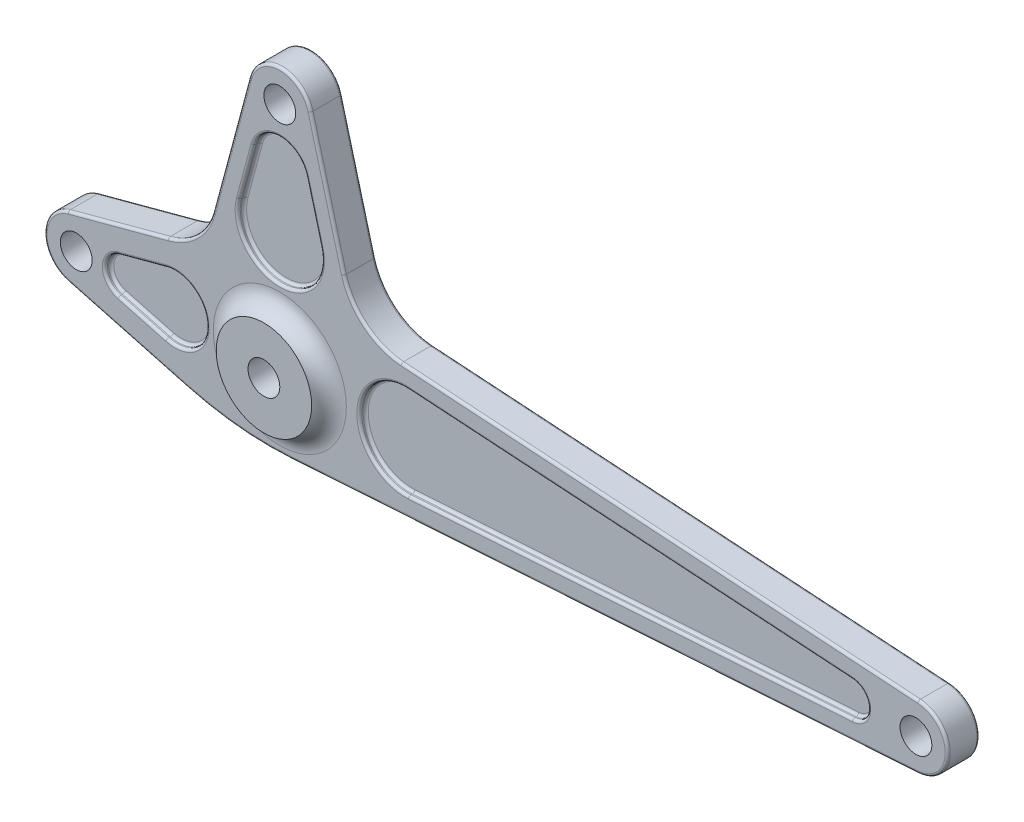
ISO-10303-21;
HEADER;
FILE_DESCRIPTION(('STEP AP214'),'2;1');
FILE_NAME('part.step','',(''),(''),'','','');
FILE_SCHEMA(('AUTOMOTIVE_DESIGN { 1 0 10303 214 1 1 1 1 }'));
ENDSEC;
DATA;
#1=APPLICATION_CONTEXT('core data for automotive mechanical design processes');
#2=APPLICATION_PROTOCOL_DEFINITION('international standard','automotive_design',2000,#1);
#3=PRODUCT_CONTEXT('',#1,'mechanical');
#4=PRODUCT('Part','Part','',(#3));
#5=PRODUCT_RELATED_PRODUCT_CATEGORY('part','',(#4));
#6=PRODUCT_DEFINITION_FORMATION('','',#4);
#7=PRODUCT_DEFINITION_CONTEXT('part definition',#1,'design');
#8=PRODUCT_DEFINITION('design','',#6,#7);
#9=PRODUCT_DEFINITION_SHAPE('','',#8);
#10=(LENGTH_UNIT() NAMED_UNIT(*) SI_UNIT(.MILLI.,.METRE.));
#11=(NAMED_UNIT(*) PLANE_ANGLE_UNIT() SI_UNIT($,.RADIAN.));
#12=(NAMED_UNIT(*) SI_UNIT($,.STERADIAN.) SOLID_ANGLE_UNIT());
#13=UNCERTAINTY_MEASURE_WITH_UNIT(LENGTH_MEASURE(1.E-05),#10,'distance_accuracy_value','');
#14=(GEOMETRIC_REPRESENTATION_CONTEXT(3) GLOBAL_UNCERTAINTY_ASSIGNED_CONTEXT((#13)) GLOBAL_UNIT_ASSIGNED_CONTEXT((#10,
#11,#12)) REPRESENTATION_CONTEXT('',''));
#15=CARTESIAN_POINT('',(0.,0.,0.));
#16=DIRECTION('',(0.,0.,1.));
#17=DIRECTION('',(1.,0.,0.));
#18=AXIS2_PLACEMENT_3D('',#15,#16,#17);
#19=CARTESIAN_POINT('',(165.956228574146,-551.807086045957,12.5));
#20=DIRECTION('',(0.,0.,1.));
#21=DIRECTION('',(1.,0.,0.));
#22=AXIS2_PLACEMENT_3D('',#19,#20,#21);
#23=PLANE('',#22);
#24=DIRECTION('',(-0.965925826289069,-0.258819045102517,0.));
#25=VECTOR('',#24,1.);
#26=CARTESIAN_POINT('',(-165.952838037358,22.2162940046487,12.5));
#27=LINE('',#26,#25);
#28=CARTESIAN_POINT('',(-87.3641343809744,43.2740736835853,12.5));
#29=VERTEX_POINT('',#28);
#30=CARTESIAN_POINT('',(-165.952838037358,22.2162940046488,12.5));
#31=VERTEX_POINT('',#30);
#32=EDGE_CURVE('E53',#29,#31,#27,.T.);
#33=ORIENTED_EDGE('',*,*,#32,.T.);
#34=CARTESIAN_POINT('',(-160.,0.,12.5));
#35=DIRECTION('',(0.,0.,1.));
#36=DIRECTION('',(1.,0.,0.));
#37=AXIS2_PLACEMENT_3D('',#34,#35,#36);
#38=CIRCLE('',#37,23.);
#39=CARTESIAN_POINT('',(-165.952838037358,-22.2162940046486,12.5));
#40=VERTEX_POINT('',#39);
#41=EDGE_CURVE('E695',#31,#40,#38,.T.);
#42=ORIENTED_EDGE('',*,*,#41,.T.);
#43=DIRECTION('',(0.965925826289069,-0.258819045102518,0.));
#44=VECTOR('',#43,1.);
#45=CARTESIAN_POINT('',(-72.1206553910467,-47.358551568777,12.5));
#46=LINE('',#45,#44);
#47=CARTESIAN_POINT('',(-72.1206553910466,-47.358551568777,12.5));
#48=VERTEX_POINT('',#47);
#49=EDGE_CURVE('E675',#40,#48,#46,.T.);
#50=ORIENTED_EDGE('',*,*,#49,.T.);
#51=CARTESIAN_POINT('',(-7.93353220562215,192.191053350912,12.5));
#52=DIRECTION('',(0.,0.,1.));
#53=DIRECTION('',(1.,0.,0.));
#54=AXIS2_PLACEMENT_3D('',#51,#52,#53);
#55=CIRCLE('',#54,248.);
#56=CARTESIAN_POINT('',(8.28644384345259,-55.2779596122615,12.5));
#57=VERTEX_POINT('',#56);
#58=EDGE_CURVE('E677',#48,#57,#55,.T.);
#59=ORIENTED_EDGE('',*,*,#58,.T.);
#60=DIRECTION('',(-0.997858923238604,-0.0654031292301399,0.));
#61=VECTOR('',#60,1.);
#62=CARTESIAN_POINT('',(132.876757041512,-47.1118790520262,12.5));
#63=LINE('',#62,#61);
#64=CARTESIAN_POINT('',(501.504271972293,-22.9507552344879,12.5));
#65=VERTEX_POINT('',#64);
#66=EDGE_CURVE('E679',#57,#65,#63,.F.);
#67=ORIENTED_EDGE('',*,*,#66,.T.);
#68=CARTESIAN_POINT('',(500.,0.,12.5));
#69=DIRECTION('',(0.,0.,1.));
#70=DIRECTION('',(1.,0.,0.));
#71=AXIS2_PLACEMENT_3D('',#68,#69,#70);
#72=CIRCLE('',#71,23.);
#73=CARTESIAN_POINT('',(501.504271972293,22.9507552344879,12.5));
#74=VERTEX_POINT('',#73);
#75=EDGE_CURVE('E681',#65,#74,#72,.T.);
#76=ORIENTED_EDGE('',*,*,#75,.T.);
#77=DIRECTION('',(0.997858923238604,-0.0654031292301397,0.));
#78=VECTOR('',#77,1.);
#79=CARTESIAN_POINT('',(204.902034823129,42.3910929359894,12.5));
#80=LINE('',#79,#78);
#81=CARTESIAN_POINT('',(95.2883503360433,49.5755533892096,12.5));
#82=VERTEX_POINT('',#81);
#83=EDGE_CURVE('E683',#74,#82,#80,.F.);
#84=ORIENTED_EDGE('',*,*,#83,.T.);
#85=CARTESIAN_POINT('',(98.6893130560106,101.464217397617,12.5));
#86=DIRECTION('',(0.,0.,1.));
#87=DIRECTION('',(1.,0.,0.));
#88=AXIS2_PLACEMENT_3D('',#85,#86,#87);
#89=CIRCLE('',#88,52.0000000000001);
#90=CARTESIAN_POINT('',(48.4611700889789,88.0056270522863,12.5));
#91=VERTEX_POINT('',#90);
#92=EDGE_CURVE('E685',#82,#91,#89,.F.);
#93=ORIENTED_EDGE('',*,*,#92,.T.);
#94=DIRECTION('',(-0.258819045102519,0.965925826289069,0.));
#95=VECTOR('',#94,1.);
#96=CARTESIAN_POINT('',(22.2162940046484,185.952838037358,12.5));
#97=LINE('',#96,#95);
#98=CARTESIAN_POINT('',(22.2162940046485,185.952838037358,12.5));
#99=VERTEX_POINT('',#98);
#100=EDGE_CURVE('E687',#91,#99,#97,.T.);
#101=ORIENTED_EDGE('',*,*,#100,.T.);
#102=CARTESIAN_POINT('',(1.11022302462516E-13,180.,12.5));
#103=DIRECTION('',(0.,0.,1.));
#104=DIRECTION('',(1.,0.,0.));
#105=AXIS2_PLACEMENT_3D('',#102,#103,#104);
#106=CIRCLE('',#105,22.9999999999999);
#107=CARTESIAN_POINT('',(-22.2162940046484,185.952838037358,12.5));
#108=VERTEX_POINT('',#107);
#109=EDGE_CURVE('E689',#99,#108,#106,.T.);
#110=ORIENTED_EDGE('',*,*,#109,.T.);
#111=DIRECTION('',(-0.258819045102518,-0.965925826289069,0.));
#112=VECTOR('',#111,1.);
#113=CARTESIAN_POINT('',(-50.5945817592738,80.0436263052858,12.5));
#114=LINE('',#113,#112);
#115=CARTESIAN_POINT('',(-50.5945817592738,80.0436263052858,12.5));
#116=VERTEX_POINT('',#115);
#117=EDGE_CURVE('E691',#108,#116,#114,.T.);
#118=ORIENTED_EDGE('',*,*,#117,.T.);
#119=CARTESIAN_POINT('',(-100.822724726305,93.5022166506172,12.5));
#120=DIRECTION('',(0.,0.,1.));
#121=DIRECTION('',(1.,0.,0.));
#122=AXIS2_PLACEMENT_3D('',#119,#120,#121);
#123=CIRCLE('',#122,52.0000000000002);
#124=EDGE_CURVE('E58',#116,#29,#123,.F.);
#125=ORIENTED_EDGE('',*,*,#124,.T.);
#126=EDGE_LOOP('',(#33,#42,#50,#59,#67,#76,#84,#93,#101,#110,#118,#125));
#127=FACE_BOUND('',#126,.T.);
#128=CARTESIAN_POINT('',(0.,0.,12.5));
#129=DIRECTION('',(0.,0.,1.));
#130=DIRECTION('',(1.,0.,0.));
#131=AXIS2_PLACEMENT_3D('',#128,#129,#130);
#132=CIRCLE('',#131,52.290199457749);
#133=CARTESIAN_POINT('',(52.290199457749,0.,12.5));
#134=VERTEX_POINT('',#133);
#135=EDGE_CURVE('E600',#134,#134,#132,.F.);
#136=ORIENTED_EDGE('',*,*,#135,.T.);
#137=EDGE_LOOP('',(#136));
#138=FACE_BOUND('',#137,.T.);
#139=DIRECTION('',(-0.965925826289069,0.258819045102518,0.));
#140=VECTOR('',#139,1.);
#141=CARTESIAN_POINT('',(280.261339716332,-125.214603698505,12.5));
#142=LINE('',#141,#140);
#143=CARTESIAN_POINT('',(-89.5465902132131,-26.1248675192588,12.5));
#144=VERTEX_POINT('',#143);
#145=CARTESIAN_POINT('',(-127.194209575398,-16.037218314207,12.5));
#146=VERTEX_POINT('',#145);
#147=EDGE_CURVE('E1000',#144,#146,#142,.T.);
#148=ORIENTED_EDGE('',*,*,#147,.T.);
#149=CARTESIAN_POINT('',(-122.897049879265,0.,12.5));
#150=DIRECTION('',(0.,0.,1.));
#151=DIRECTION('',(1.,0.,0.));
#152=AXIS2_PLACEMENT_3D('',#149,#150,#151);
#153=CIRCLE('',#152,16.602950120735);
#154=CARTESIAN_POINT('',(-127.194209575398,16.0372183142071,12.5));
#155=VERTEX_POINT('',#154);
#156=EDGE_CURVE('E601',#146,#155,#153,.F.);
#157=ORIENTED_EDGE('',*,*,#156,.T.);
#158=DIRECTION('',(-0.965925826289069,-0.258819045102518,0.));
#159=VECTOR('',#158,1.);
#160=CARTESIAN_POINT('',(-89.5465902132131,26.1248675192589,12.5));
#161=LINE('',#160,#159);
#162=CARTESIAN_POINT('',(-89.5465902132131,26.1248675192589,12.5));
#163=VERTEX_POINT('',#162);
#164=EDGE_CURVE('E1004',#155,#163,#161,.F.);
#165=ORIENTED_EDGE('',*,*,#164,.T.);
#166=CARTESIAN_POINT('',(-82.5464530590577,0.,12.5));
#167=DIRECTION('',(0.,0.,1.));
#168=DIRECTION('',(1.,0.,0.));
#169=AXIS2_PLACEMENT_3D('',#166,#167,#168);
#170=CIRCLE('',#169,27.0464530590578);
#171=EDGE_CURVE('E1002',#163,#144,#170,.F.);
#172=ORIENTED_EDGE('',*,*,#171,.T.);
#173=EDGE_LOOP('',(#148,#157,#165,#172));
#174=FACE_BOUND('',#173,.T.);
#175=DIRECTION('',(0.258819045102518,0.965925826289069,0.));
#176=VECTOR('',#175,1.);
#177=CARTESIAN_POINT('',(-183.425922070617,-458.190420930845,12.5));
#178=LINE('',#177,#176);
#179=CARTESIAN_POINT('',(-33.9334792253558,99.7229711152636,12.5));
#180=VERTEX_POINT('',#179);
#181=CARTESIAN_POINT('',(-22.5533451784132,142.194209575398,12.5));
#182=VERTEX_POINT('',#181);
#183=EDGE_CURVE('E991',#180,#182,#178,.T.);
#184=ORIENTED_EDGE('',*,*,#183,.T.);
#185=CARTESIAN_POINT('',(0.,136.151058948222,12.5));
#186=DIRECTION('',(0.,0.,1.));
#187=DIRECTION('',(1.,0.,0.));
#188=AXIS2_PLACEMENT_3D('',#185,#186,#187);
#189=CIRCLE('',#188,23.3489410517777);
#190=CARTESIAN_POINT('',(22.5533451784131,142.194209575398,12.5));
#191=VERTEX_POINT('',#190);
#192=EDGE_CURVE('E997',#182,#191,#189,.F.);
#193=ORIENTED_EDGE('',*,*,#192,.T.);
#194=DIRECTION('',(-0.258819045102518,0.965925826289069,0.));
#195=VECTOR('',#194,1.);
#196=CARTESIAN_POINT('',(33.9334792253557,99.7229711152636,12.5));
#197=LINE('',#196,#195);
#198=CARTESIAN_POINT('',(33.9334792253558,99.7229711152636,12.5));
#199=VERTEX_POINT('',#198);
#200=EDGE_CURVE('E995',#191,#199,#197,.F.);
#201=ORIENTED_EDGE('',*,*,#200,.T.);
#202=CARTESIAN_POINT('',(0.,90.6305227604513,12.5));
#203=DIRECTION('',(0.,0.,1.));
#204=DIRECTION('',(1.,0.,0.));
#205=AXIS2_PLACEMENT_3D('',#202,#203,#204);
#206=CIRCLE('',#205,35.1305227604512);
#207=EDGE_CURVE('E993',#199,#180,#206,.F.);
#208=ORIENTED_EDGE('',*,*,#207,.T.);
#209=EDGE_LOOP('',(#184,#193,#201,#208));
#210=FACE_BOUND('',#209,.T.);
#211=CARTESIAN_POINT('',(98.7434349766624,0.,12.5));
#212=DIRECTION('',(0.,0.,1.));
#213=DIRECTION('',(1.,0.,0.));
#214=AXIS2_PLACEMENT_3D('',#211,#212,#213);
#215=CIRCLE('',#214,38.2434349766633);
#216=CARTESIAN_POINT('',(101.244675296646,-38.1615528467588,12.5));
#217=VERTEX_POINT('',#216);
#218=CARTESIAN_POINT('',(101.244675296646,38.1615528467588,12.5));
#219=VERTEX_POINT('',#218);
#220=EDGE_CURVE('E982',#217,#219,#215,.F.);
#221=ORIENTED_EDGE('',*,*,#220,.T.);
#222=DIRECTION('',(-0.997858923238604,0.0654031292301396,0.));
#223=VECTOR('',#222,1.);
#224=CARTESIAN_POINT('',(450.178188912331,15.2912420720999,12.5));
#225=LINE('',#224,#223);
#226=CARTESIAN_POINT('',(450.178188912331,15.2912420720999,12.5));
#227=VERTEX_POINT('',#226);
#228=EDGE_CURVE('E988',#219,#227,#225,.F.);
#229=ORIENTED_EDGE('',*,*,#228,.T.);
#230=CARTESIAN_POINT('',(449.17594795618,0.,12.5));
#231=DIRECTION('',(0.,0.,1.));
#232=DIRECTION('',(1.,0.,0.));
#233=AXIS2_PLACEMENT_3D('',#230,#231,#232);
#234=CIRCLE('',#233,15.3240520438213);
#235=CARTESIAN_POINT('',(450.178188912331,-15.2912420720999,12.5));
#236=VERTEX_POINT('',#235);
#237=EDGE_CURVE('E986',#227,#236,#234,.F.);
#238=ORIENTED_EDGE('',*,*,#237,.T.);
#239=DIRECTION('',(-0.997858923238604,-0.0654031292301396,0.));
#240=VECTOR('',#239,1.);
#241=CARTESIAN_POINT('',(132.15732261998,-36.1354308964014,12.5));
#242=LINE('',#241,#240);
#243=EDGE_CURVE('E984',#236,#217,#242,.T.);
#244=ORIENTED_EDGE('',*,*,#243,.T.);
#245=EDGE_LOOP('',(#221,#229,#238,#244));
#246=FACE_BOUND('',#245,.T.);
#247=CARTESIAN_POINT('',(1.11022302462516E-13,180.,12.5));
#248=DIRECTION('',(0.,0.,1.));
#249=DIRECTION('',(1.,0.,0.));
#250=AXIS2_PLACEMENT_3D('',#247,#248,#249);
#251=CIRCLE('',#250,12.4999999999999);
#252=CARTESIAN_POINT('',(12.5,180.,12.5));
#253=VERTEX_POINT('',#252);
#254=EDGE_CURVE('E1151',#253,#253,#251,.T.);
#255=ORIENTED_EDGE('',*,*,#254,.F.);
#256=EDGE_LOOP('',(#255));
#257=FACE_BOUND('',#256,.T.);
#258=CARTESIAN_POINT('',(-160.,0.,12.5));
#259=DIRECTION('',(0.,0.,1.));
#260=DIRECTION('',(1.,0.,0.));
#261=AXIS2_PLACEMENT_3D('',#258,#259,#260);
#262=CIRCLE('',#261,12.4999999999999);
#263=CARTESIAN_POINT('',(-147.5,0.,12.5));
#264=VERTEX_POINT('',#263);
#265=EDGE_CURVE('E1154',#264,#264,#262,.T.);
#266=ORIENTED_EDGE('',*,*,#265,.F.);
#267=EDGE_LOOP('',(#266));
#268=FACE_BOUND('',#267,.T.);
#269=CARTESIAN_POINT('',(500.,0.,12.5));
#270=DIRECTION('',(0.,0.,1.));
#271=DIRECTION('',(1.,0.,0.));
#272=AXIS2_PLACEMENT_3D('',#269,#270,#271);
#273=CIRCLE('',#272,12.5);
#274=CARTESIAN_POINT('',(512.5,0.,12.5));
#275=VERTEX_POINT('',#274);
#276=EDGE_CURVE('E1158',#275,#275,#273,.T.);
#277=ORIENTED_EDGE('',*,*,#276,.F.);
#278=EDGE_LOOP('',(#277));
#279=FACE_BOUND('',#278,.T.);
#280=ADVANCED_FACE('F36',(#127,#138,#174,#210,#246,#257,#268,#279),#23,.T.);
#281=CARTESIAN_POINT('',(165.956228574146,-551.807086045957,-12.5));
#282=DIRECTION('',(0.,0.,1.));
#283=DIRECTION('',(1.,0.,0.));
#284=AXIS2_PLACEMENT_3D('',#281,#282,#283);
#285=PLANE('',#284);
#286=DIRECTION('',(0.965925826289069,-0.258819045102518,0.));
#287=VECTOR('',#286,1.);
#288=CARTESIAN_POINT('',(276.120234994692,-140.66941691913,-12.5));
#289=LINE('',#288,#287);
#290=CARTESIAN_POINT('',(-72.1206553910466,-47.3585515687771,-12.5));
#291=VERTEX_POINT('',#290);
#292=CARTESIAN_POINT('',(-165.952838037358,-22.2162940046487,-12.5));
#293=VERTEX_POINT('',#292);
#294=EDGE_CURVE('E610',#291,#293,#289,.F.);
#295=ORIENTED_EDGE('',*,*,#294,.T.);
#296=CARTESIAN_POINT('',(-160.,0.,-12.5));
#297=DIRECTION('',(0.,0.,1.));
#298=DIRECTION('',(1.,0.,0.));
#299=AXIS2_PLACEMENT_3D('',#296,#297,#298);
#300=CIRCLE('',#299,23.);
#301=CARTESIAN_POINT('',(-165.952838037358,22.2162940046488,-12.5));
#302=VERTEX_POINT('',#301);
#303=EDGE_CURVE('E632',#293,#302,#300,.F.);
#304=ORIENTED_EDGE('',*,*,#303,.T.);
#305=DIRECTION('',(-0.965925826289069,-0.258819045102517,0.));
#306=VECTOR('',#305,1.);
#307=CARTESIAN_POINT('',(0.216691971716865,66.741285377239,-12.5));
#308=LINE('',#307,#306);
#309=CARTESIAN_POINT('',(-87.3641343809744,43.2740736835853,-12.5));
#310=VERTEX_POINT('',#309);
#311=EDGE_CURVE('E630',#302,#310,#308,.F.);
#312=ORIENTED_EDGE('',*,*,#311,.T.);
#313=CARTESIAN_POINT('',(-100.822724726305,93.5022166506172,-12.5));
#314=DIRECTION('',(0.,0.,1.));
#315=DIRECTION('',(1.,0.,0.));
#316=AXIS2_PLACEMENT_3D('',#313,#314,#315);
#317=CIRCLE('',#316,52.0000000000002);
#318=CARTESIAN_POINT('',(-50.5945817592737,80.0436263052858,-12.5));
#319=VERTEX_POINT('',#318);
#320=EDGE_CURVE('E628',#310,#319,#317,.T.);
#321=ORIENTED_EDGE('',*,*,#320,.T.);
#322=DIRECTION('',(-0.258819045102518,-0.965925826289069,0.));
#323=VECTOR('',#322,1.);
#324=CARTESIAN_POINT('',(-194.051106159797,-455.343411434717,-12.5));
#325=LINE('',#324,#323);
#326=CARTESIAN_POINT('',(-22.2162940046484,185.952838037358,-12.5));
#327=VERTEX_POINT('',#326);
#328=EDGE_CURVE('E626',#319,#327,#325,.F.);
#329=ORIENTED_EDGE('',*,*,#328,.T.);
#330=CARTESIAN_POINT('',(1.11022302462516E-13,180.,-12.5));
#331=DIRECTION('',(0.,0.,1.));
#332=DIRECTION('',(1.,0.,0.));
#333=AXIS2_PLACEMENT_3D('',#330,#331,#332);
#334=CIRCLE('',#333,22.9999999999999);
#335=CARTESIAN_POINT('',(22.2162940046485,185.952838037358,-12.5));
#336=VERTEX_POINT('',#335);
#337=EDGE_CURVE('E624',#327,#336,#334,.F.);
#338=ORIENTED_EDGE('',*,*,#337,.T.);
#339=DIRECTION('',(-0.258819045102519,0.965925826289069,0.));
#340=VECTOR('',#339,1.);
#341=CARTESIAN_POINT('',(216.285024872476,-538.321525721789,-12.5));
#342=LINE('',#341,#340);
#343=CARTESIAN_POINT('',(48.4611700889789,88.0056270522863,-12.5));
#344=VERTEX_POINT('',#343);
#345=EDGE_CURVE('E622',#336,#344,#342,.F.);
#346=ORIENTED_EDGE('',*,*,#345,.T.);
#347=CARTESIAN_POINT('',(98.6893130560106,101.464217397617,-12.5));
#348=DIRECTION('',(0.,0.,1.));
#349=DIRECTION('',(1.,0.,0.));
#350=AXIS2_PLACEMENT_3D('',#347,#348,#349);
#351=CIRCLE('',#350,52.0000000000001);
#352=CARTESIAN_POINT('',(95.2883503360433,49.5755533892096,-12.5));
#353=VERTEX_POINT('',#352);
#354=EDGE_CURVE('E620',#344,#353,#351,.T.);
#355=ORIENTED_EDGE('',*,*,#354,.T.);
#356=DIRECTION('',(0.997858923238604,-0.0654031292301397,0.));
#357=VECTOR('',#356,1.);
#358=CARTESIAN_POINT('',(501.504271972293,22.9507552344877,-12.5));
#359=LINE('',#358,#357);
#360=CARTESIAN_POINT('',(501.504271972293,22.9507552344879,-12.5));
#361=VERTEX_POINT('',#360);
#362=EDGE_CURVE('E618',#353,#361,#359,.T.);
#363=ORIENTED_EDGE('',*,*,#362,.T.);
#364=CARTESIAN_POINT('',(500.,0.,-12.5));
#365=DIRECTION('',(0.,0.,1.));
#366=DIRECTION('',(1.,0.,0.));
#367=AXIS2_PLACEMENT_3D('',#364,#365,#366);
#368=CIRCLE('',#367,23.);
#369=CARTESIAN_POINT('',(501.504271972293,-22.9507552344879,-12.5));
#370=VERTEX_POINT('',#369);
#371=EDGE_CURVE('E616',#361,#370,#368,.F.);
#372=ORIENTED_EDGE('',*,*,#371,.T.);
#373=DIRECTION('',(-0.997858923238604,-0.0654031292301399,0.));
#374=VECTOR('',#373,1.);
#375=CARTESIAN_POINT('',(8.28644384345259,-55.2779596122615,-12.5));
#376=LINE('',#375,#374);
#377=CARTESIAN_POINT('',(8.28644384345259,-55.2779596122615,-12.5));
#378=VERTEX_POINT('',#377);
#379=EDGE_CURVE('E614',#370,#378,#376,.T.);
#380=ORIENTED_EDGE('',*,*,#379,.T.);
#381=CARTESIAN_POINT('',(-7.93353220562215,192.191053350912,-12.5));
#382=DIRECTION('',(0.,0.,1.));
#383=DIRECTION('',(1.,0.,0.));
#384=AXIS2_PLACEMENT_3D('',#381,#382,#383);
#385=CIRCLE('',#384,248.);
#386=EDGE_CURVE('E612',#378,#291,#385,.F.);
#387=ORIENTED_EDGE('',*,*,#386,.T.);
#388=EDGE_LOOP('',(#295,#304,#312,#321,#329,#338,#346,#355,#363,#372,#380,#387));
#389=FACE_BOUND('',#388,.T.);
#390=CARTESIAN_POINT('',(0.,0.,-12.5));
#391=DIRECTION('',(0.,0.,1.));
#392=DIRECTION('',(1.,0.,0.));
#393=AXIS2_PLACEMENT_3D('',#390,#391,#392);
#394=CIRCLE('',#393,52.290199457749);
#395=CARTESIAN_POINT('',(52.290199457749,0.,-12.5));
#396=VERTEX_POINT('',#395);
#397=EDGE_CURVE('E597',#396,#396,#394,.T.);
#398=ORIENTED_EDGE('',*,*,#397,.T.);
#399=EDGE_LOOP('',(#398));
#400=FACE_BOUND('',#399,.T.);
#401=DIRECTION('',(0.965925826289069,-0.258819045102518,0.));
#402=VECTOR('',#401,1.);
#403=CARTESIAN_POINT('',(280.261339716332,-125.214603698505,-12.5));
#404=LINE('',#403,#402);
#405=CARTESIAN_POINT('',(-127.194209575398,-16.037218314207,-12.5));
#406=VERTEX_POINT('',#405);
#407=CARTESIAN_POINT('',(-89.5465902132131,-26.1248675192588,-12.5));
#408=VERTEX_POINT('',#407);
#409=EDGE_CURVE('E892',#406,#408,#404,.T.);
#410=ORIENTED_EDGE('',*,*,#409,.T.);
#411=CARTESIAN_POINT('',(-82.5464530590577,0.,-12.5));
#412=DIRECTION('',(0.,0.,1.));
#413=DIRECTION('',(1.,0.,0.));
#414=AXIS2_PLACEMENT_3D('',#411,#412,#413);
#415=CIRCLE('',#414,27.0464530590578);
#416=CARTESIAN_POINT('',(-89.5465902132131,26.1248675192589,-12.5));
#417=VERTEX_POINT('',#416);
#418=EDGE_CURVE('E898',#408,#417,#415,.T.);
#419=ORIENTED_EDGE('',*,*,#418,.T.);
#420=DIRECTION('',(0.965925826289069,0.258819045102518,0.));
#421=VECTOR('',#420,1.);
#422=CARTESIAN_POINT('',(-127.194209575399,16.0372183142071,-12.5));
#423=LINE('',#422,#421);
#424=CARTESIAN_POINT('',(-127.194209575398,16.0372183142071,-12.5));
#425=VERTEX_POINT('',#424);
#426=EDGE_CURVE('E896',#417,#425,#423,.F.);
#427=ORIENTED_EDGE('',*,*,#426,.T.);
#428=CARTESIAN_POINT('',(-122.897049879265,0.,-12.5));
#429=DIRECTION('',(0.,0.,1.));
#430=DIRECTION('',(1.,0.,0.));
#431=AXIS2_PLACEMENT_3D('',#428,#429,#430);
#432=CIRCLE('',#431,16.602950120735);
#433=EDGE_CURVE('E894',#425,#406,#432,.T.);
#434=ORIENTED_EDGE('',*,*,#433,.T.);
#435=EDGE_LOOP('',(#410,#419,#427,#434));
#436=FACE_BOUND('',#435,.T.);
#437=DIRECTION('',(-0.258819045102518,-0.965925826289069,0.));
#438=VECTOR('',#437,1.);
#439=CARTESIAN_POINT('',(-183.425922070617,-458.190420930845,-12.5));
#440=LINE('',#439,#438);
#441=CARTESIAN_POINT('',(-22.5533451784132,142.194209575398,-12.5));
#442=VERTEX_POINT('',#441);
#443=CARTESIAN_POINT('',(-33.9334792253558,99.7229711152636,-12.5));
#444=VERTEX_POINT('',#443);
#445=EDGE_CURVE('E883',#442,#444,#440,.T.);
#446=ORIENTED_EDGE('',*,*,#445,.T.);
#447=CARTESIAN_POINT('',(0.,90.6305227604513,-12.5));
#448=DIRECTION('',(0.,0.,1.));
#449=DIRECTION('',(1.,0.,0.));
#450=AXIS2_PLACEMENT_3D('',#447,#448,#449);
#451=CIRCLE('',#450,35.1305227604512);
#452=CARTESIAN_POINT('',(33.9334792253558,99.7229711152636,-12.5));
#453=VERTEX_POINT('',#452);
#454=EDGE_CURVE('E889',#444,#453,#451,.T.);
#455=ORIENTED_EDGE('',*,*,#454,.T.);
#456=DIRECTION('',(0.258819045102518,-0.965925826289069,0.));
#457=VECTOR('',#456,1.);
#458=CARTESIAN_POINT('',(22.5533451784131,142.194209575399,-12.5));
#459=LINE('',#458,#457);
#460=CARTESIAN_POINT('',(22.5533451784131,142.194209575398,-12.5));
#461=VERTEX_POINT('',#460);
#462=EDGE_CURVE('E887',#453,#461,#459,.F.);
#463=ORIENTED_EDGE('',*,*,#462,.T.);
#464=CARTESIAN_POINT('',(0.,136.151058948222,-12.5));
#465=DIRECTION('',(0.,0.,1.));
#466=DIRECTION('',(1.,0.,0.));
#467=AXIS2_PLACEMENT_3D('',#464,#465,#466);
#468=CIRCLE('',#467,23.3489410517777);
#469=EDGE_CURVE('E885',#461,#442,#468,.T.);
#470=ORIENTED_EDGE('',*,*,#469,.T.);
#471=EDGE_LOOP('',(#446,#455,#463,#470));
#472=FACE_BOUND('',#471,.T.);
#473=DIRECTION('',(0.997858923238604,0.0654031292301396,0.));
#474=VECTOR('',#473,1.);
#475=CARTESIAN_POINT('',(132.15732261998,-36.1354308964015,-12.5));
#476=LINE('',#475,#474);
#477=CARTESIAN_POINT('',(101.244675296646,-38.1615528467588,-12.5));
#478=VERTEX_POINT('',#477);
#479=CARTESIAN_POINT('',(450.178188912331,-15.2912420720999,-12.5));
#480=VERTEX_POINT('',#479);
#481=EDGE_CURVE('E526',#478,#480,#476,.T.);
#482=ORIENTED_EDGE('',*,*,#481,.T.);
#483=CARTESIAN_POINT('',(449.17594795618,0.,-12.5));
#484=DIRECTION('',(0.,0.,1.));
#485=DIRECTION('',(1.,0.,0.));
#486=AXIS2_PLACEMENT_3D('',#483,#484,#485);
#487=CIRCLE('',#486,15.3240520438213);
#488=CARTESIAN_POINT('',(450.178188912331,15.2912420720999,-12.5));
#489=VERTEX_POINT('',#488);
#490=EDGE_CURVE('E880',#480,#489,#487,.T.);
#491=ORIENTED_EDGE('',*,*,#490,.T.);
#492=DIRECTION('',(0.997858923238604,-0.0654031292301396,0.));
#493=VECTOR('',#492,1.);
#494=CARTESIAN_POINT('',(101.244675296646,38.1615528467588,-12.5));
#495=LINE('',#494,#493);
#496=CARTESIAN_POINT('',(101.244675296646,38.1615528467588,-12.5));
#497=VERTEX_POINT('',#496);
#498=EDGE_CURVE('E878',#489,#497,#495,.F.);
#499=ORIENTED_EDGE('',*,*,#498,.T.);
#500=CARTESIAN_POINT('',(98.7434349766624,0.,-12.5));
#501=DIRECTION('',(0.,0.,1.));
#502=DIRECTION('',(1.,0.,0.));
#503=AXIS2_PLACEMENT_3D('',#500,#501,#502);
#504=CIRCLE('',#503,38.2434349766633);
#505=EDGE_CURVE('E875',#497,#478,#504,.T.);
#506=ORIENTED_EDGE('',*,*,#505,.T.);
#507=EDGE_LOOP('',(#482,#491,#499,#506));
#508=FACE_BOUND('',#507,.T.);
#509=CARTESIAN_POINT('',(500.,0.,-12.5));
#510=DIRECTION('',(0.,0.,1.));
#511=DIRECTION('',(1.,0.,0.));
#512=AXIS2_PLACEMENT_3D('',#509,#510,#511);
#513=CIRCLE('',#512,12.5);
#514=CARTESIAN_POINT('',(512.5,0.,-12.5));
#515=VERTEX_POINT('',#514);
#516=EDGE_CURVE('E1155',#515,#515,#513,.T.);
#517=ORIENTED_EDGE('',*,*,#516,.T.);
#518=EDGE_LOOP('',(#517));
#519=FACE_BOUND('',#518,.T.);
#520=CARTESIAN_POINT('',(-160.,0.,-12.5));
#521=DIRECTION('',(0.,0.,1.));
#522=DIRECTION('',(1.,0.,0.));
#523=AXIS2_PLACEMENT_3D('',#520,#521,#522);
#524=CIRCLE('',#523,12.4999999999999);
#525=CARTESIAN_POINT('',(-147.5,0.,-12.5));
#526=VERTEX_POINT('',#525);
#527=EDGE_CURVE('E1164',#526,#526,#524,.T.);
#528=ORIENTED_EDGE('',*,*,#527,.T.);
#529=EDGE_LOOP('',(#528));
#530=FACE_BOUND('',#529,.T.);
#531=CARTESIAN_POINT('',(1.11022302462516E-13,180.,-12.5));
#532=DIRECTION('',(0.,0.,1.));
#533=DIRECTION('',(1.,0.,0.));
#534=AXIS2_PLACEMENT_3D('',#531,#532,#533);
#535=CIRCLE('',#534,12.4999999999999);
#536=CARTESIAN_POINT('',(12.5,180.,-12.5));
#537=VERTEX_POINT('',#536);
#538=EDGE_CURVE('E1146',#537,#537,#535,.T.);
#539=ORIENTED_EDGE('',*,*,#538,.T.);
#540=EDGE_LOOP('',(#539));
#541=FACE_BOUND('',#540,.T.);
#542=ADVANCED_FACE('F1062',(#389,#400,#436,#472,#508,#519,#530,#541),#285,.F.);
#543=CARTESIAN_POINT('',(275.602596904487,-142.601268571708,12.5));
#544=DIRECTION('',(0.258819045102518,0.965925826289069,0.));
#545=DIRECTION('',(-0.965925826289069,0.258819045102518,0.));
#546=AXIS2_PLACEMENT_3D('',#543,#544,#545);
#547=PLANE('',#546);
#548=DIRECTION('',(0.,0.,-1.));
#549=VECTOR('',#548,1.);
#550=CARTESIAN_POINT('',(-166.470476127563,-24.1481456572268,12.5));
#551=LINE('',#550,#549);
#552=CARTESIAN_POINT('',(-166.470476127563,-24.1481456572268,10.5));
#553=VERTEX_POINT('',#552);
#554=CARTESIAN_POINT('',(-166.470476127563,-24.1481456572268,-10.5));
#555=VERTEX_POINT('',#554);
#556=EDGE_CURVE('E1161',#553,#555,#551,.T.);
#557=ORIENTED_EDGE('',*,*,#556,.T.);
#558=DIRECTION('',(0.965925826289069,-0.258819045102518,0.));
#559=VECTOR('',#558,1.);
#560=CARTESIAN_POINT('',(275.602596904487,-142.601268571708,-10.5));
#561=LINE('',#560,#559);
#562=CARTESIAN_POINT('',(-72.6382934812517,-49.2904032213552,-10.5));
#563=VERTEX_POINT('',#562);
#564=EDGE_CURVE('E11',#555,#563,#561,.T.);
#565=ORIENTED_EDGE('',*,*,#564,.T.);
#566=DIRECTION('',(0.,0.,-1.));
#567=VECTOR('',#566,1.);
#568=CARTESIAN_POINT('',(-72.6382934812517,-49.2904032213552,12.5));
#569=LINE('',#568,#567);
#570=CARTESIAN_POINT('',(-72.6382934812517,-49.2904032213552,10.5));
#571=VERTEX_POINT('',#570);
#572=EDGE_CURVE('E500',#571,#563,#569,.T.);
#573=ORIENTED_EDGE('',*,*,#572,.F.);
#574=DIRECTION('',(0.965925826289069,-0.258819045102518,0.));
#575=VECTOR('',#574,1.);
#576=CARTESIAN_POINT('',(-166.470476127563,-24.1481456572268,10.5));
#577=LINE('',#576,#575);
#578=EDGE_CURVE('E45',#571,#553,#577,.F.);
#579=ORIENTED_EDGE('',*,*,#578,.T.);
#580=EDGE_LOOP('',(#557,#565,#573,#579));
#581=FACE_BOUND('',#580,.T.);
#582=ADVANCED_FACE('F1239',(#581),#547,.F.);
#583=CARTESIAN_POINT('',(-7.93353220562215,192.191053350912,12.5));
#584=DIRECTION('',(0.,0.,-1.));
#585=DIRECTION('',(-1.,0.,0.));
#586=AXIS2_PLACEMENT_3D('',#583,#584,#585);
#587=CYLINDRICAL_SURFACE('',#586,250.);
#588=ORIENTED_EDGE('',*,*,#572,.T.);
#589=CARTESIAN_POINT('',(-7.93353220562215,192.191053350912,-10.5));
#590=DIRECTION('',(0.,0.,1.));
#591=DIRECTION('',(1.,0.,0.));
#592=AXIS2_PLACEMENT_3D('',#589,#590,#591);
#593=CIRCLE('',#592,250.);
#594=CARTESIAN_POINT('',(8.41725010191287,-57.2736774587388,-10.5));
#595=VERTEX_POINT('',#594);
#596=EDGE_CURVE('E673',#563,#595,#593,.T.);
#597=ORIENTED_EDGE('',*,*,#596,.T.);
#598=DIRECTION('',(0.,0.,-1.));
#599=VECTOR('',#598,1.);
#600=CARTESIAN_POINT('',(8.41725010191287,-57.2736774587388,12.5));
#601=LINE('',#600,#599);
#602=CARTESIAN_POINT('',(8.41725010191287,-57.2736774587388,10.5));
#603=VERTEX_POINT('',#602);
#604=EDGE_CURVE('E798',#603,#595,#601,.T.);
#605=ORIENTED_EDGE('',*,*,#604,.F.);
#606=CARTESIAN_POINT('',(-7.93353220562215,192.191053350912,10.5));
#607=DIRECTION('',(0.,0.,1.));
#608=DIRECTION('',(1.,0.,0.));
#609=AXIS2_PLACEMENT_3D('',#606,#607,#608);
#610=CIRCLE('',#609,250.);
#611=EDGE_CURVE('E671',#603,#571,#610,.F.);
#612=ORIENTED_EDGE('',*,*,#611,.T.);
#613=EDGE_LOOP('',(#588,#597,#605,#612));
#614=FACE_BOUND('',#613,.T.);
#615=ADVANCED_FACE('F1257',(#614),#587,.T.);
#616=CARTESIAN_POINT('',(133.007563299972,-49.1075968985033,12.5));
#617=DIRECTION('',(0.0654031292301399,-0.997858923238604,0.));
#618=DIRECTION('',(0.997858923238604,0.0654031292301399,0.));
#619=AXIS2_PLACEMENT_3D('',#616,#617,#618);
#620=PLANE('',#619);
#621=ORIENTED_EDGE('',*,*,#604,.T.);
#622=DIRECTION('',(-0.997858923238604,-0.0654031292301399,0.));
#623=VECTOR('',#622,1.);
#624=CARTESIAN_POINT('',(501.635078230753,-24.9464730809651,-10.5));
#625=LINE('',#624,#623);
#626=CARTESIAN_POINT('',(501.635078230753,-24.9464730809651,-10.5));
#627=VERTEX_POINT('',#626);
#628=EDGE_CURVE('E669',#595,#627,#625,.F.);
#629=ORIENTED_EDGE('',*,*,#628,.T.);
#630=DIRECTION('',(0.,0.,-1.));
#631=VECTOR('',#630,1.);
#632=CARTESIAN_POINT('',(501.635078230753,-24.9464730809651,12.5));
#633=LINE('',#632,#631);
#634=CARTESIAN_POINT('',(501.635078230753,-24.9464730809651,10.5));
#635=VERTEX_POINT('',#634);
#636=EDGE_CURVE('E790',#635,#627,#633,.T.);
#637=ORIENTED_EDGE('',*,*,#636,.F.);
#638=DIRECTION('',(-0.997858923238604,-0.0654031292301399,0.));
#639=VECTOR('',#638,1.);
#640=CARTESIAN_POINT('',(133.007563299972,-49.1075968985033,10.5));
#641=LINE('',#640,#639);
#642=EDGE_CURVE('E667',#635,#603,#641,.T.);
#643=ORIENTED_EDGE('',*,*,#642,.T.);
#644=EDGE_LOOP('',(#621,#629,#637,#643));
#645=FACE_BOUND('',#644,.T.);
#646=ADVANCED_FACE('F1270',(#645),#620,.T.);
#647=CARTESIAN_POINT('',(500.,0.,12.5));
#648=DIRECTION('',(0.,0.,-1.));
#649=DIRECTION('',(-1.,0.,0.));
#650=AXIS2_PLACEMENT_3D('',#647,#648,#649);
#651=CYLINDRICAL_SURFACE('',#650,25.);
#652=ORIENTED_EDGE('',*,*,#636,.T.);
#653=CARTESIAN_POINT('',(500.,0.,-10.5));
#654=DIRECTION('',(0.,0.,1.));
#655=DIRECTION('',(1.,0.,0.));
#656=AXIS2_PLACEMENT_3D('',#653,#654,#655);
#657=CIRCLE('',#656,25.);
#658=CARTESIAN_POINT('',(501.635078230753,24.946473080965,-10.5));
#659=VERTEX_POINT('',#658);
#660=EDGE_CURVE('E665',#627,#659,#657,.T.);
#661=ORIENTED_EDGE('',*,*,#660,.T.);
#662=DIRECTION('',(0.,0.,-1.));
#663=VECTOR('',#662,1.);
#664=CARTESIAN_POINT('',(501.635078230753,24.946473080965,12.5));
#665=LINE('',#664,#663);
#666=CARTESIAN_POINT('',(501.635078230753,24.946473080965,10.5));
#667=VERTEX_POINT('',#666);
#668=EDGE_CURVE('E788',#667,#659,#665,.T.);
#669=ORIENTED_EDGE('',*,*,#668,.F.);
#670=CARTESIAN_POINT('',(500.,0.,10.5));
#671=DIRECTION('',(0.,0.,1.));
#672=DIRECTION('',(1.,0.,0.));
#673=AXIS2_PLACEMENT_3D('',#670,#671,#672);
#674=CIRCLE('',#673,25.);
#675=EDGE_CURVE('E663',#667,#635,#674,.F.);
#676=ORIENTED_EDGE('',*,*,#675,.T.);
#677=EDGE_LOOP('',(#652,#661,#669,#676));
#678=FACE_BOUND('',#677,.T.);
#679=ADVANCED_FACE('F1274',(#678),#651,.T.);
#680=CARTESIAN_POINT('',(205.03284108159,44.3868107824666,12.5));
#681=DIRECTION('',(0.0654031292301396,0.997858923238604,0.));
#682=DIRECTION('',(-0.997858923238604,0.0654031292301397,0.));
#683=AXIS2_PLACEMENT_3D('',#680,#681,#682);
#684=PLANE('',#683);
#685=ORIENTED_EDGE('',*,*,#668,.T.);
#686=DIRECTION('',(0.997858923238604,-0.0654031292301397,0.));
#687=VECTOR('',#686,1.);
#688=CARTESIAN_POINT('',(95.4191565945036,51.5712712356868,-10.5));
#689=LINE('',#688,#687);
#690=CARTESIAN_POINT('',(95.4191565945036,51.5712712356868,-10.5));
#691=VERTEX_POINT('',#690);
#692=EDGE_CURVE('E661',#659,#691,#689,.F.);
#693=ORIENTED_EDGE('',*,*,#692,.T.);
#694=DIRECTION('',(0.,0.,-1.));
#695=VECTOR('',#694,1.);
#696=CARTESIAN_POINT('',(95.4191565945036,51.5712712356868,12.5));
#697=LINE('',#696,#695);
#698=CARTESIAN_POINT('',(95.4191565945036,51.5712712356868,10.5));
#699=VERTEX_POINT('',#698);
#700=EDGE_CURVE('E779',#699,#691,#697,.T.);
#701=ORIENTED_EDGE('',*,*,#700,.F.);
#702=DIRECTION('',(0.997858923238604,-0.0654031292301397,0.));
#703=VECTOR('',#702,1.);
#704=CARTESIAN_POINT('',(205.03284108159,44.3868107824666,10.5));
#705=LINE('',#704,#703);
#706=EDGE_CURVE('E659',#699,#667,#705,.T.);
#707=ORIENTED_EDGE('',*,*,#706,.T.);
#708=EDGE_LOOP('',(#685,#693,#701,#707));
#709=FACE_BOUND('',#708,.T.);
#710=ADVANCED_FACE('F785',(#709),#684,.T.);
#711=CARTESIAN_POINT('',(98.6893130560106,101.464217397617,12.5));
#712=DIRECTION('',(0.,0.,-1.));
#713=DIRECTION('',(-1.,0.,0.));
#714=AXIS2_PLACEMENT_3D('',#711,#712,#713);
#715=CYLINDRICAL_SURFACE('',#714,50.0000000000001);
#716=ORIENTED_EDGE('',*,*,#700,.T.);
#717=CARTESIAN_POINT('',(98.6893130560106,101.464217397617,-10.5));
#718=DIRECTION('',(0.,0.,1.));
#719=DIRECTION('',(1.,0.,0.));
#720=AXIS2_PLACEMENT_3D('',#717,#718,#719);
#721=CIRCLE('',#720,50.0000000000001);
#722=CARTESIAN_POINT('',(50.3930217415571,88.5232651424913,-10.5));
#723=VERTEX_POINT('',#722);
#724=EDGE_CURVE('E657',#691,#723,#721,.F.);
#725=ORIENTED_EDGE('',*,*,#724,.T.);
#726=DIRECTION('',(0.,0.,-1.));
#727=VECTOR('',#726,1.);
#728=CARTESIAN_POINT('',(50.3930217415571,88.5232651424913,12.5));
#729=LINE('',#728,#727);
#730=CARTESIAN_POINT('',(50.3930217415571,88.5232651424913,10.5));
#731=VERTEX_POINT('',#730);
#732=EDGE_CURVE('E782',#731,#723,#729,.T.);
#733=ORIENTED_EDGE('',*,*,#732,.F.);
#734=CARTESIAN_POINT('',(98.6893130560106,101.464217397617,10.5));
#735=DIRECTION('',(0.,0.,1.));
#736=DIRECTION('',(1.,0.,0.));
#737=AXIS2_PLACEMENT_3D('',#734,#735,#736);
#738=CIRCLE('',#737,50.0000000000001);
#739=EDGE_CURVE('E655',#731,#699,#738,.T.);
#740=ORIENTED_EDGE('',*,*,#739,.T.);
#741=EDGE_LOOP('',(#716,#725,#733,#740));
#742=FACE_BOUND('',#741,.T.);
#743=ADVANCED_FACE('F778',(#742),#715,.F.);
#744=CARTESIAN_POINT('',(218.216876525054,-537.803887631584,12.5));
#745=DIRECTION('',(-0.965925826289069,-0.258819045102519,0.));
#746=DIRECTION('',(0.258819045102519,-0.965925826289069,0.));
#747=AXIS2_PLACEMENT_3D('',#744,#745,#746);
#748=PLANE('',#747);
#749=ORIENTED_EDGE('',*,*,#732,.T.);
#750=DIRECTION('',(-0.258819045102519,0.965925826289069,0.));
#751=VECTOR('',#750,1.);
#752=CARTESIAN_POINT('',(218.216876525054,-537.803887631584,-10.5));
#753=LINE('',#752,#751);
#754=CARTESIAN_POINT('',(24.1481456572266,186.470476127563,-10.5));
#755=VERTEX_POINT('',#754);
#756=EDGE_CURVE('E653',#723,#755,#753,.T.);
#757=ORIENTED_EDGE('',*,*,#756,.T.);
#758=DIRECTION('',(0.,0.,-1.));
#759=VECTOR('',#758,1.);
#760=CARTESIAN_POINT('',(24.1481456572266,186.470476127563,12.5));
#761=LINE('',#760,#759);
#762=CARTESIAN_POINT('',(24.1481456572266,186.470476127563,10.5));
#763=VERTEX_POINT('',#762);
#764=EDGE_CURVE('E792',#763,#755,#761,.T.);
#765=ORIENTED_EDGE('',*,*,#764,.F.);
#766=DIRECTION('',(-0.258819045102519,0.965925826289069,0.));
#767=VECTOR('',#766,1.);
#768=CARTESIAN_POINT('',(50.3930217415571,88.5232651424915,10.5));
#769=LINE('',#768,#767);
#770=EDGE_CURVE('E651',#763,#731,#769,.F.);
#771=ORIENTED_EDGE('',*,*,#770,.T.);
#772=EDGE_LOOP('',(#749,#757,#765,#771));
#773=FACE_BOUND('',#772,.T.);
#774=ADVANCED_FACE('F1288',(#773),#748,.F.);
#775=CARTESIAN_POINT('',(1.11022302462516E-13,180.,12.5));
#776=DIRECTION('',(0.,0.,-1.));
#777=DIRECTION('',(-1.,0.,0.));
#778=AXIS2_PLACEMENT_3D('',#775,#776,#777);
#779=CYLINDRICAL_SURFACE('',#778,24.9999999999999);
#780=ORIENTED_EDGE('',*,*,#764,.T.);
#781=CARTESIAN_POINT('',(1.11022302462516E-13,180.,-10.5));
#782=DIRECTION('',(0.,0.,1.));
#783=DIRECTION('',(1.,0.,0.));
#784=AXIS2_PLACEMENT_3D('',#781,#782,#783);
#785=CIRCLE('',#784,24.9999999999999);
#786=CARTESIAN_POINT('',(-24.1481456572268,186.470476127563,-10.5));
#787=VERTEX_POINT('',#786);
#788=EDGE_CURVE('E649',#755,#787,#785,.T.);
#789=ORIENTED_EDGE('',*,*,#788,.T.);
#790=DIRECTION('',(0.,0.,-1.));
#791=VECTOR('',#790,1.);
#792=CARTESIAN_POINT('',(-24.1481456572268,186.470476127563,12.5));
#793=LINE('',#792,#791);
#794=CARTESIAN_POINT('',(-24.1481456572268,186.470476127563,10.5));
#795=VERTEX_POINT('',#794);
#796=EDGE_CURVE('E1180',#795,#787,#793,.T.);
#797=ORIENTED_EDGE('',*,*,#796,.F.);
#798=CARTESIAN_POINT('',(1.11022302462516E-13,180.,10.5));
#799=DIRECTION('',(0.,0.,1.));
#800=DIRECTION('',(1.,0.,0.));
#801=AXIS2_PLACEMENT_3D('',#798,#799,#800);
#802=CIRCLE('',#801,24.9999999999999);
#803=EDGE_CURVE('E647',#795,#763,#802,.F.);
#804=ORIENTED_EDGE('',*,*,#803,.T.);
#805=EDGE_LOOP('',(#780,#789,#797,#804));
#806=FACE_BOUND('',#805,.T.);
#807=ADVANCED_FACE('F1186',(#806),#779,.T.);
#808=CARTESIAN_POINT('',(-195.982957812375,-454.825773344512,12.5));
#809=DIRECTION('',(0.965925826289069,-0.258819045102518,0.));
#810=DIRECTION('',(0.258819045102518,0.965925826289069,0.));
#811=AXIS2_PLACEMENT_3D('',#808,#809,#810);
#812=PLANE('',#811);
#813=ORIENTED_EDGE('',*,*,#796,.T.);
#814=DIRECTION('',(-0.258819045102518,-0.965925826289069,0.));
#815=VECTOR('',#814,1.);
#816=CARTESIAN_POINT('',(-195.982957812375,-454.825773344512,-10.5));
#817=LINE('',#816,#815);
#818=CARTESIAN_POINT('',(-52.5264334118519,80.5612643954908,-10.5));
#819=VERTEX_POINT('',#818);
#820=EDGE_CURVE('E645',#787,#819,#817,.T.);
#821=ORIENTED_EDGE('',*,*,#820,.T.);
#822=DIRECTION('',(0.,0.,-1.));
#823=VECTOR('',#822,1.);
#824=CARTESIAN_POINT('',(-52.5264334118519,80.5612643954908,12.5));
#825=LINE('',#824,#823);
#826=CARTESIAN_POINT('',(-52.5264334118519,80.5612643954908,10.5));
#827=VERTEX_POINT('',#826);
#828=EDGE_CURVE('E1177',#827,#819,#825,.T.);
#829=ORIENTED_EDGE('',*,*,#828,.F.);
#830=DIRECTION('',(-0.258819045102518,-0.965925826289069,0.));
#831=VECTOR('',#830,1.);
#832=CARTESIAN_POINT('',(-24.1481456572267,186.470476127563,10.5));
#833=LINE('',#832,#831);
#834=EDGE_CURVE('E643',#827,#795,#833,.F.);
#835=ORIENTED_EDGE('',*,*,#834,.T.);
#836=EDGE_LOOP('',(#813,#821,#829,#835));
#837=FACE_BOUND('',#836,.T.);
#838=ADVANCED_FACE('F1207',(#837),#812,.F.);
#839=CARTESIAN_POINT('',(-100.822724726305,93.5022166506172,12.5));
#840=DIRECTION('',(0.,0.,-1.));
#841=DIRECTION('',(-1.,0.,0.));
#842=AXIS2_PLACEMENT_3D('',#839,#840,#841);
#843=CYLINDRICAL_SURFACE('',#842,50.0000000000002);
#844=ORIENTED_EDGE('',*,*,#828,.T.);
#845=CARTESIAN_POINT('',(-100.822724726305,93.5022166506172,-10.5));
#846=DIRECTION('',(0.,0.,1.));
#847=DIRECTION('',(1.,0.,0.));
#848=AXIS2_PLACEMENT_3D('',#845,#846,#847);
#849=CIRCLE('',#848,50.0000000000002);
#850=CARTESIAN_POINT('',(-87.8817724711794,45.2059253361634,-10.5));
#851=VERTEX_POINT('',#850);
#852=EDGE_CURVE('E641',#819,#851,#849,.F.);
#853=ORIENTED_EDGE('',*,*,#852,.T.);
#854=DIRECTION('',(0.,0.,-1.));
#855=VECTOR('',#854,1.);
#856=CARTESIAN_POINT('',(-87.8817724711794,45.2059253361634,12.5));
#857=LINE('',#856,#855);
#858=CARTESIAN_POINT('',(-87.8817724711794,45.2059253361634,10.5));
#859=VERTEX_POINT('',#858);
#860=EDGE_CURVE('E1174',#859,#851,#857,.T.);
#861=ORIENTED_EDGE('',*,*,#860,.F.);
#862=CARTESIAN_POINT('',(-100.822724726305,93.5022166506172,10.5));
#863=DIRECTION('',(0.,0.,1.));
#864=DIRECTION('',(1.,0.,0.));
#865=AXIS2_PLACEMENT_3D('',#862,#863,#864);
#866=CIRCLE('',#865,50.0000000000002);
#867=EDGE_CURVE('E639',#859,#827,#866,.T.);
#868=ORIENTED_EDGE('',*,*,#867,.T.);
#869=EDGE_LOOP('',(#844,#853,#861,#868));
#870=FACE_BOUND('',#869,.T.);
#871=ADVANCED_FACE('F1210',(#870),#843,.F.);
#872=CARTESIAN_POINT('',(-0.300946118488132,68.673137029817,12.5));
#873=DIRECTION('',(0.258819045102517,-0.965925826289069,0.));
#874=DIRECTION('',(0.965925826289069,0.258819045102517,0.));
#875=AXIS2_PLACEMENT_3D('',#872,#873,#874);
#876=PLANE('',#875);
#877=ORIENTED_EDGE('',*,*,#860,.T.);
#878=DIRECTION('',(-0.965925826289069,-0.258819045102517,0.));
#879=VECTOR('',#878,1.);
#880=CARTESIAN_POINT('',(-0.300946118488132,68.673137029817,-10.5));
#881=LINE('',#880,#879);
#882=CARTESIAN_POINT('',(-166.470476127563,24.1481456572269,-10.5));
#883=VERTEX_POINT('',#882);
#884=EDGE_CURVE('E637',#851,#883,#881,.T.);
#885=ORIENTED_EDGE('',*,*,#884,.T.);
#886=DIRECTION('',(0.,0.,-1.));
#887=VECTOR('',#886,1.);
#888=CARTESIAN_POINT('',(-166.470476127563,24.1481456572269,12.5));
#889=LINE('',#888,#887);
#890=CARTESIAN_POINT('',(-166.470476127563,24.1481456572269,10.5));
#891=VERTEX_POINT('',#890);
#892=EDGE_CURVE('E1171',#891,#883,#889,.T.);
#893=ORIENTED_EDGE('',*,*,#892,.F.);
#894=DIRECTION('',(-0.965925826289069,-0.258819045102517,0.));
#895=VECTOR('',#894,1.);
#896=CARTESIAN_POINT('',(-87.8817724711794,45.2059253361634,10.5));
#897=LINE('',#896,#895);
#898=EDGE_CURVE('E635',#891,#859,#897,.F.);
#899=ORIENTED_EDGE('',*,*,#898,.T.);
#900=EDGE_LOOP('',(#877,#885,#893,#899));
#901=FACE_BOUND('',#900,.T.);
#902=ADVANCED_FACE('F1316',(#901),#876,.F.);
#903=CARTESIAN_POINT('',(-160.,0.,12.5));
#904=DIRECTION('',(0.,0.,-1.));
#905=DIRECTION('',(-1.,0.,0.));
#906=AXIS2_PLACEMENT_3D('',#903,#904,#905);
#907=CYLINDRICAL_SURFACE('',#906,25.);
#908=ORIENTED_EDGE('',*,*,#892,.T.);
#909=CARTESIAN_POINT('',(-160.,0.,-10.5));
#910=DIRECTION('',(0.,0.,1.));
#911=DIRECTION('',(1.,0.,0.));
#912=AXIS2_PLACEMENT_3D('',#909,#910,#911);
#913=CIRCLE('',#912,25.);
#914=EDGE_CURVE('E607',#883,#555,#913,.T.);
#915=ORIENTED_EDGE('',*,*,#914,.T.);
#916=ORIENTED_EDGE('',*,*,#556,.F.);
#917=CARTESIAN_POINT('',(-160.,0.,10.5));
#918=DIRECTION('',(0.,0.,1.));
#919=DIRECTION('',(1.,0.,0.));
#920=AXIS2_PLACEMENT_3D('',#917,#918,#919);
#921=CIRCLE('',#920,25.);
#922=EDGE_CURVE('E604',#553,#891,#921,.F.);
#923=ORIENTED_EDGE('',*,*,#922,.T.);
#924=EDGE_LOOP('',(#908,#915,#916,#923));
#925=FACE_BOUND('',#924,.T.);
#926=ADVANCED_FACE('F1241',(#925),#907,.T.);
#927=CARTESIAN_POINT('',(500.,0.,12.5));
#928=DIRECTION('',(0.,0.,-1.));
#929=DIRECTION('',(-1.,0.,0.));
#930=AXIS2_PLACEMENT_3D('',#927,#928,#929);
#931=CYLINDRICAL_SURFACE('',#930,12.5);
#932=ORIENTED_EDGE('',*,*,#276,.T.);
#933=EDGE_LOOP('',(#932));
#934=FACE_BOUND('',#933,.T.);
#935=ORIENTED_EDGE('',*,*,#516,.F.);
#936=EDGE_LOOP('',(#935));
#937=FACE_BOUND('',#936,.T.);
#938=ADVANCED_FACE('F1315',(#934,#937),#931,.F.);
#939=CARTESIAN_POINT('',(-160.,0.,12.5));
#940=DIRECTION('',(0.,0.,-1.));
#941=DIRECTION('',(-1.,0.,0.));
#942=AXIS2_PLACEMENT_3D('',#939,#940,#941);
#943=CYLINDRICAL_SURFACE('',#942,12.4999999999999);
#944=ORIENTED_EDGE('',*,*,#265,.T.);
#945=EDGE_LOOP('',(#944));
#946=FACE_BOUND('',#945,.T.);
#947=ORIENTED_EDGE('',*,*,#527,.F.);
#948=EDGE_LOOP('',(#947));
#949=FACE_BOUND('',#948,.T.);
#950=ADVANCED_FACE('F1346',(#946,#949),#943,.F.);
#951=CARTESIAN_POINT('',(1.11022302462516E-13,180.,12.5));
#952=DIRECTION('',(0.,0.,-1.));
#953=DIRECTION('',(-1.,0.,0.));
#954=AXIS2_PLACEMENT_3D('',#951,#952,#953);
#955=CYLINDRICAL_SURFACE('',#954,12.4999999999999);
#956=ORIENTED_EDGE('',*,*,#254,.T.);
#957=EDGE_LOOP('',(#956));
#958=FACE_BOUND('',#957,.T.);
#959=ORIENTED_EDGE('',*,*,#538,.F.);
#960=EDGE_LOOP('',(#959));
#961=FACE_BOUND('',#960,.T.);
#962=ADVANCED_FACE('F1354',(#958,#961),#955,.F.);
#963=CARTESIAN_POINT('',(165.956228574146,-551.807086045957,-25.));
#964=DIRECTION('',(0.,0.,1.));
#965=DIRECTION('',(1.,0.,0.));
#966=AXIS2_PLACEMENT_3D('',#963,#964,#965);
#967=PLANE('',#966);
#968=CARTESIAN_POINT('',(0.,0.,-25.));
#969=DIRECTION('',(0.,0.,1.));
#970=DIRECTION('',(1.,0.,0.));
#971=AXIS2_PLACEMENT_3D('',#968,#969,#970);
#972=CIRCLE('',#971,12.4999999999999);
#973=CARTESIAN_POINT('',(12.4999999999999,0.,-25.));
#974=VERTEX_POINT('',#973);
#975=EDGE_CURVE('E1138',#974,#974,#972,.T.);
#976=ORIENTED_EDGE('',*,*,#975,.T.);
#977=EDGE_LOOP('',(#976));
#978=FACE_BOUND('',#977,.T.);
#979=CARTESIAN_POINT('',(0.,0.,-25.));
#980=DIRECTION('',(0.,0.,1.));
#981=DIRECTION('',(1.,0.,0.));
#982=AXIS2_PLACEMENT_3D('',#979,#980,#981);
#983=CIRCLE('',#982,37.5);
#984=CARTESIAN_POINT('',(37.5,0.,-25.));
#985=VERTEX_POINT('',#984);
#986=EDGE_CURVE('E1143',#985,#985,#983,.T.);
#987=ORIENTED_EDGE('',*,*,#986,.F.);
#988=EDGE_LOOP('',(#987));
#989=FACE_BOUND('',#988,.T.);
#990=ADVANCED_FACE('F1305',(#978,#989),#967,.F.);
#991=CARTESIAN_POINT('',(0.,0.,12.5));
#992=DIRECTION('',(0.,0.,-1.));
#993=DIRECTION('',(-1.,0.,0.));
#994=AXIS2_PLACEMENT_3D('',#991,#992,#993);
#995=CYLINDRICAL_SURFACE('',#994,12.4999999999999);
#996=ORIENTED_EDGE('',*,*,#975,.F.);
#997=EDGE_LOOP('',(#996));
#998=FACE_BOUND('',#997,.T.);
#999=CARTESIAN_POINT('',(0.,0.,25.));
#1000=DIRECTION('',(0.,0.,1.));
#1001=DIRECTION('',(1.,0.,0.));
#1002=AXIS2_PLACEMENT_3D('',#999,#1000,#1001);
#1003=CIRCLE('',#1002,12.4999999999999);
#1004=CARTESIAN_POINT('',(12.4999999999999,0.,25.));
#1005=VERTEX_POINT('',#1004);
#1006=EDGE_CURVE('E1139',#1005,#1005,#1003,.T.);
#1007=ORIENTED_EDGE('',*,*,#1006,.T.);
#1008=EDGE_LOOP('',(#1007));
#1009=FACE_BOUND('',#1008,.T.);
#1010=ADVANCED_FACE('F1308',(#998,#1009),#995,.F.);
#1011=CARTESIAN_POINT('',(165.956228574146,-551.807086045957,25.));
#1012=DIRECTION('',(0.,0.,1.));
#1013=DIRECTION('',(1.,0.,0.));
#1014=AXIS2_PLACEMENT_3D('',#1011,#1012,#1013);
#1015=PLANE('',#1014);
#1016=ORIENTED_EDGE('',*,*,#1006,.F.);
#1017=EDGE_LOOP('',(#1016));
#1018=FACE_BOUND('',#1017,.T.);
#1019=CARTESIAN_POINT('',(0.,0.,25.));
#1020=DIRECTION('',(0.,0.,1.));
#1021=DIRECTION('',(1.,0.,0.));
#1022=AXIS2_PLACEMENT_3D('',#1019,#1020,#1021);
#1023=CIRCLE('',#1022,37.5);
#1024=CARTESIAN_POINT('',(37.5,0.,25.));
#1025=VERTEX_POINT('',#1024);
#1026=EDGE_CURVE('E1142',#1025,#1025,#1023,.T.);
#1027=ORIENTED_EDGE('',*,*,#1026,.T.);
#1028=EDGE_LOOP('',(#1027));
#1029=FACE_BOUND('',#1028,.T.);
#1030=ADVANCED_FACE('F1311',(#1018,#1029),#1015,.T.);
#1031=CARTESIAN_POINT('',(280.778977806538,-123.282752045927,25.));
#1032=DIRECTION('',(0.258819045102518,0.965925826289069,0.));
#1033=DIRECTION('',(-0.965925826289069,0.258819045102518,0.));
#1034=AXIS2_PLACEMENT_3D('',#1031,#1032,#1033);
#1035=PLANE('',#1034);
#1036=DIRECTION('',(0.,0.,-1.));
#1037=VECTOR('',#1036,1.);
#1038=CARTESIAN_POINT('',(-89.028952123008,-24.1930158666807,25.));
#1039=LINE('',#1038,#1037);
#1040=CARTESIAN_POINT('',(-89.028952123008,-24.1930158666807,10.5));
#1041=VERTEX_POINT('',#1040);
#1042=CARTESIAN_POINT('',(-89.028952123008,-24.1930158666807,9.5));
#1043=VERTEX_POINT('',#1042);
#1044=EDGE_CURVE('E1135',#1041,#1043,#1039,.T.);
#1045=ORIENTED_EDGE('',*,*,#1044,.T.);
#1046=DIRECTION('',(0.965925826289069,-0.258819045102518,0.));
#1047=VECTOR('',#1046,1.);
#1048=CARTESIAN_POINT('',(-126.676571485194,-14.1053666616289,9.5));
#1049=LINE('',#1048,#1047);
#1050=CARTESIAN_POINT('',(-126.676571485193,-14.1053666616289,9.5));
#1051=VERTEX_POINT('',#1050);
#1052=EDGE_CURVE('E966',#1043,#1051,#1049,.F.);
#1053=ORIENTED_EDGE('',*,*,#1052,.T.);
#1054=DIRECTION('',(0.,0.,-1.));
#1055=VECTOR('',#1054,1.);
#1056=CARTESIAN_POINT('',(-126.676571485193,-14.1053666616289,25.));
#1057=LINE('',#1056,#1055);
#1058=CARTESIAN_POINT('',(-126.676571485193,-14.1053666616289,10.5));
#1059=VERTEX_POINT('',#1058);
#1060=EDGE_CURVE('E1126',#1059,#1051,#1057,.T.);
#1061=ORIENTED_EDGE('',*,*,#1060,.F.);
#1062=DIRECTION('',(-0.965925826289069,0.258819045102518,0.));
#1063=VECTOR('',#1062,1.);
#1064=CARTESIAN_POINT('',(280.778977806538,-123.282752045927,10.5));
#1065=LINE('',#1064,#1063);
#1066=EDGE_CURVE('E964',#1059,#1041,#1065,.F.);
#1067=ORIENTED_EDGE('',*,*,#1066,.T.);
#1068=EDGE_LOOP('',(#1045,#1053,#1061,#1067));
#1069=FACE_BOUND('',#1068,.T.);
#1070=ADVANCED_FACE('F1379',(#1069),#1035,.T.);
#1071=CARTESIAN_POINT('',(-82.5464530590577,0.,25.));
#1072=DIRECTION('',(0.,0.,-1.));
#1073=DIRECTION('',(-1.,0.,0.));
#1074=AXIS2_PLACEMENT_3D('',#1071,#1072,#1073);
#1075=CYLINDRICAL_SURFACE('',#1074,25.0464530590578);
#1076=DIRECTION('',(0.,0.,-1.));
#1077=VECTOR('',#1076,1.);
#1078=CARTESIAN_POINT('',(-89.0289521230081,24.1930158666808,25.));
#1079=LINE('',#1078,#1077);
#1080=CARTESIAN_POINT('',(-89.0289521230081,24.1930158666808,10.5));
#1081=VERTEX_POINT('',#1080);
#1082=CARTESIAN_POINT('',(-89.0289521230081,24.1930158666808,9.5));
#1083=VERTEX_POINT('',#1082);
#1084=EDGE_CURVE('E1132',#1081,#1083,#1079,.T.);
#1085=ORIENTED_EDGE('',*,*,#1084,.T.);
#1086=CARTESIAN_POINT('',(-82.5464530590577,0.,9.5));
#1087=DIRECTION('',(0.,0.,1.));
#1088=DIRECTION('',(1.,0.,0.));
#1089=AXIS2_PLACEMENT_3D('',#1086,#1087,#1088);
#1090=CIRCLE('',#1089,25.0464530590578);
#1091=EDGE_CURVE('E971',#1083,#1043,#1090,.F.);
#1092=ORIENTED_EDGE('',*,*,#1091,.T.);
#1093=ORIENTED_EDGE('',*,*,#1044,.F.);
#1094=CARTESIAN_POINT('',(-82.5464530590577,0.,10.5));
#1095=DIRECTION('',(0.,0.,1.));
#1096=DIRECTION('',(1.,0.,0.));
#1097=AXIS2_PLACEMENT_3D('',#1094,#1095,#1096);
#1098=CIRCLE('',#1097,25.0464530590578);
#1099=EDGE_CURVE('E969',#1041,#1081,#1098,.T.);
#1100=ORIENTED_EDGE('',*,*,#1099,.T.);
#1101=EDGE_LOOP('',(#1085,#1092,#1093,#1100));
#1102=FACE_BOUND('',#1101,.T.);
#1103=ADVANCED_FACE('F1386',(#1102),#1075,.F.);
#1104=CARTESIAN_POINT('',(4.87543478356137,49.3546205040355,25.));
#1105=DIRECTION('',(-0.258819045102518,0.965925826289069,0.));
#1106=DIRECTION('',(-0.965925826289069,-0.258819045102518,0.));
#1107=AXIS2_PLACEMENT_3D('',#1104,#1105,#1106);
#1108=PLANE('',#1107);
#1109=DIRECTION('',(0.,0.,-1.));
#1110=VECTOR('',#1109,1.);
#1111=CARTESIAN_POINT('',(-126.676571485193,14.105366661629,25.));
#1112=LINE('',#1111,#1110);
#1113=CARTESIAN_POINT('',(-126.676571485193,14.105366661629,10.5));
#1114=VERTEX_POINT('',#1113);
#1115=CARTESIAN_POINT('',(-126.676571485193,14.105366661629,9.5));
#1116=VERTEX_POINT('',#1115);
#1117=EDGE_CURVE('E1129',#1114,#1116,#1112,.T.);
#1118=ORIENTED_EDGE('',*,*,#1117,.T.);
#1119=DIRECTION('',(0.965925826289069,0.258819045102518,0.));
#1120=VECTOR('',#1119,1.);
#1121=CARTESIAN_POINT('',(4.87543478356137,49.3546205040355,9.5));
#1122=LINE('',#1121,#1120);
#1123=EDGE_CURVE('E975',#1116,#1083,#1122,.T.);
#1124=ORIENTED_EDGE('',*,*,#1123,.T.);
#1125=ORIENTED_EDGE('',*,*,#1084,.F.);
#1126=DIRECTION('',(-0.965925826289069,-0.258819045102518,0.));
#1127=VECTOR('',#1126,1.);
#1128=CARTESIAN_POINT('',(-126.676571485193,14.105366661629,10.5));
#1129=LINE('',#1128,#1127);
#1130=EDGE_CURVE('E973',#1081,#1114,#1129,.T.);
#1131=ORIENTED_EDGE('',*,*,#1130,.T.);
#1132=EDGE_LOOP('',(#1118,#1124,#1125,#1131));
#1133=FACE_BOUND('',#1132,.T.);
#1134=ADVANCED_FACE('F1394',(#1133),#1108,.F.);
#1135=CARTESIAN_POINT('',(-122.897049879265,0.,25.));
#1136=DIRECTION('',(0.,0.,-1.));
#1137=DIRECTION('',(-1.,0.,0.));
#1138=AXIS2_PLACEMENT_3D('',#1135,#1136,#1137);
#1139=CYLINDRICAL_SURFACE('',#1138,14.602950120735);
#1140=ORIENTED_EDGE('',*,*,#1060,.T.);
#1141=CARTESIAN_POINT('',(-122.897049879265,0.,9.5));
#1142=DIRECTION('',(0.,0.,1.));
#1143=DIRECTION('',(1.,0.,0.));
#1144=AXIS2_PLACEMENT_3D('',#1141,#1142,#1143);
#1145=CIRCLE('',#1144,14.602950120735);
#1146=EDGE_CURVE('E980',#1051,#1116,#1145,.F.);
#1147=ORIENTED_EDGE('',*,*,#1146,.T.);
#1148=ORIENTED_EDGE('',*,*,#1117,.F.);
#1149=CARTESIAN_POINT('',(-122.897049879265,0.,10.5));
#1150=DIRECTION('',(0.,0.,1.));
#1151=DIRECTION('',(1.,0.,0.));
#1152=AXIS2_PLACEMENT_3D('',#1149,#1150,#1151);
#1153=CIRCLE('',#1152,14.602950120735);
#1154=EDGE_CURVE('E977',#1114,#1059,#1153,.T.);
#1155=ORIENTED_EDGE('',*,*,#1154,.T.);
#1156=EDGE_LOOP('',(#1140,#1147,#1148,#1155));
#1157=FACE_BOUND('',#1156,.T.);
#1158=ADVANCED_FACE('F1402',(#1157),#1139,.F.);
#1159=CARTESIAN_POINT('',(165.956228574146,-551.807086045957,7.5));
#1160=DIRECTION('',(0.,0.,1.));
#1161=DIRECTION('',(1.,0.,0.));
#1162=AXIS2_PLACEMENT_3D('',#1159,#1160,#1161);
#1163=PLANE('',#1162);
#1164=CARTESIAN_POINT('',(-122.897049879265,0.,7.5));
#1165=DIRECTION('',(0.,0.,1.));
#1166=DIRECTION('',(1.,0.,0.));
#1167=AXIS2_PLACEMENT_3D('',#1164,#1165,#1166);
#1168=CIRCLE('',#1167,12.602950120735);
#1169=CARTESIAN_POINT('',(-126.158933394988,12.1735150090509,7.5));
#1170=VERTEX_POINT('',#1169);
#1171=CARTESIAN_POINT('',(-126.158933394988,-12.1735150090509,7.5));
#1172=VERTEX_POINT('',#1171);
#1173=EDGE_CURVE('E955',#1170,#1172,#1168,.T.);
#1174=ORIENTED_EDGE('',*,*,#1173,.T.);
#1175=DIRECTION('',(0.965925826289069,-0.258819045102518,0.));
#1176=VECTOR('',#1175,1.);
#1177=CARTESIAN_POINT('',(-88.5113140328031,-22.2611642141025,7.5));
#1178=LINE('',#1177,#1176);
#1179=CARTESIAN_POINT('',(-88.511314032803,-22.2611642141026,7.5));
#1180=VERTEX_POINT('',#1179);
#1181=EDGE_CURVE('E961',#1172,#1180,#1178,.T.);
#1182=ORIENTED_EDGE('',*,*,#1181,.T.);
#1183=CARTESIAN_POINT('',(-82.5464530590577,0.,7.5));
#1184=DIRECTION('',(0.,0.,1.));
#1185=DIRECTION('',(1.,0.,0.));
#1186=AXIS2_PLACEMENT_3D('',#1183,#1184,#1185);
#1187=CIRCLE('',#1186,23.0464530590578);
#1188=CARTESIAN_POINT('',(-88.511314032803,22.2611642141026,7.5));
#1189=VERTEX_POINT('',#1188);
#1190=EDGE_CURVE('E959',#1180,#1189,#1187,.T.);
#1191=ORIENTED_EDGE('',*,*,#1190,.T.);
#1192=DIRECTION('',(0.965925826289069,0.258819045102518,0.));
#1193=VECTOR('',#1192,1.);
#1194=CARTESIAN_POINT('',(5.39307287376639,47.4227688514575,7.5));
#1195=LINE('',#1194,#1193);
#1196=EDGE_CURVE('E957',#1189,#1170,#1195,.F.);
#1197=ORIENTED_EDGE('',*,*,#1196,.T.);
#1198=EDGE_LOOP('',(#1174,#1182,#1191,#1197));
#1199=FACE_BOUND('',#1198,.T.);
#1200=ADVANCED_FACE('F1410',(#1199),#1163,.T.);
#1201=CARTESIAN_POINT('',(-181.494070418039,-458.70805902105,25.));
#1202=DIRECTION('',(0.965925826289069,-0.258819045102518,0.));
#1203=DIRECTION('',(0.258819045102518,0.965925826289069,0.));
#1204=AXIS2_PLACEMENT_3D('',#1201,#1202,#1203);
#1205=PLANE('',#1204);
#1206=DIRECTION('',(0.,0.,-1.));
#1207=VECTOR('',#1206,1.);
#1208=CARTESIAN_POINT('',(-32.0016275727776,99.2053330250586,25.));
#1209=LINE('',#1208,#1207);
#1210=CARTESIAN_POINT('',(-32.0016275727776,99.2053330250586,10.5));
#1211=VERTEX_POINT('',#1210);
#1212=CARTESIAN_POINT('',(-32.0016275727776,99.2053330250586,9.5));
#1213=VERTEX_POINT('',#1212);
#1214=EDGE_CURVE('E1123',#1211,#1213,#1209,.T.);
#1215=ORIENTED_EDGE('',*,*,#1214,.T.);
#1216=DIRECTION('',(-0.258819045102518,-0.965925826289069,0.));
#1217=VECTOR('',#1216,1.);
#1218=CARTESIAN_POINT('',(-20.6214935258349,141.676571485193,9.5));
#1219=LINE('',#1218,#1217);
#1220=CARTESIAN_POINT('',(-20.621493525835,141.676571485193,9.5));
#1221=VERTEX_POINT('',#1220);
#1222=EDGE_CURVE('E939',#1213,#1221,#1219,.F.);
#1223=ORIENTED_EDGE('',*,*,#1222,.T.);
#1224=DIRECTION('',(0.,0.,-1.));
#1225=VECTOR('',#1224,1.);
#1226=CARTESIAN_POINT('',(-20.621493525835,141.676571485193,25.));
#1227=LINE('',#1226,#1225);
#1228=CARTESIAN_POINT('',(-20.621493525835,141.676571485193,10.5));
#1229=VERTEX_POINT('',#1228);
#1230=EDGE_CURVE('E1114',#1229,#1221,#1227,.T.);
#1231=ORIENTED_EDGE('',*,*,#1230,.F.);
#1232=DIRECTION('',(0.258819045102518,0.965925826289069,0.));
#1233=VECTOR('',#1232,1.);
#1234=CARTESIAN_POINT('',(-181.494070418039,-458.70805902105,10.5));
#1235=LINE('',#1234,#1233);
#1236=EDGE_CURVE('E937',#1229,#1211,#1235,.F.);
#1237=ORIENTED_EDGE('',*,*,#1236,.T.);
#1238=EDGE_LOOP('',(#1215,#1223,#1231,#1237));
#1239=FACE_BOUND('',#1238,.T.);
#1240=ADVANCED_FACE('F1418',(#1239),#1205,.T.);
#1241=CARTESIAN_POINT('',(0.,90.6305227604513,25.));
#1242=DIRECTION('',(0.,0.,-1.));
#1243=DIRECTION('',(-1.,0.,0.));
#1244=AXIS2_PLACEMENT_3D('',#1241,#1242,#1243);
#1245=CYLINDRICAL_SURFACE('',#1244,33.1305227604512);
#1246=DIRECTION('',(0.,0.,-1.));
#1247=VECTOR('',#1246,1.);
#1248=CARTESIAN_POINT('',(32.0016275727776,99.2053330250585,25.));
#1249=LINE('',#1248,#1247);
#1250=CARTESIAN_POINT('',(32.0016275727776,99.2053330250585,10.5));
#1251=VERTEX_POINT('',#1250);
#1252=CARTESIAN_POINT('',(32.0016275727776,99.2053330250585,9.5));
#1253=VERTEX_POINT('',#1252);
#1254=EDGE_CURVE('E1120',#1251,#1253,#1249,.T.);
#1255=ORIENTED_EDGE('',*,*,#1254,.T.);
#1256=CARTESIAN_POINT('',(0.,90.6305227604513,9.5));
#1257=DIRECTION('',(0.,0.,1.));
#1258=DIRECTION('',(1.,0.,0.));
#1259=AXIS2_PLACEMENT_3D('',#1256,#1257,#1258);
#1260=CIRCLE('',#1259,33.1305227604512);
#1261=EDGE_CURVE('E944',#1253,#1213,#1260,.F.);
#1262=ORIENTED_EDGE('',*,*,#1261,.T.);
#1263=ORIENTED_EDGE('',*,*,#1214,.F.);
#1264=CARTESIAN_POINT('',(0.,90.6305227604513,10.5));
#1265=DIRECTION('',(0.,0.,1.));
#1266=DIRECTION('',(1.,0.,0.));
#1267=AXIS2_PLACEMENT_3D('',#1264,#1265,#1266);
#1268=CIRCLE('',#1267,33.1305227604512);
#1269=EDGE_CURVE('E942',#1211,#1251,#1268,.T.);
#1270=ORIENTED_EDGE('',*,*,#1269,.T.);
#1271=EDGE_LOOP('',(#1255,#1262,#1263,#1270));
#1272=FACE_BOUND('',#1271,.T.);
#1273=ADVANCED_FACE('F1426',(#1272),#1245,.F.);
#1274=CARTESIAN_POINT('',(203.727989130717,-541.686173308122,25.));
#1275=DIRECTION('',(0.965925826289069,0.258819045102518,0.));
#1276=DIRECTION('',(-0.258819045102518,0.965925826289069,0.));
#1277=AXIS2_PLACEMENT_3D('',#1274,#1275,#1276);
#1278=PLANE('',#1277);
#1279=DIRECTION('',(0.,0.,-1.));
#1280=VECTOR('',#1279,1.);
#1281=CARTESIAN_POINT('',(20.621493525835,141.676571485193,25.));
#1282=LINE('',#1281,#1280);
#1283=CARTESIAN_POINT('',(20.621493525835,141.676571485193,10.5));
#1284=VERTEX_POINT('',#1283);
#1285=CARTESIAN_POINT('',(20.621493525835,141.676571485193,9.5));
#1286=VERTEX_POINT('',#1285);
#1287=EDGE_CURVE('E1117',#1284,#1286,#1282,.T.);
#1288=ORIENTED_EDGE('',*,*,#1287,.T.);
#1289=DIRECTION('',(0.258819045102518,-0.965925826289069,0.));
#1290=VECTOR('',#1289,1.);
#1291=CARTESIAN_POINT('',(203.727989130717,-541.686173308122,9.5));
#1292=LINE('',#1291,#1290);
#1293=EDGE_CURVE('E948',#1286,#1253,#1292,.T.);
#1294=ORIENTED_EDGE('',*,*,#1293,.T.);
#1295=ORIENTED_EDGE('',*,*,#1254,.F.);
#1296=DIRECTION('',(-0.258819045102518,0.965925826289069,0.));
#1297=VECTOR('',#1296,1.);
#1298=CARTESIAN_POINT('',(20.6214935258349,141.676571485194,10.5));
#1299=LINE('',#1298,#1297);
#1300=EDGE_CURVE('E946',#1251,#1284,#1299,.T.);
#1301=ORIENTED_EDGE('',*,*,#1300,.T.);
#1302=EDGE_LOOP('',(#1288,#1294,#1295,#1301));
#1303=FACE_BOUND('',#1302,.T.);
#1304=ADVANCED_FACE('F1434',(#1303),#1278,.F.);
#1305=CARTESIAN_POINT('',(0.,136.151058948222,25.));
#1306=DIRECTION('',(0.,0.,-1.));
#1307=DIRECTION('',(-1.,0.,0.));
#1308=AXIS2_PLACEMENT_3D('',#1305,#1306,#1307);
#1309=CYLINDRICAL_SURFACE('',#1308,21.3489410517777);
#1310=ORIENTED_EDGE('',*,*,#1230,.T.);
#1311=CARTESIAN_POINT('',(0.,136.151058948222,9.5));
#1312=DIRECTION('',(0.,0.,1.));
#1313=DIRECTION('',(1.,0.,0.));
#1314=AXIS2_PLACEMENT_3D('',#1311,#1312,#1313);
#1315=CIRCLE('',#1314,21.3489410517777);
#1316=EDGE_CURVE('E953',#1221,#1286,#1315,.F.);
#1317=ORIENTED_EDGE('',*,*,#1316,.T.);
#1318=ORIENTED_EDGE('',*,*,#1287,.F.);
#1319=CARTESIAN_POINT('',(0.,136.151058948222,10.5));
#1320=DIRECTION('',(0.,0.,1.));
#1321=DIRECTION('',(1.,0.,0.));
#1322=AXIS2_PLACEMENT_3D('',#1319,#1320,#1321);
#1323=CIRCLE('',#1322,21.3489410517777);
#1324=EDGE_CURVE('E950',#1284,#1229,#1323,.T.);
#1325=ORIENTED_EDGE('',*,*,#1324,.T.);
#1326=EDGE_LOOP('',(#1310,#1317,#1318,#1325));
#1327=FACE_BOUND('',#1326,.T.);
#1328=ADVANCED_FACE('F1442',(#1327),#1309,.F.);
#1329=CARTESIAN_POINT('',(165.956228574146,-551.807086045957,7.5));
#1330=DIRECTION('',(0.,0.,1.));
#1331=DIRECTION('',(1.,0.,0.));
#1332=AXIS2_PLACEMENT_3D('',#1329,#1330,#1331);
#1333=PLANE('',#1332);
#1334=CARTESIAN_POINT('',(0.,136.151058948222,7.5));
#1335=DIRECTION('',(0.,0.,1.));
#1336=DIRECTION('',(1.,0.,0.));
#1337=AXIS2_PLACEMENT_3D('',#1334,#1335,#1336);
#1338=CIRCLE('',#1337,19.3489410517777);
#1339=CARTESIAN_POINT('',(18.6896418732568,141.158933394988,7.5));
#1340=VERTEX_POINT('',#1339);
#1341=CARTESIAN_POINT('',(-18.6896418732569,141.158933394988,7.5));
#1342=VERTEX_POINT('',#1341);
#1343=EDGE_CURVE('E928',#1340,#1342,#1338,.T.);
#1344=ORIENTED_EDGE('',*,*,#1343,.T.);
#1345=DIRECTION('',(-0.258819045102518,-0.965925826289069,0.));
#1346=VECTOR('',#1345,1.);
#1347=CARTESIAN_POINT('',(-30.0697759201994,98.6876949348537,7.5));
#1348=LINE('',#1347,#1346);
#1349=CARTESIAN_POINT('',(-30.0697759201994,98.6876949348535,7.5));
#1350=VERTEX_POINT('',#1349);
#1351=EDGE_CURVE('E934',#1342,#1350,#1348,.T.);
#1352=ORIENTED_EDGE('',*,*,#1351,.T.);
#1353=CARTESIAN_POINT('',(0.,90.6305227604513,7.5));
#1354=DIRECTION('',(0.,0.,1.));
#1355=DIRECTION('',(1.,0.,0.));
#1356=AXIS2_PLACEMENT_3D('',#1353,#1354,#1355);
#1357=CIRCLE('',#1356,31.1305227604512);
#1358=CARTESIAN_POINT('',(30.0697759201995,98.6876949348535,7.5));
#1359=VERTEX_POINT('',#1358);
#1360=EDGE_CURVE('E932',#1350,#1359,#1357,.T.);
#1361=ORIENTED_EDGE('',*,*,#1360,.T.);
#1362=DIRECTION('',(0.258819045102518,-0.965925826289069,0.));
#1363=VECTOR('',#1362,1.);
#1364=CARTESIAN_POINT('',(201.796137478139,-542.203811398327,7.5));
#1365=LINE('',#1364,#1363);
#1366=EDGE_CURVE('E930',#1359,#1340,#1365,.F.);
#1367=ORIENTED_EDGE('',*,*,#1366,.T.);
#1368=EDGE_LOOP('',(#1344,#1352,#1361,#1367));
#1369=FACE_BOUND('',#1368,.T.);
#1370=ADVANCED_FACE('F1450',(#1369),#1333,.T.);
#1371=CARTESIAN_POINT('',(132.02651636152,-34.1397130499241,25.));
#1372=DIRECTION('',(-0.0654031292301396,0.997858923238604,0.));
#1373=DIRECTION('',(-0.997858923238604,-0.0654031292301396,0.));
#1374=AXIS2_PLACEMENT_3D('',#1371,#1372,#1373);
#1375=PLANE('',#1374);
#1376=DIRECTION('',(0.,0.,-1.));
#1377=VECTOR('',#1376,1.);
#1378=CARTESIAN_POINT('',(450.047382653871,-13.2955242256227,25.));
#1379=LINE('',#1378,#1377);
#1380=CARTESIAN_POINT('',(450.047382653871,-13.2955242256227,10.5));
#1381=VERTEX_POINT('',#1380);
#1382=CARTESIAN_POINT('',(450.047382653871,-13.2955242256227,9.5));
#1383=VERTEX_POINT('',#1382);
#1384=EDGE_CURVE('E1111',#1381,#1383,#1379,.T.);
#1385=ORIENTED_EDGE('',*,*,#1384,.T.);
#1386=DIRECTION('',(0.997858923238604,0.0654031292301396,0.));
#1387=VECTOR('',#1386,1.);
#1388=CARTESIAN_POINT('',(101.113869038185,-36.1658350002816,9.5));
#1389=LINE('',#1388,#1387);
#1390=CARTESIAN_POINT('',(101.113869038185,-36.1658350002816,9.5));
#1391=VERTEX_POINT('',#1390);
#1392=EDGE_CURVE('E912',#1383,#1391,#1389,.F.);
#1393=ORIENTED_EDGE('',*,*,#1392,.T.);
#1394=DIRECTION('',(0.,0.,-1.));
#1395=VECTOR('',#1394,1.);
#1396=CARTESIAN_POINT('',(101.113869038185,-36.1658350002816,25.));
#1397=LINE('',#1396,#1395);
#1398=CARTESIAN_POINT('',(101.113869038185,-36.1658350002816,10.5));
#1399=VERTEX_POINT('',#1398);
#1400=EDGE_CURVE('E1102',#1399,#1391,#1397,.T.);
#1401=ORIENTED_EDGE('',*,*,#1400,.F.);
#1402=DIRECTION('',(-0.997858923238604,-0.0654031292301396,0.));
#1403=VECTOR('',#1402,1.);
#1404=CARTESIAN_POINT('',(132.02651636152,-34.1397130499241,10.5));
#1405=LINE('',#1404,#1403);
#1406=EDGE_CURVE('E910',#1399,#1381,#1405,.F.);
#1407=ORIENTED_EDGE('',*,*,#1406,.T.);
#1408=EDGE_LOOP('',(#1385,#1393,#1401,#1407));
#1409=FACE_BOUND('',#1408,.T.);
#1410=ADVANCED_FACE('F1458',(#1409),#1375,.T.);
#1411=CARTESIAN_POINT('',(449.17594795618,0.,25.));
#1412=DIRECTION('',(0.,0.,-1.));
#1413=DIRECTION('',(-1.,0.,0.));
#1414=AXIS2_PLACEMENT_3D('',#1411,#1412,#1413);
#1415=CYLINDRICAL_SURFACE('',#1414,13.3240520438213);
#1416=DIRECTION('',(0.,0.,-1.));
#1417=VECTOR('',#1416,1.);
#1418=CARTESIAN_POINT('',(450.047382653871,13.2955242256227,25.));
#1419=LINE('',#1418,#1417);
#1420=CARTESIAN_POINT('',(450.047382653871,13.2955242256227,10.5));
#1421=VERTEX_POINT('',#1420);
#1422=CARTESIAN_POINT('',(450.047382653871,13.2955242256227,9.5));
#1423=VERTEX_POINT('',#1422);
#1424=EDGE_CURVE('E1108',#1421,#1423,#1419,.T.);
#1425=ORIENTED_EDGE('',*,*,#1424,.T.);
#1426=CARTESIAN_POINT('',(449.17594795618,0.,9.5));
#1427=DIRECTION('',(0.,0.,1.));
#1428=DIRECTION('',(1.,0.,0.));
#1429=AXIS2_PLACEMENT_3D('',#1426,#1427,#1428);
#1430=CIRCLE('',#1429,13.3240520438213);
#1431=EDGE_CURVE('E917',#1423,#1383,#1430,.F.);
#1432=ORIENTED_EDGE('',*,*,#1431,.T.);
#1433=ORIENTED_EDGE('',*,*,#1384,.F.);
#1434=CARTESIAN_POINT('',(449.17594795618,0.,10.5));
#1435=DIRECTION('',(0.,0.,1.));
#1436=DIRECTION('',(1.,0.,0.));
#1437=AXIS2_PLACEMENT_3D('',#1434,#1435,#1436);
#1438=CIRCLE('',#1437,13.3240520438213);
#1439=EDGE_CURVE('E915',#1381,#1421,#1438,.T.);
#1440=ORIENTED_EDGE('',*,*,#1439,.T.);
#1441=EDGE_LOOP('',(#1425,#1432,#1433,#1440));
#1442=FACE_BOUND('',#1441,.T.);
#1443=ADVANCED_FACE('F1466',(#1442),#1415,.F.);
#1444=CARTESIAN_POINT('',(204.051794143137,29.4189269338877,25.));
#1445=DIRECTION('',(0.0654031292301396,0.997858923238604,0.));
#1446=DIRECTION('',(-0.997858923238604,0.0654031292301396,0.));
#1447=AXIS2_PLACEMENT_3D('',#1444,#1445,#1446);
#1448=PLANE('',#1447);
#1449=DIRECTION('',(0.,0.,-1.));
#1450=VECTOR('',#1449,1.);
#1451=CARTESIAN_POINT('',(101.113869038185,36.1658350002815,25.));
#1452=LINE('',#1451,#1450);
#1453=CARTESIAN_POINT('',(101.113869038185,36.1658350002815,10.5));
#1454=VERTEX_POINT('',#1453);
#1455=CARTESIAN_POINT('',(101.113869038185,36.1658350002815,9.5));
#1456=VERTEX_POINT('',#1455);
#1457=EDGE_CURVE('E1105',#1454,#1456,#1452,.T.);
#1458=ORIENTED_EDGE('',*,*,#1457,.T.);
#1459=DIRECTION('',(0.997858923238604,-0.0654031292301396,0.));
#1460=VECTOR('',#1459,1.);
#1461=CARTESIAN_POINT('',(204.051794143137,29.4189269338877,9.5));
#1462=LINE('',#1461,#1460);
#1463=EDGE_CURVE('E922',#1456,#1423,#1462,.T.);
#1464=ORIENTED_EDGE('',*,*,#1463,.T.);
#1465=ORIENTED_EDGE('',*,*,#1424,.F.);
#1466=DIRECTION('',(-0.997858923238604,0.0654031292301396,0.));
#1467=VECTOR('',#1466,1.);
#1468=CARTESIAN_POINT('',(101.113869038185,36.1658350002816,10.5));
#1469=LINE('',#1468,#1467);
#1470=EDGE_CURVE('E919',#1421,#1454,#1469,.T.);
#1471=ORIENTED_EDGE('',*,*,#1470,.T.);
#1472=EDGE_LOOP('',(#1458,#1464,#1465,#1471));
#1473=FACE_BOUND('',#1472,.T.);
#1474=ADVANCED_FACE('F1474',(#1473),#1448,.F.);
#1475=CARTESIAN_POINT('',(98.7434349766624,0.,25.));
#1476=DIRECTION('',(0.,0.,-1.));
#1477=DIRECTION('',(-1.,0.,0.));
#1478=AXIS2_PLACEMENT_3D('',#1475,#1476,#1477);
#1479=CYLINDRICAL_SURFACE('',#1478,36.2434349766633);
#1480=ORIENTED_EDGE('',*,*,#1400,.T.);
#1481=CARTESIAN_POINT('',(98.7434349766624,0.,9.5));
#1482=DIRECTION('',(0.,0.,1.));
#1483=DIRECTION('',(1.,0.,0.));
#1484=AXIS2_PLACEMENT_3D('',#1481,#1482,#1483);
#1485=CIRCLE('',#1484,36.2434349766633);
#1486=EDGE_CURVE('E926',#1391,#1456,#1485,.F.);
#1487=ORIENTED_EDGE('',*,*,#1486,.T.);
#1488=ORIENTED_EDGE('',*,*,#1457,.F.);
#1489=CARTESIAN_POINT('',(98.7434349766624,0.,10.5));
#1490=DIRECTION('',(0.,0.,1.));
#1491=DIRECTION('',(1.,0.,0.));
#1492=AXIS2_PLACEMENT_3D('',#1489,#1490,#1491);
#1493=CIRCLE('',#1492,36.2434349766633);
#1494=EDGE_CURVE('E924',#1454,#1399,#1493,.T.);
#1495=ORIENTED_EDGE('',*,*,#1494,.T.);
#1496=EDGE_LOOP('',(#1480,#1487,#1488,#1495));
#1497=FACE_BOUND('',#1496,.T.);
#1498=ADVANCED_FACE('F1482',(#1497),#1479,.F.);
#1499=CARTESIAN_POINT('',(165.956228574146,-551.807086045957,7.5));
#1500=DIRECTION('',(0.,0.,1.));
#1501=DIRECTION('',(1.,0.,0.));
#1502=AXIS2_PLACEMENT_3D('',#1499,#1500,#1501);
#1503=PLANE('',#1502);
#1504=CARTESIAN_POINT('',(98.7434349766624,0.,7.5));
#1505=DIRECTION('',(0.,0.,1.));
#1506=DIRECTION('',(1.,0.,0.));
#1507=AXIS2_PLACEMENT_3D('',#1504,#1505,#1506);
#1508=CIRCLE('',#1507,34.2434349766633);
#1509=CARTESIAN_POINT('',(100.983062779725,34.1701171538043,7.5));
#1510=VERTEX_POINT('',#1509);
#1511=CARTESIAN_POINT('',(100.983062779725,-34.1701171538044,7.5));
#1512=VERTEX_POINT('',#1511);
#1513=EDGE_CURVE('E901',#1510,#1512,#1508,.T.);
#1514=ORIENTED_EDGE('',*,*,#1513,.T.);
#1515=DIRECTION('',(0.997858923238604,0.0654031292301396,0.));
#1516=VECTOR('',#1515,1.);
#1517=CARTESIAN_POINT('',(449.916576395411,-11.2998063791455,7.5));
#1518=LINE('',#1517,#1516);
#1519=CARTESIAN_POINT('',(449.916576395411,-11.2998063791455,7.5));
#1520=VERTEX_POINT('',#1519);
#1521=EDGE_CURVE('E907',#1512,#1520,#1518,.T.);
#1522=ORIENTED_EDGE('',*,*,#1521,.T.);
#1523=CARTESIAN_POINT('',(449.17594795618,0.,7.5));
#1524=DIRECTION('',(0.,0.,1.));
#1525=DIRECTION('',(1.,0.,0.));
#1526=AXIS2_PLACEMENT_3D('',#1523,#1524,#1525);
#1527=CIRCLE('',#1526,11.3240520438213);
#1528=CARTESIAN_POINT('',(449.916576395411,11.2998063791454,7.5));
#1529=VERTEX_POINT('',#1528);
#1530=EDGE_CURVE('E905',#1520,#1529,#1527,.T.);
#1531=ORIENTED_EDGE('',*,*,#1530,.T.);
#1532=DIRECTION('',(0.997858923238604,-0.0654031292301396,0.));
#1533=VECTOR('',#1532,1.);
#1534=CARTESIAN_POINT('',(203.920987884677,27.4232090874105,7.5));
#1535=LINE('',#1534,#1533);
#1536=EDGE_CURVE('E903',#1529,#1510,#1535,.F.);
#1537=ORIENTED_EDGE('',*,*,#1536,.T.);
#1538=EDGE_LOOP('',(#1514,#1522,#1531,#1537));
#1539=FACE_BOUND('',#1538,.T.);
#1540=ADVANCED_FACE('F1490',(#1539),#1503,.T.);
#1541=CARTESIAN_POINT('',(280.778977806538,-123.282752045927,-25.));
#1542=DIRECTION('',(-0.258819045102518,-0.965925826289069,0.));
#1543=DIRECTION('',(0.965925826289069,-0.258819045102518,0.));
#1544=AXIS2_PLACEMENT_3D('',#1541,#1542,#1543);
#1545=PLANE('',#1544);
#1546=DIRECTION('',(0.,0.,1.));
#1547=VECTOR('',#1546,1.);
#1548=CARTESIAN_POINT('',(-126.676571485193,-14.1053666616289,-25.));
#1549=LINE('',#1548,#1547);
#1550=CARTESIAN_POINT('',(-126.676571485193,-14.1053666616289,-10.5));
#1551=VERTEX_POINT('',#1550);
#1552=CARTESIAN_POINT('',(-126.676571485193,-14.1053666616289,-9.5));
#1553=VERTEX_POINT('',#1552);
#1554=EDGE_CURVE('E1099',#1551,#1553,#1549,.T.);
#1555=ORIENTED_EDGE('',*,*,#1554,.T.);
#1556=DIRECTION('',(0.965925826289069,-0.258819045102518,0.));
#1557=VECTOR('',#1556,1.);
#1558=CARTESIAN_POINT('',(280.778977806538,-123.282752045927,-9.5));
#1559=LINE('',#1558,#1557);
#1560=CARTESIAN_POINT('',(-89.028952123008,-24.1930158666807,-9.5));
#1561=VERTEX_POINT('',#1560);
#1562=EDGE_CURVE('E850',#1553,#1561,#1559,.T.);
#1563=ORIENTED_EDGE('',*,*,#1562,.T.);
#1564=DIRECTION('',(0.,0.,1.));
#1565=VECTOR('',#1564,1.);
#1566=CARTESIAN_POINT('',(-89.028952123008,-24.1930158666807,-25.));
#1567=LINE('',#1566,#1565);
#1568=CARTESIAN_POINT('',(-89.028952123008,-24.1930158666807,-10.5));
#1569=VERTEX_POINT('',#1568);
#1570=EDGE_CURVE('E1090',#1569,#1561,#1567,.T.);
#1571=ORIENTED_EDGE('',*,*,#1570,.F.);
#1572=DIRECTION('',(0.965925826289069,-0.258819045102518,0.));
#1573=VECTOR('',#1572,1.);
#1574=CARTESIAN_POINT('',(280.778977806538,-123.282752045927,-10.5));
#1575=LINE('',#1574,#1573);
#1576=EDGE_CURVE('E848',#1569,#1551,#1575,.F.);
#1577=ORIENTED_EDGE('',*,*,#1576,.T.);
#1578=EDGE_LOOP('',(#1555,#1563,#1571,#1577));
#1579=FACE_BOUND('',#1578,.T.);
#1580=ADVANCED_FACE('F1498',(#1579),#1545,.F.);
#1581=CARTESIAN_POINT('',(-122.897049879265,0.,-25.));
#1582=DIRECTION('',(0.,0.,1.));
#1583=DIRECTION('',(1.,0.,0.));
#1584=AXIS2_PLACEMENT_3D('',#1581,#1582,#1583);
#1585=CYLINDRICAL_SURFACE('',#1584,14.602950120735);
#1586=DIRECTION('',(0.,0.,1.));
#1587=VECTOR('',#1586,1.);
#1588=CARTESIAN_POINT('',(-126.676571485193,14.105366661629,-25.));
#1589=LINE('',#1588,#1587);
#1590=CARTESIAN_POINT('',(-126.676571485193,14.105366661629,-10.5));
#1591=VERTEX_POINT('',#1590);
#1592=CARTESIAN_POINT('',(-126.676571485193,14.105366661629,-9.5));
#1593=VERTEX_POINT('',#1592);
#1594=EDGE_CURVE('E1096',#1591,#1593,#1589,.T.);
#1595=ORIENTED_EDGE('',*,*,#1594,.T.);
#1596=CARTESIAN_POINT('',(-122.897049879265,0.,-9.5));
#1597=DIRECTION('',(0.,0.,-1.));
#1598=DIRECTION('',(-1.,0.,0.));
#1599=AXIS2_PLACEMENT_3D('',#1596,#1597,#1598);
#1600=CIRCLE('',#1599,14.602950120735);
#1601=EDGE_CURVE('E864',#1593,#1553,#1600,.F.);
#1602=ORIENTED_EDGE('',*,*,#1601,.T.);
#1603=ORIENTED_EDGE('',*,*,#1554,.F.);
#1604=CARTESIAN_POINT('',(-122.897049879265,0.,-10.5));
#1605=DIRECTION('',(0.,0.,1.));
#1606=DIRECTION('',(1.,0.,0.));
#1607=AXIS2_PLACEMENT_3D('',#1604,#1605,#1606);
#1608=CIRCLE('',#1607,14.602950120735);
#1609=EDGE_CURVE('E862',#1551,#1591,#1608,.F.);
#1610=ORIENTED_EDGE('',*,*,#1609,.T.);
#1611=EDGE_LOOP('',(#1595,#1602,#1603,#1610));
#1612=FACE_BOUND('',#1611,.T.);
#1613=ADVANCED_FACE('F1506',(#1612),#1585,.F.);
#1614=CARTESIAN_POINT('',(4.87543478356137,49.3546205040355,-25.));
#1615=DIRECTION('',(0.258819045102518,-0.965925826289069,0.));
#1616=DIRECTION('',(0.965925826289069,0.258819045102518,0.));
#1617=AXIS2_PLACEMENT_3D('',#1614,#1615,#1616);
#1618=PLANE('',#1617);
#1619=DIRECTION('',(0.,0.,1.));
#1620=VECTOR('',#1619,1.);
#1621=CARTESIAN_POINT('',(-89.0289521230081,24.1930158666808,-25.));
#1622=LINE('',#1621,#1620);
#1623=CARTESIAN_POINT('',(-89.0289521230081,24.1930158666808,-10.5));
#1624=VERTEX_POINT('',#1623);
#1625=CARTESIAN_POINT('',(-89.0289521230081,24.1930158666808,-9.5));
#1626=VERTEX_POINT('',#1625);
#1627=EDGE_CURVE('E1093',#1624,#1626,#1622,.T.);
#1628=ORIENTED_EDGE('',*,*,#1627,.T.);
#1629=DIRECTION('',(0.965925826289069,0.258819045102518,0.));
#1630=VECTOR('',#1629,1.);
#1631=CARTESIAN_POINT('',(-126.676571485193,14.105366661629,-9.5));
#1632=LINE('',#1631,#1630);
#1633=EDGE_CURVE('E868',#1626,#1593,#1632,.F.);
#1634=ORIENTED_EDGE('',*,*,#1633,.T.);
#1635=ORIENTED_EDGE('',*,*,#1594,.F.);
#1636=DIRECTION('',(0.965925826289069,0.258819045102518,0.));
#1637=VECTOR('',#1636,1.);
#1638=CARTESIAN_POINT('',(-89.0289521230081,24.1930158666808,-10.5));
#1639=LINE('',#1638,#1637);
#1640=EDGE_CURVE('E866',#1591,#1624,#1639,.T.);
#1641=ORIENTED_EDGE('',*,*,#1640,.T.);
#1642=EDGE_LOOP('',(#1628,#1634,#1635,#1641));
#1643=FACE_BOUND('',#1642,.T.);
#1644=ADVANCED_FACE('F1514',(#1643),#1618,.T.);
#1645=CARTESIAN_POINT('',(-82.5464530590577,0.,-25.));
#1646=DIRECTION('',(0.,0.,1.));
#1647=DIRECTION('',(1.,0.,0.));
#1648=AXIS2_PLACEMENT_3D('',#1645,#1646,#1647);
#1649=CYLINDRICAL_SURFACE('',#1648,25.0464530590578);
#1650=ORIENTED_EDGE('',*,*,#1570,.T.);
#1651=CARTESIAN_POINT('',(-82.5464530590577,0.,-9.5));
#1652=DIRECTION('',(0.,0.,-1.));
#1653=DIRECTION('',(-1.,0.,0.));
#1654=AXIS2_PLACEMENT_3D('',#1651,#1652,#1653);
#1655=CIRCLE('',#1654,25.0464530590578);
#1656=EDGE_CURVE('E873',#1561,#1626,#1655,.F.);
#1657=ORIENTED_EDGE('',*,*,#1656,.T.);
#1658=ORIENTED_EDGE('',*,*,#1627,.F.);
#1659=CARTESIAN_POINT('',(-82.5464530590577,0.,-10.5));
#1660=DIRECTION('',(0.,0.,1.));
#1661=DIRECTION('',(1.,0.,0.));
#1662=AXIS2_PLACEMENT_3D('',#1659,#1660,#1661);
#1663=CIRCLE('',#1662,25.0464530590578);
#1664=EDGE_CURVE('E870',#1624,#1569,#1663,.F.);
#1665=ORIENTED_EDGE('',*,*,#1664,.T.);
#1666=EDGE_LOOP('',(#1650,#1657,#1658,#1665));
#1667=FACE_BOUND('',#1666,.T.);
#1668=ADVANCED_FACE('F1522',(#1667),#1649,.F.);
#1669=CARTESIAN_POINT('',(165.956228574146,-551.807086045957,-7.5));
#1670=DIRECTION('',(0.,0.,-1.));
#1671=DIRECTION('',(1.,0.,0.));
#1672=AXIS2_PLACEMENT_3D('',#1669,#1670,#1671);
#1673=PLANE('',#1672);
#1674=CARTESIAN_POINT('',(-82.5464530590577,0.,-7.5));
#1675=DIRECTION('',(0.,0.,-1.));
#1676=DIRECTION('',(-1.,0.,0.));
#1677=AXIS2_PLACEMENT_3D('',#1674,#1675,#1676);
#1678=CIRCLE('',#1677,23.0464530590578);
#1679=CARTESIAN_POINT('',(-88.511314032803,22.2611642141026,-7.5));
#1680=VERTEX_POINT('',#1679);
#1681=CARTESIAN_POINT('',(-88.511314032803,-22.2611642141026,-7.5));
#1682=VERTEX_POINT('',#1681);
#1683=EDGE_CURVE('E853',#1680,#1682,#1678,.T.);
#1684=ORIENTED_EDGE('',*,*,#1683,.T.);
#1685=DIRECTION('',(0.965925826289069,-0.258819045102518,0.));
#1686=VECTOR('',#1685,1.);
#1687=CARTESIAN_POINT('',(281.296615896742,-121.350900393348,-7.5));
#1688=LINE('',#1687,#1686);
#1689=CARTESIAN_POINT('',(-126.158933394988,-12.1735150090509,-7.5));
#1690=VERTEX_POINT('',#1689);
#1691=EDGE_CURVE('E859',#1682,#1690,#1688,.F.);
#1692=ORIENTED_EDGE('',*,*,#1691,.T.);
#1693=CARTESIAN_POINT('',(-122.897049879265,0.,-7.5));
#1694=DIRECTION('',(0.,0.,-1.));
#1695=DIRECTION('',(-1.,0.,0.));
#1696=AXIS2_PLACEMENT_3D('',#1693,#1694,#1695);
#1697=CIRCLE('',#1696,12.602950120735);
#1698=CARTESIAN_POINT('',(-126.158933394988,12.173515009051,-7.5));
#1699=VERTEX_POINT('',#1698);
#1700=EDGE_CURVE('E857',#1690,#1699,#1697,.T.);
#1701=ORIENTED_EDGE('',*,*,#1700,.T.);
#1702=DIRECTION('',(0.965925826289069,0.258819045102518,0.));
#1703=VECTOR('',#1702,1.);
#1704=CARTESIAN_POINT('',(-88.5113140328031,22.2611642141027,-7.5));
#1705=LINE('',#1704,#1703);
#1706=EDGE_CURVE('E855',#1699,#1680,#1705,.T.);
#1707=ORIENTED_EDGE('',*,*,#1706,.T.);
#1708=EDGE_LOOP('',(#1684,#1692,#1701,#1707));
#1709=FACE_BOUND('',#1708,.T.);
#1710=ADVANCED_FACE('F1530',(#1709),#1673,.T.);
#1711=CARTESIAN_POINT('',(-181.494070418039,-458.70805902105,-25.));
#1712=DIRECTION('',(-0.965925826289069,0.258819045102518,0.));
#1713=DIRECTION('',(-0.258819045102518,-0.965925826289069,0.));
#1714=AXIS2_PLACEMENT_3D('',#1711,#1712,#1713);
#1715=PLANE('',#1714);
#1716=DIRECTION('',(0.,0.,1.));
#1717=VECTOR('',#1716,1.);
#1718=CARTESIAN_POINT('',(-20.621493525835,141.676571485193,-25.));
#1719=LINE('',#1718,#1717);
#1720=CARTESIAN_POINT('',(-20.621493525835,141.676571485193,-10.5));
#1721=VERTEX_POINT('',#1720);
#1722=CARTESIAN_POINT('',(-20.621493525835,141.676571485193,-9.5));
#1723=VERTEX_POINT('',#1722);
#1724=EDGE_CURVE('E1087',#1721,#1723,#1719,.T.);
#1725=ORIENTED_EDGE('',*,*,#1724,.T.);
#1726=DIRECTION('',(-0.258819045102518,-0.965925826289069,0.));
#1727=VECTOR('',#1726,1.);
#1728=CARTESIAN_POINT('',(-181.494070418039,-458.70805902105,-9.5));
#1729=LINE('',#1728,#1727);
#1730=CARTESIAN_POINT('',(-32.0016275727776,99.2053330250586,-9.5));
#1731=VERTEX_POINT('',#1730);
#1732=EDGE_CURVE('E823',#1723,#1731,#1729,.T.);
#1733=ORIENTED_EDGE('',*,*,#1732,.T.);
#1734=DIRECTION('',(0.,0.,1.));
#1735=VECTOR('',#1734,1.);
#1736=CARTESIAN_POINT('',(-32.0016275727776,99.2053330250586,-25.));
#1737=LINE('',#1736,#1735);
#1738=CARTESIAN_POINT('',(-32.0016275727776,99.2053330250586,-10.5));
#1739=VERTEX_POINT('',#1738);
#1740=EDGE_CURVE('E510',#1739,#1731,#1737,.T.);
#1741=ORIENTED_EDGE('',*,*,#1740,.F.);
#1742=DIRECTION('',(-0.258819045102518,-0.965925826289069,0.));
#1743=VECTOR('',#1742,1.);
#1744=CARTESIAN_POINT('',(-181.494070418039,-458.70805902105,-10.5));
#1745=LINE('',#1744,#1743);
#1746=EDGE_CURVE('E821',#1739,#1721,#1745,.F.);
#1747=ORIENTED_EDGE('',*,*,#1746,.T.);
#1748=EDGE_LOOP('',(#1725,#1733,#1741,#1747));
#1749=FACE_BOUND('',#1748,.T.);
#1750=ADVANCED_FACE('F1538',(#1749),#1715,.F.);
#1751=CARTESIAN_POINT('',(0.,136.151058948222,-25.));
#1752=DIRECTION('',(0.,0.,1.));
#1753=DIRECTION('',(1.,0.,0.));
#1754=AXIS2_PLACEMENT_3D('',#1751,#1752,#1753);
#1755=CYLINDRICAL_SURFACE('',#1754,21.3489410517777);
#1756=DIRECTION('',(0.,0.,1.));
#1757=VECTOR('',#1756,1.);
#1758=CARTESIAN_POINT('',(20.621493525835,141.676571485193,-25.));
#1759=LINE('',#1758,#1757);
#1760=CARTESIAN_POINT('',(20.621493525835,141.676571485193,-10.5));
#1761=VERTEX_POINT('',#1760);
#1762=CARTESIAN_POINT('',(20.621493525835,141.676571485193,-9.5));
#1763=VERTEX_POINT('',#1762);
#1764=EDGE_CURVE('E1084',#1761,#1763,#1759,.T.);
#1765=ORIENTED_EDGE('',*,*,#1764,.T.);
#1766=CARTESIAN_POINT('',(0.,136.151058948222,-9.5));
#1767=DIRECTION('',(0.,0.,-1.));
#1768=DIRECTION('',(-1.,0.,0.));
#1769=AXIS2_PLACEMENT_3D('',#1766,#1767,#1768);
#1770=CIRCLE('',#1769,21.3489410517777);
#1771=EDGE_CURVE('E837',#1763,#1723,#1770,.F.);
#1772=ORIENTED_EDGE('',*,*,#1771,.T.);
#1773=ORIENTED_EDGE('',*,*,#1724,.F.);
#1774=CARTESIAN_POINT('',(0.,136.151058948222,-10.5));
#1775=DIRECTION('',(0.,0.,1.));
#1776=DIRECTION('',(1.,0.,0.));
#1777=AXIS2_PLACEMENT_3D('',#1774,#1775,#1776);
#1778=CIRCLE('',#1777,21.3489410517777);
#1779=EDGE_CURVE('E835',#1721,#1761,#1778,.F.);
#1780=ORIENTED_EDGE('',*,*,#1779,.T.);
#1781=EDGE_LOOP('',(#1765,#1772,#1773,#1780));
#1782=FACE_BOUND('',#1781,.T.);
#1783=ADVANCED_FACE('F1546',(#1782),#1755,.F.);
#1784=CARTESIAN_POINT('',(203.727989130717,-541.686173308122,-25.));
#1785=DIRECTION('',(-0.965925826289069,-0.258819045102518,0.));
#1786=DIRECTION('',(0.258819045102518,-0.965925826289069,0.));
#1787=AXIS2_PLACEMENT_3D('',#1784,#1785,#1786);
#1788=PLANE('',#1787);
#1789=DIRECTION('',(0.,0.,1.));
#1790=VECTOR('',#1789,1.);
#1791=CARTESIAN_POINT('',(32.0016275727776,99.2053330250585,-25.));
#1792=LINE('',#1791,#1790);
#1793=CARTESIAN_POINT('',(32.0016275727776,99.2053330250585,-10.5));
#1794=VERTEX_POINT('',#1793);
#1795=CARTESIAN_POINT('',(32.0016275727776,99.2053330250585,-9.5));
#1796=VERTEX_POINT('',#1795);
#1797=EDGE_CURVE('E1081',#1794,#1796,#1792,.T.);
#1798=ORIENTED_EDGE('',*,*,#1797,.T.);
#1799=DIRECTION('',(0.258819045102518,-0.965925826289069,0.));
#1800=VECTOR('',#1799,1.);
#1801=CARTESIAN_POINT('',(20.6214935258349,141.676571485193,-9.5));
#1802=LINE('',#1801,#1800);
#1803=EDGE_CURVE('E841',#1796,#1763,#1802,.F.);
#1804=ORIENTED_EDGE('',*,*,#1803,.T.);
#1805=ORIENTED_EDGE('',*,*,#1764,.F.);
#1806=DIRECTION('',(0.258819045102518,-0.965925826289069,0.));
#1807=VECTOR('',#1806,1.);
#1808=CARTESIAN_POINT('',(32.0016275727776,99.2053330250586,-10.5));
#1809=LINE('',#1808,#1807);
#1810=EDGE_CURVE('E839',#1761,#1794,#1809,.T.);
#1811=ORIENTED_EDGE('',*,*,#1810,.T.);
#1812=EDGE_LOOP('',(#1798,#1804,#1805,#1811));
#1813=FACE_BOUND('',#1812,.T.);
#1814=ADVANCED_FACE('F1554',(#1813),#1788,.T.);
#1815=CARTESIAN_POINT('',(0.,90.6305227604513,-25.));
#1816=DIRECTION('',(0.,0.,1.));
#1817=DIRECTION('',(1.,0.,0.));
#1818=AXIS2_PLACEMENT_3D('',#1815,#1816,#1817);
#1819=CYLINDRICAL_SURFACE('',#1818,33.1305227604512);
#1820=ORIENTED_EDGE('',*,*,#1740,.T.);
#1821=CARTESIAN_POINT('',(0.,90.6305227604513,-9.5));
#1822=DIRECTION('',(0.,0.,-1.));
#1823=DIRECTION('',(-1.,0.,0.));
#1824=AXIS2_PLACEMENT_3D('',#1821,#1822,#1823);
#1825=CIRCLE('',#1824,33.1305227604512);
#1826=EDGE_CURVE('E846',#1731,#1796,#1825,.F.);
#1827=ORIENTED_EDGE('',*,*,#1826,.T.);
#1828=ORIENTED_EDGE('',*,*,#1797,.F.);
#1829=CARTESIAN_POINT('',(0.,90.6305227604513,-10.5));
#1830=DIRECTION('',(0.,0.,1.));
#1831=DIRECTION('',(1.,0.,0.));
#1832=AXIS2_PLACEMENT_3D('',#1829,#1830,#1831);
#1833=CIRCLE('',#1832,33.1305227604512);
#1834=EDGE_CURVE('E843',#1794,#1739,#1833,.F.);
#1835=ORIENTED_EDGE('',*,*,#1834,.T.);
#1836=EDGE_LOOP('',(#1820,#1827,#1828,#1835));
#1837=FACE_BOUND('',#1836,.T.);
#1838=ADVANCED_FACE('F1562',(#1837),#1819,.F.);
#1839=CARTESIAN_POINT('',(165.956228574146,-551.807086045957,-7.5));
#1840=DIRECTION('',(0.,0.,-1.));
#1841=DIRECTION('',(1.,0.,0.));
#1842=AXIS2_PLACEMENT_3D('',#1839,#1840,#1841);
#1843=PLANE('',#1842);
#1844=CARTESIAN_POINT('',(0.,90.6305227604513,-7.5));
#1845=DIRECTION('',(0.,0.,-1.));
#1846=DIRECTION('',(-1.,0.,0.));
#1847=AXIS2_PLACEMENT_3D('',#1844,#1845,#1846);
#1848=CIRCLE('',#1847,31.1305227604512);
#1849=CARTESIAN_POINT('',(30.0697759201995,98.6876949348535,-7.5));
#1850=VERTEX_POINT('',#1849);
#1851=CARTESIAN_POINT('',(-30.0697759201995,98.6876949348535,-7.5));
#1852=VERTEX_POINT('',#1851);
#1853=EDGE_CURVE('E826',#1850,#1852,#1848,.T.);
#1854=ORIENTED_EDGE('',*,*,#1853,.T.);
#1855=DIRECTION('',(-0.258819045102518,-0.965925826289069,0.));
#1856=VECTOR('',#1855,1.);
#1857=CARTESIAN_POINT('',(-179.562218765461,-459.225697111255,-7.5));
#1858=LINE('',#1857,#1856);
#1859=CARTESIAN_POINT('',(-18.6896418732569,141.158933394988,-7.5));
#1860=VERTEX_POINT('',#1859);
#1861=EDGE_CURVE('E832',#1852,#1860,#1858,.F.);
#1862=ORIENTED_EDGE('',*,*,#1861,.T.);
#1863=CARTESIAN_POINT('',(0.,136.151058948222,-7.5));
#1864=DIRECTION('',(0.,0.,-1.));
#1865=DIRECTION('',(-1.,0.,0.));
#1866=AXIS2_PLACEMENT_3D('',#1863,#1864,#1865);
#1867=CIRCLE('',#1866,19.3489410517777);
#1868=CARTESIAN_POINT('',(18.6896418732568,141.158933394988,-7.5));
#1869=VERTEX_POINT('',#1868);
#1870=EDGE_CURVE('E830',#1860,#1869,#1867,.T.);
#1871=ORIENTED_EDGE('',*,*,#1870,.T.);
#1872=DIRECTION('',(0.258819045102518,-0.965925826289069,0.));
#1873=VECTOR('',#1872,1.);
#1874=CARTESIAN_POINT('',(30.0697759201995,98.6876949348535,-7.5));
#1875=LINE('',#1874,#1873);
#1876=EDGE_CURVE('E828',#1869,#1850,#1875,.T.);
#1877=ORIENTED_EDGE('',*,*,#1876,.T.);
#1878=EDGE_LOOP('',(#1854,#1862,#1871,#1877));
#1879=FACE_BOUND('',#1878,.T.);
#1880=ADVANCED_FACE('F1570',(#1879),#1843,.T.);
#1881=CARTESIAN_POINT('',(132.02651636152,-34.1397130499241,-25.));
#1882=DIRECTION('',(0.0654031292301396,-0.997858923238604,0.));
#1883=DIRECTION('',(0.997858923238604,0.0654031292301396,0.));
#1884=AXIS2_PLACEMENT_3D('',#1881,#1882,#1883);
#1885=PLANE('',#1884);
#1886=DIRECTION('',(0.,0.,1.));
#1887=VECTOR('',#1886,1.);
#1888=CARTESIAN_POINT('',(101.113869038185,-36.1658350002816,-25.));
#1889=LINE('',#1888,#1887);
#1890=CARTESIAN_POINT('',(101.113869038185,-36.1658350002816,-10.5));
#1891=VERTEX_POINT('',#1890);
#1892=CARTESIAN_POINT('',(101.113869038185,-36.1658350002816,-9.5));
#1893=VERTEX_POINT('',#1892);
#1894=EDGE_CURVE('E491',#1891,#1893,#1889,.T.);
#1895=ORIENTED_EDGE('',*,*,#1894,.T.);
#1896=DIRECTION('',(0.997858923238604,0.0654031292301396,0.));
#1897=VECTOR('',#1896,1.);
#1898=CARTESIAN_POINT('',(132.02651636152,-34.1397130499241,-9.5));
#1899=LINE('',#1898,#1897);
#1900=CARTESIAN_POINT('',(450.047382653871,-13.2955242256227,-9.5));
#1901=VERTEX_POINT('',#1900);
#1902=EDGE_CURVE('E499',#1893,#1901,#1899,.T.);
#1903=ORIENTED_EDGE('',*,*,#1902,.T.);
#1904=DIRECTION('',(0.,0.,1.));
#1905=VECTOR('',#1904,1.);
#1906=CARTESIAN_POINT('',(450.047382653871,-13.2955242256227,-25.));
#1907=LINE('',#1906,#1905);
#1908=CARTESIAN_POINT('',(450.047382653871,-13.2955242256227,-10.5));
#1909=VERTEX_POINT('',#1908);
#1910=EDGE_CURVE('E494',#1909,#1901,#1907,.T.);
#1911=ORIENTED_EDGE('',*,*,#1910,.F.);
#1912=DIRECTION('',(0.997858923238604,0.0654031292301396,0.));
#1913=VECTOR('',#1912,1.);
#1914=CARTESIAN_POINT('',(132.02651636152,-34.1397130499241,-10.5));
#1915=LINE('',#1914,#1913);
#1916=EDGE_CURVE('E487',#1909,#1891,#1915,.F.);
#1917=ORIENTED_EDGE('',*,*,#1916,.T.);
#1918=EDGE_LOOP('',(#1895,#1903,#1911,#1917));
#1919=FACE_BOUND('',#1918,.T.);
#1920=ADVANCED_FACE('F489',(#1919),#1885,.F.);
#1921=CARTESIAN_POINT('',(98.7434349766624,0.,-25.));
#1922=DIRECTION('',(0.,0.,1.));
#1923=DIRECTION('',(1.,0.,0.));
#1924=AXIS2_PLACEMENT_3D('',#1921,#1922,#1923);
#1925=CYLINDRICAL_SURFACE('',#1924,36.2434349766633);
#1926=DIRECTION('',(0.,0.,1.));
#1927=VECTOR('',#1926,1.);
#1928=CARTESIAN_POINT('',(101.113869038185,36.1658350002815,-25.));
#1929=LINE('',#1928,#1927);
#1930=CARTESIAN_POINT('',(101.113869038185,36.1658350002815,-10.5));
#1931=VERTEX_POINT('',#1930);
#1932=CARTESIAN_POINT('',(101.113869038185,36.1658350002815,-9.5));
#1933=VERTEX_POINT('',#1932);
#1934=EDGE_CURVE('E511',#1931,#1933,#1929,.T.);
#1935=ORIENTED_EDGE('',*,*,#1934,.T.);
#1936=CARTESIAN_POINT('',(98.7434349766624,0.,-9.5));
#1937=DIRECTION('',(0.,0.,-1.));
#1938=DIRECTION('',(-1.,0.,0.));
#1939=AXIS2_PLACEMENT_3D('',#1936,#1937,#1938);
#1940=CIRCLE('',#1939,36.2434349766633);
#1941=EDGE_CURVE('E509',#1933,#1893,#1940,.F.);
#1942=ORIENTED_EDGE('',*,*,#1941,.T.);
#1943=ORIENTED_EDGE('',*,*,#1894,.F.);
#1944=CARTESIAN_POINT('',(98.7434349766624,0.,-10.5));
#1945=DIRECTION('',(0.,0.,1.));
#1946=DIRECTION('',(1.,0.,0.));
#1947=AXIS2_PLACEMENT_3D('',#1944,#1945,#1946);
#1948=CIRCLE('',#1947,36.2434349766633);
#1949=EDGE_CURVE('E506',#1891,#1931,#1948,.F.);
#1950=ORIENTED_EDGE('',*,*,#1949,.T.);
#1951=EDGE_LOOP('',(#1935,#1942,#1943,#1950));
#1952=FACE_BOUND('',#1951,.T.);
#1953=ADVANCED_FACE('F505',(#1952),#1925,.F.);
#1954=CARTESIAN_POINT('',(204.051794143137,29.4189269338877,-25.));
#1955=DIRECTION('',(-0.0654031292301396,-0.997858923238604,0.));
#1956=DIRECTION('',(0.997858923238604,-0.0654031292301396,0.));
#1957=AXIS2_PLACEMENT_3D('',#1954,#1955,#1956);
#1958=PLANE('',#1957);
#1959=DIRECTION('',(0.,0.,1.));
#1960=VECTOR('',#1959,1.);
#1961=CARTESIAN_POINT('',(450.047382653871,13.2955242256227,-25.));
#1962=LINE('',#1961,#1960);
#1963=CARTESIAN_POINT('',(450.047382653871,13.2955242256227,-10.5));
#1964=VERTEX_POINT('',#1963);
#1965=CARTESIAN_POINT('',(450.047382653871,13.2955242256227,-9.5));
#1966=VERTEX_POINT('',#1965);
#1967=EDGE_CURVE('E1070',#1964,#1966,#1962,.T.);
#1968=ORIENTED_EDGE('',*,*,#1967,.T.);
#1969=DIRECTION('',(0.997858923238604,-0.0654031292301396,0.));
#1970=VECTOR('',#1969,1.);
#1971=CARTESIAN_POINT('',(101.113869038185,36.1658350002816,-9.5));
#1972=LINE('',#1971,#1970);
#1973=EDGE_CURVE('E815',#1966,#1933,#1972,.F.);
#1974=ORIENTED_EDGE('',*,*,#1973,.T.);
#1975=ORIENTED_EDGE('',*,*,#1934,.F.);
#1976=DIRECTION('',(0.997858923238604,-0.0654031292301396,0.));
#1977=VECTOR('',#1976,1.);
#1978=CARTESIAN_POINT('',(450.047382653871,13.2955242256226,-10.5));
#1979=LINE('',#1978,#1977);
#1980=EDGE_CURVE('E813',#1931,#1964,#1979,.T.);
#1981=ORIENTED_EDGE('',*,*,#1980,.T.);
#1982=EDGE_LOOP('',(#1968,#1974,#1975,#1981));
#1983=FACE_BOUND('',#1982,.T.);
#1984=ADVANCED_FACE('F1069',(#1983),#1958,.T.);
#1985=CARTESIAN_POINT('',(449.17594795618,0.,-25.));
#1986=DIRECTION('',(0.,0.,1.));
#1987=DIRECTION('',(1.,0.,0.));
#1988=AXIS2_PLACEMENT_3D('',#1985,#1986,#1987);
#1989=CYLINDRICAL_SURFACE('',#1988,13.3240520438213);
#1990=ORIENTED_EDGE('',*,*,#1910,.T.);
#1991=CARTESIAN_POINT('',(449.17594795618,0.,-9.5));
#1992=DIRECTION('',(0.,0.,-1.));
#1993=DIRECTION('',(-1.,0.,0.));
#1994=AXIS2_PLACEMENT_3D('',#1991,#1992,#1993);
#1995=CIRCLE('',#1994,13.3240520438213);
#1996=EDGE_CURVE('E819',#1901,#1966,#1995,.F.);
#1997=ORIENTED_EDGE('',*,*,#1996,.T.);
#1998=ORIENTED_EDGE('',*,*,#1967,.F.);
#1999=CARTESIAN_POINT('',(449.17594795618,0.,-10.5));
#2000=DIRECTION('',(0.,0.,1.));
#2001=DIRECTION('',(1.,0.,0.));
#2002=AXIS2_PLACEMENT_3D('',#1999,#2000,#2001);
#2003=CIRCLE('',#2002,13.3240520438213);
#2004=EDGE_CURVE('E817',#1964,#1909,#2003,.F.);
#2005=ORIENTED_EDGE('',*,*,#2004,.T.);
#2006=EDGE_LOOP('',(#1990,#1997,#1998,#2005));
#2007=FACE_BOUND('',#2006,.T.);
#2008=ADVANCED_FACE('F1073',(#2007),#1989,.F.);
#2009=CARTESIAN_POINT('',(165.956228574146,-551.807086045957,-7.5));
#2010=DIRECTION('',(0.,0.,-1.));
#2011=DIRECTION('',(1.,0.,0.));
#2012=AXIS2_PLACEMENT_3D('',#2009,#2010,#2011);
#2013=PLANE('',#2012);
#2014=CARTESIAN_POINT('',(449.17594795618,0.,-7.5));
#2015=DIRECTION('',(0.,0.,-1.));
#2016=DIRECTION('',(-1.,0.,0.));
#2017=AXIS2_PLACEMENT_3D('',#2014,#2015,#2016);
#2018=CIRCLE('',#2017,11.3240520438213);
#2019=CARTESIAN_POINT('',(449.916576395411,11.2998063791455,-7.5));
#2020=VERTEX_POINT('',#2019);
#2021=CARTESIAN_POINT('',(449.916576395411,-11.2998063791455,-7.5));
#2022=VERTEX_POINT('',#2021);
#2023=EDGE_CURVE('E804',#2020,#2022,#2018,.T.);
#2024=ORIENTED_EDGE('',*,*,#2023,.T.);
#2025=DIRECTION('',(0.997858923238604,0.0654031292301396,0.));
#2026=VECTOR('',#2025,1.);
#2027=CARTESIAN_POINT('',(131.89571010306,-32.1439952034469,-7.5));
#2028=LINE('',#2027,#2026);
#2029=CARTESIAN_POINT('',(100.983062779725,-34.1701171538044,-7.5));
#2030=VERTEX_POINT('',#2029);
#2031=EDGE_CURVE('E523',#2022,#2030,#2028,.F.);
#2032=ORIENTED_EDGE('',*,*,#2031,.T.);
#2033=CARTESIAN_POINT('',(98.7434349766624,0.,-7.5));
#2034=DIRECTION('',(0.,0.,-1.));
#2035=DIRECTION('',(-1.,0.,0.));
#2036=AXIS2_PLACEMENT_3D('',#2033,#2034,#2035);
#2037=CIRCLE('',#2036,34.2434349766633);
#2038=CARTESIAN_POINT('',(100.983062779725,34.1701171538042,-7.5));
#2039=VERTEX_POINT('',#2038);
#2040=EDGE_CURVE('E808',#2030,#2039,#2037,.T.);
#2041=ORIENTED_EDGE('',*,*,#2040,.T.);
#2042=DIRECTION('',(0.997858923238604,-0.0654031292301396,0.));
#2043=VECTOR('',#2042,1.);
#2044=CARTESIAN_POINT('',(449.916576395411,11.2998063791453,-7.5));
#2045=LINE('',#2044,#2043);
#2046=EDGE_CURVE('E806',#2039,#2020,#2045,.T.);
#2047=ORIENTED_EDGE('',*,*,#2046,.T.);
#2048=EDGE_LOOP('',(#2024,#2032,#2041,#2047));
#2049=FACE_BOUND('',#2048,.T.);
#2050=ADVANCED_FACE('F1603',(#2049),#2013,.T.);
#2051=CARTESIAN_POINT('',(203.920987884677,27.4232090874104,-9.5));
#2052=DIRECTION('',(-0.997858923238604,0.0654031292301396,0.));
#2053=DIRECTION('',(-0.0654031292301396,-0.997858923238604,0.));
#2054=AXIS2_PLACEMENT_3D('',#2051,#2052,#2053);
#2055=CYLINDRICAL_SURFACE('',#2054,2.);
#2056=CARTESIAN_POINT('',(449.916576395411,11.2998063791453,-9.5));
#2057=DIRECTION('',(-0.997858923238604,0.0654031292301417,0.));
#2058=DIRECTION('',(-0.0654031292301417,-0.997858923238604,0.));
#2059=AXIS2_PLACEMENT_3D('',#2056,#2057,#2058);
#2060=CIRCLE('',#2059,2.);
#2061=EDGE_CURVE('E1013',#2020,#1966,#2060,.T.);
#2062=ORIENTED_EDGE('',*,*,#2061,.F.);
#2063=ORIENTED_EDGE('',*,*,#2046,.F.);
#2064=CARTESIAN_POINT('',(100.983062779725,34.1701171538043,-9.5));
#2065=DIRECTION('',(0.997858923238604,-0.065403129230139,0.));
#2066=DIRECTION('',(0.065403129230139,0.997858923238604,0.));
#2067=AXIS2_PLACEMENT_3D('',#2064,#2065,#2066);
#2068=CIRCLE('',#2067,2.);
#2069=EDGE_CURVE('E1016',#1933,#2039,#2068,.T.);
#2070=ORIENTED_EDGE('',*,*,#2069,.F.);
#2071=ORIENTED_EDGE('',*,*,#1973,.F.);
#2072=EDGE_LOOP('',(#2062,#2063,#2070,#2071));
#2073=FACE_BOUND('',#2072,.T.);
#2074=ADVANCED_FACE('F1610',(#2073),#2055,.F.);
#2075=CARTESIAN_POINT('',(98.7434349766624,0.,-9.5));
#2076=DIRECTION('',(0.,0.,-1.));
#2077=DIRECTION('',(-1.,0.,0.));
#2078=AXIS2_PLACEMENT_3D('',#2075,#2076,#2077);
#2079=TOROIDAL_SURFACE('',#2078,34.2434349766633,2.);
#2080=ORIENTED_EDGE('',*,*,#2069,.T.);
#2081=ORIENTED_EDGE('',*,*,#2040,.F.);
#2082=CARTESIAN_POINT('',(100.983062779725,-34.1701171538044,-9.5));
#2083=DIRECTION('',(-0.997858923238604,-0.065403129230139,0.));
#2084=DIRECTION('',(0.065403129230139,-0.997858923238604,0.));
#2085=AXIS2_PLACEMENT_3D('',#2082,#2083,#2084);
#2086=CIRCLE('',#2085,2.);
#2087=EDGE_CURVE('E1010',#1893,#2030,#2086,.T.);
#2088=ORIENTED_EDGE('',*,*,#2087,.F.);
#2089=ORIENTED_EDGE('',*,*,#1941,.F.);
#2090=EDGE_LOOP('',(#2080,#2081,#2088,#2089));
#2091=FACE_BOUND('',#2090,.T.);
#2092=ADVANCED_FACE('F1618',(#2091),#2079,.F.);
#2093=CARTESIAN_POINT('',(449.17594795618,0.,-9.5));
#2094=DIRECTION('',(0.,0.,-1.));
#2095=DIRECTION('',(-1.,0.,0.));
#2096=AXIS2_PLACEMENT_3D('',#2093,#2094,#2095);
#2097=TOROIDAL_SURFACE('',#2096,11.3240520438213,2.);
#2098=ORIENTED_EDGE('',*,*,#2061,.T.);
#2099=ORIENTED_EDGE('',*,*,#1996,.F.);
#2100=CARTESIAN_POINT('',(449.916576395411,-11.2998063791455,-9.5));
#2101=DIRECTION('',(0.997858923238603,0.065403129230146,0.));
#2102=DIRECTION('',(-0.065403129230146,0.997858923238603,0.));
#2103=AXIS2_PLACEMENT_3D('',#2100,#2101,#2102);
#2104=CIRCLE('',#2103,2.);
#2105=EDGE_CURVE('E1008',#2022,#1901,#2104,.T.);
#2106=ORIENTED_EDGE('',*,*,#2105,.F.);
#2107=ORIENTED_EDGE('',*,*,#2023,.F.);
#2108=EDGE_LOOP('',(#2098,#2099,#2106,#2107));
#2109=FACE_BOUND('',#2108,.T.);
#2110=ADVANCED_FACE('F1626',(#2109),#2097,.F.);
#2111=CARTESIAN_POINT('',(131.89571010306,-32.1439952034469,-9.5));
#2112=DIRECTION('',(0.997858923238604,0.0654031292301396,0.));
#2113=DIRECTION('',(-0.0654031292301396,0.997858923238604,0.));
#2114=AXIS2_PLACEMENT_3D('',#2111,#2112,#2113);
#2115=CYLINDRICAL_SURFACE('',#2114,2.);
#2116=ORIENTED_EDGE('',*,*,#2087,.T.);
#2117=ORIENTED_EDGE('',*,*,#2031,.F.);
#2118=ORIENTED_EDGE('',*,*,#2105,.T.);
#2119=ORIENTED_EDGE('',*,*,#1902,.F.);
#2120=EDGE_LOOP('',(#2116,#2117,#2118,#2119));
#2121=FACE_BOUND('',#2120,.T.);
#2122=ADVANCED_FACE('F1634',(#2121),#2115,.F.);
#2123=CARTESIAN_POINT('',(201.796137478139,-542.203811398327,-9.5));
#2124=DIRECTION('',(-0.258819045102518,0.965925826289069,0.));
#2125=DIRECTION('',(-0.965925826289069,-0.258819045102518,0.));
#2126=AXIS2_PLACEMENT_3D('',#2123,#2124,#2125);
#2127=CYLINDRICAL_SURFACE('',#2126,2.);
#2128=CARTESIAN_POINT('',(30.0697759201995,98.6876949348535,-9.5));
#2129=DIRECTION('',(-0.25881904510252,0.965925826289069,0.));
#2130=DIRECTION('',(-0.965925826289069,-0.25881904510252,0.));
#2131=AXIS2_PLACEMENT_3D('',#2128,#2129,#2130);
#2132=CIRCLE('',#2131,2.);
#2133=EDGE_CURVE('E1024',#1850,#1796,#2132,.T.);
#2134=ORIENTED_EDGE('',*,*,#2133,.F.);
#2135=ORIENTED_EDGE('',*,*,#1876,.F.);
#2136=CARTESIAN_POINT('',(18.6896418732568,141.158933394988,-9.5));
#2137=DIRECTION('',(0.258819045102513,-0.96592582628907,0.));
#2138=DIRECTION('',(0.965925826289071,0.258819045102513,0.));
#2139=AXIS2_PLACEMENT_3D('',#2136,#2137,#2138);
#2140=CIRCLE('',#2139,2.);
#2141=EDGE_CURVE('E1011',#1763,#1869,#2140,.T.);
#2142=ORIENTED_EDGE('',*,*,#2141,.F.);
#2143=ORIENTED_EDGE('',*,*,#1803,.F.);
#2144=EDGE_LOOP('',(#2134,#2135,#2142,#2143));
#2145=FACE_BOUND('',#2144,.T.);
#2146=ADVANCED_FACE('F1642',(#2145),#2127,.F.);
#2147=CARTESIAN_POINT('',(0.,136.151058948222,-9.5));
#2148=DIRECTION('',(0.,0.,-1.));
#2149=DIRECTION('',(-1.,0.,0.));
#2150=AXIS2_PLACEMENT_3D('',#2147,#2148,#2149);
#2151=TOROIDAL_SURFACE('',#2150,19.3489410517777,2.);
#2152=ORIENTED_EDGE('',*,*,#2141,.T.);
#2153=ORIENTED_EDGE('',*,*,#1870,.F.);
#2154=CARTESIAN_POINT('',(-18.6896418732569,141.158933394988,-9.5));
#2155=DIRECTION('',(0.258819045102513,0.96592582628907,0.));
#2156=DIRECTION('',(-0.965925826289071,0.258819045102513,0.));
#2157=AXIS2_PLACEMENT_3D('',#2154,#2155,#2156);
#2158=CIRCLE('',#2157,2.);
#2159=EDGE_CURVE('E1021',#1723,#1860,#2158,.T.);
#2160=ORIENTED_EDGE('',*,*,#2159,.F.);
#2161=ORIENTED_EDGE('',*,*,#1771,.F.);
#2162=EDGE_LOOP('',(#2152,#2153,#2160,#2161));
#2163=FACE_BOUND('',#2162,.T.);
#2164=ADVANCED_FACE('F1650',(#2163),#2151,.F.);
#2165=CARTESIAN_POINT('',(0.,90.6305227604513,-9.5));
#2166=DIRECTION('',(0.,0.,-1.));
#2167=DIRECTION('',(-1.,0.,0.));
#2168=AXIS2_PLACEMENT_3D('',#2165,#2166,#2167);
#2169=TOROIDAL_SURFACE('',#2168,31.1305227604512,2.);
#2170=ORIENTED_EDGE('',*,*,#2133,.T.);
#2171=ORIENTED_EDGE('',*,*,#1826,.F.);
#2172=CARTESIAN_POINT('',(-30.0697759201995,98.6876949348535,-9.5));
#2173=DIRECTION('',(-0.25881904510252,-0.965925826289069,0.));
#2174=DIRECTION('',(0.965925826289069,-0.25881904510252,0.));
#2175=AXIS2_PLACEMENT_3D('',#2172,#2173,#2174);
#2176=CIRCLE('',#2175,2.);
#2177=EDGE_CURVE('E1019',#1852,#1731,#2176,.T.);
#2178=ORIENTED_EDGE('',*,*,#2177,.F.);
#2179=ORIENTED_EDGE('',*,*,#1853,.F.);
#2180=EDGE_LOOP('',(#2170,#2171,#2178,#2179));
#2181=FACE_BOUND('',#2180,.T.);
#2182=ADVANCED_FACE('F1658',(#2181),#2169,.F.);
#2183=CARTESIAN_POINT('',(-179.562218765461,-459.225697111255,-9.5));
#2184=DIRECTION('',(-0.258819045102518,-0.965925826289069,0.));
#2185=DIRECTION('',(0.965925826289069,-0.258819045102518,0.));
#2186=AXIS2_PLACEMENT_3D('',#2183,#2184,#2185);
#2187=CYLINDRICAL_SURFACE('',#2186,2.);
#2188=ORIENTED_EDGE('',*,*,#2159,.T.);
#2189=ORIENTED_EDGE('',*,*,#1861,.F.);
#2190=ORIENTED_EDGE('',*,*,#2177,.T.);
#2191=ORIENTED_EDGE('',*,*,#1732,.F.);
#2192=EDGE_LOOP('',(#2188,#2189,#2190,#2191));
#2193=FACE_BOUND('',#2192,.T.);
#2194=ADVANCED_FACE('F1666',(#2193),#2187,.F.);
#2195=CARTESIAN_POINT('',(5.39307287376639,47.4227688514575,-9.5));
#2196=DIRECTION('',(-0.965925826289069,-0.258819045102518,0.));
#2197=DIRECTION('',(0.258819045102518,-0.965925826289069,0.));
#2198=AXIS2_PLACEMENT_3D('',#2195,#2196,#2197);
#2199=CYLINDRICAL_SURFACE('',#2198,2.);
#2200=CARTESIAN_POINT('',(-88.511314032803,22.2611642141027,-9.5));
#2201=DIRECTION('',(-0.965925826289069,-0.258819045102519,0.));
#2202=DIRECTION('',(0.258819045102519,-0.965925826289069,0.));
#2203=AXIS2_PLACEMENT_3D('',#2200,#2201,#2202);
#2204=CIRCLE('',#2203,2.);
#2205=EDGE_CURVE('E1034',#1680,#1626,#2204,.T.);
#2206=ORIENTED_EDGE('',*,*,#2205,.F.);
#2207=ORIENTED_EDGE('',*,*,#1706,.F.);
#2208=CARTESIAN_POINT('',(-126.158933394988,12.1735150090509,-9.5));
#2209=DIRECTION('',(0.96592582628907,0.258819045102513,0.));
#2210=DIRECTION('',(-0.258819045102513,0.965925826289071,0.));
#2211=AXIS2_PLACEMENT_3D('',#2208,#2209,#2210);
#2212=CIRCLE('',#2211,2.);
#2213=EDGE_CURVE('E1022',#1593,#1699,#2212,.T.);
#2214=ORIENTED_EDGE('',*,*,#2213,.F.);
#2215=ORIENTED_EDGE('',*,*,#1633,.F.);
#2216=EDGE_LOOP('',(#2206,#2207,#2214,#2215));
#2217=FACE_BOUND('',#2216,.T.);
#2218=ADVANCED_FACE('F1674',(#2217),#2199,.F.);
#2219=CARTESIAN_POINT('',(-122.897049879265,0.,-9.5));
#2220=DIRECTION('',(0.,0.,-1.));
#2221=DIRECTION('',(-1.,0.,0.));
#2222=AXIS2_PLACEMENT_3D('',#2219,#2220,#2221);
#2223=TOROIDAL_SURFACE('',#2222,12.602950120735,2.);
#2224=ORIENTED_EDGE('',*,*,#2213,.T.);
#2225=ORIENTED_EDGE('',*,*,#1700,.F.);
#2226=CARTESIAN_POINT('',(-126.158933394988,-12.1735150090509,-9.5));
#2227=DIRECTION('',(-0.96592582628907,0.258819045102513,0.));
#2228=DIRECTION('',(-0.258819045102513,-0.965925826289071,0.));
#2229=AXIS2_PLACEMENT_3D('',#2226,#2227,#2228);
#2230=CIRCLE('',#2229,2.);
#2231=EDGE_CURVE('E1031',#1553,#1690,#2230,.T.);
#2232=ORIENTED_EDGE('',*,*,#2231,.F.);
#2233=ORIENTED_EDGE('',*,*,#1601,.F.);
#2234=EDGE_LOOP('',(#2224,#2225,#2232,#2233));
#2235=FACE_BOUND('',#2234,.T.);
#2236=ADVANCED_FACE('F1682',(#2235),#2223,.F.);
#2237=CARTESIAN_POINT('',(-82.5464530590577,0.,-9.5));
#2238=DIRECTION('',(0.,0.,-1.));
#2239=DIRECTION('',(-1.,0.,0.));
#2240=AXIS2_PLACEMENT_3D('',#2237,#2238,#2239);
#2241=TOROIDAL_SURFACE('',#2240,23.0464530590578,2.);
#2242=ORIENTED_EDGE('',*,*,#2205,.T.);
#2243=ORIENTED_EDGE('',*,*,#1656,.F.);
#2244=CARTESIAN_POINT('',(-88.511314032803,-22.2611642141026,-9.5));
#2245=DIRECTION('',(0.96592582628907,-0.258819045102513,0.));
#2246=DIRECTION('',(0.258819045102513,0.965925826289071,0.));
#2247=AXIS2_PLACEMENT_3D('',#2244,#2245,#2246);
#2248=CIRCLE('',#2247,2.);
#2249=EDGE_CURVE('E1029',#1682,#1561,#2248,.T.);
#2250=ORIENTED_EDGE('',*,*,#2249,.F.);
#2251=ORIENTED_EDGE('',*,*,#1683,.F.);
#2252=EDGE_LOOP('',(#2242,#2243,#2250,#2251));
#2253=FACE_BOUND('',#2252,.T.);
#2254=ADVANCED_FACE('F1690',(#2253),#2241,.F.);
#2255=CARTESIAN_POINT('',(281.296615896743,-121.350900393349,-9.5));
#2256=DIRECTION('',(0.965925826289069,-0.258819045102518,0.));
#2257=DIRECTION('',(0.258819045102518,0.965925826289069,0.));
#2258=AXIS2_PLACEMENT_3D('',#2255,#2256,#2257);
#2259=CYLINDRICAL_SURFACE('',#2258,2.);
#2260=ORIENTED_EDGE('',*,*,#2231,.T.);
#2261=ORIENTED_EDGE('',*,*,#1691,.F.);
#2262=ORIENTED_EDGE('',*,*,#2249,.T.);
#2263=ORIENTED_EDGE('',*,*,#1562,.F.);
#2264=EDGE_LOOP('',(#2260,#2261,#2262,#2263));
#2265=FACE_BOUND('',#2264,.T.);
#2266=ADVANCED_FACE('F1698',(#2265),#2259,.F.);
#2267=CARTESIAN_POINT('',(-122.897049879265,0.,-10.5));
#2268=DIRECTION('',(0.,0.,1.));
#2269=DIRECTION('',(1.,0.,0.));
#2270=AXIS2_PLACEMENT_3D('',#2267,#2268,#2269);
#2271=TOROIDAL_SURFACE('',#2270,16.602950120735,2.);
#2272=CARTESIAN_POINT('',(-127.194209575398,16.0372183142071,-10.5));
#2273=DIRECTION('',(0.96592582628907,0.258819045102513,0.));
#2274=DIRECTION('',(-0.258819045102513,0.965925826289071,0.));
#2275=AXIS2_PLACEMENT_3D('',#2272,#2273,#2274);
#2276=CIRCLE('',#2275,2.);
#2277=EDGE_CURVE('E1044',#1591,#425,#2276,.T.);
#2278=ORIENTED_EDGE('',*,*,#2277,.F.);
#2279=ORIENTED_EDGE('',*,*,#1609,.F.);
#2280=CARTESIAN_POINT('',(-127.194209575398,-16.0372183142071,-10.5));
#2281=DIRECTION('',(0.965925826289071,-0.258819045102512,0.));
#2282=DIRECTION('',(0.258819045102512,0.965925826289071,0.));
#2283=AXIS2_PLACEMENT_3D('',#2280,#2281,#2282);
#2284=CIRCLE('',#2283,2.);
#2285=EDGE_CURVE('E1032',#406,#1551,#2284,.T.);
#2286=ORIENTED_EDGE('',*,*,#2285,.F.);
#2287=ORIENTED_EDGE('',*,*,#433,.F.);
#2288=EDGE_LOOP('',(#2278,#2279,#2286,#2287));
#2289=FACE_BOUND('',#2288,.T.);
#2290=ADVANCED_FACE('F1706',(#2289),#2271,.T.);
#2291=CARTESIAN_POINT('',(280.261339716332,-125.214603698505,-10.5));
#2292=DIRECTION('',(0.965925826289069,-0.258819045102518,0.));
#2293=DIRECTION('',(0.258819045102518,0.965925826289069,0.));
#2294=AXIS2_PLACEMENT_3D('',#2291,#2292,#2293);
#2295=CYLINDRICAL_SURFACE('',#2294,2.);
#2296=ORIENTED_EDGE('',*,*,#2285,.T.);
#2297=ORIENTED_EDGE('',*,*,#1576,.F.);
#2298=CARTESIAN_POINT('',(-89.5465902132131,-26.1248675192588,-10.5));
#2299=DIRECTION('',(0.965925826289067,-0.258819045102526,0.));
#2300=DIRECTION('',(0.258819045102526,0.965925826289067,0.));
#2301=AXIS2_PLACEMENT_3D('',#2298,#2299,#2300);
#2302=CIRCLE('',#2301,2.);
#2303=EDGE_CURVE('E1041',#408,#1569,#2302,.T.);
#2304=ORIENTED_EDGE('',*,*,#2303,.F.);
#2305=ORIENTED_EDGE('',*,*,#409,.F.);
#2306=EDGE_LOOP('',(#2296,#2297,#2304,#2305));
#2307=FACE_BOUND('',#2306,.T.);
#2308=ADVANCED_FACE('F1714',(#2307),#2295,.T.);
#2309=CARTESIAN_POINT('',(4.35779669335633,51.2864721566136,-10.5));
#2310=DIRECTION('',(-0.965925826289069,-0.258819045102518,0.));
#2311=DIRECTION('',(0.258819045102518,-0.965925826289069,0.));
#2312=AXIS2_PLACEMENT_3D('',#2309,#2310,#2311);
#2313=CYLINDRICAL_SURFACE('',#2312,2.);
#2314=ORIENTED_EDGE('',*,*,#2277,.T.);
#2315=ORIENTED_EDGE('',*,*,#426,.F.);
#2316=CARTESIAN_POINT('',(-89.5465902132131,26.1248675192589,-10.5));
#2317=DIRECTION('',(0.965925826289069,0.258819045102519,0.));
#2318=DIRECTION('',(-0.258819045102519,0.965925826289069,0.));
#2319=AXIS2_PLACEMENT_3D('',#2316,#2317,#2318);
#2320=CIRCLE('',#2319,2.);
#2321=EDGE_CURVE('E1039',#1624,#417,#2320,.T.);
#2322=ORIENTED_EDGE('',*,*,#2321,.F.);
#2323=ORIENTED_EDGE('',*,*,#1640,.F.);
#2324=EDGE_LOOP('',(#2314,#2315,#2322,#2323));
#2325=FACE_BOUND('',#2324,.T.);
#2326=ADVANCED_FACE('F1722',(#2325),#2313,.T.);
#2327=CARTESIAN_POINT('',(-82.5464530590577,0.,-10.5));
#2328=DIRECTION('',(0.,0.,1.));
#2329=DIRECTION('',(1.,0.,0.));
#2330=AXIS2_PLACEMENT_3D('',#2327,#2328,#2329);
#2331=TOROIDAL_SURFACE('',#2330,27.0464530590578,2.);
#2332=ORIENTED_EDGE('',*,*,#2303,.T.);
#2333=ORIENTED_EDGE('',*,*,#1664,.F.);
#2334=ORIENTED_EDGE('',*,*,#2321,.T.);
#2335=ORIENTED_EDGE('',*,*,#418,.F.);
#2336=EDGE_LOOP('',(#2332,#2333,#2334,#2335));
#2337=FACE_BOUND('',#2336,.T.);
#2338=ADVANCED_FACE('F1730',(#2337),#2331,.T.);
#2339=CARTESIAN_POINT('',(0.,136.151058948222,-10.5));
#2340=DIRECTION('',(0.,0.,1.));
#2341=DIRECTION('',(1.,0.,0.));
#2342=AXIS2_PLACEMENT_3D('',#2339,#2340,#2341);
#2343=TOROIDAL_SURFACE('',#2342,23.3489410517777,2.);
#2344=CARTESIAN_POINT('',(22.5533451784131,142.194209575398,-10.5));
#2345=DIRECTION('',(0.258819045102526,-0.965925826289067,0.));
#2346=DIRECTION('',(0.965925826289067,0.258819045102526,0.));
#2347=AXIS2_PLACEMENT_3D('',#2344,#2345,#2346);
#2348=CIRCLE('',#2347,2.);
#2349=EDGE_CURVE('E1050',#1761,#461,#2348,.T.);
#2350=ORIENTED_EDGE('',*,*,#2349,.F.);
#2351=ORIENTED_EDGE('',*,*,#1779,.F.);
#2352=CARTESIAN_POINT('',(-22.5533451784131,142.194209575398,-10.5));
#2353=DIRECTION('',(-0.258819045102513,-0.96592582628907,0.));
#2354=DIRECTION('',(0.965925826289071,-0.258819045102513,0.));
#2355=AXIS2_PLACEMENT_3D('',#2352,#2353,#2354);
#2356=CIRCLE('',#2355,2.);
#2357=EDGE_CURVE('E1042',#442,#1721,#2356,.T.);
#2358=ORIENTED_EDGE('',*,*,#2357,.F.);
#2359=ORIENTED_EDGE('',*,*,#469,.F.);
#2360=EDGE_LOOP('',(#2350,#2351,#2358,#2359));
#2361=FACE_BOUND('',#2360,.T.);
#2362=ADVANCED_FACE('F1738',(#2361),#2343,.T.);
#2363=CARTESIAN_POINT('',(-183.425922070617,-458.190420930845,-10.5));
#2364=DIRECTION('',(-0.258819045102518,-0.965925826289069,0.));
#2365=DIRECTION('',(0.965925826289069,-0.258819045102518,0.));
#2366=AXIS2_PLACEMENT_3D('',#2363,#2364,#2365);
#2367=CYLINDRICAL_SURFACE('',#2366,2.);
#2368=ORIENTED_EDGE('',*,*,#2357,.T.);
#2369=ORIENTED_EDGE('',*,*,#1746,.F.);
#2370=CARTESIAN_POINT('',(-33.9334792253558,99.7229711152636,-10.5));
#2371=DIRECTION('',(-0.258819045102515,-0.96592582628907,0.));
#2372=DIRECTION('',(0.96592582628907,-0.258819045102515,0.));
#2373=AXIS2_PLACEMENT_3D('',#2370,#2371,#2372);
#2374=CIRCLE('',#2373,2.);
#2375=EDGE_CURVE('E529',#444,#1739,#2374,.T.);
#2376=ORIENTED_EDGE('',*,*,#2375,.F.);
#2377=ORIENTED_EDGE('',*,*,#445,.F.);
#2378=EDGE_LOOP('',(#2368,#2369,#2376,#2377));
#2379=FACE_BOUND('',#2378,.T.);
#2380=ADVANCED_FACE('F1746',(#2379),#2367,.T.);
#2381=CARTESIAN_POINT('',(205.659840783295,-541.168535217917,-10.5));
#2382=DIRECTION('',(-0.258819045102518,0.965925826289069,0.));
#2383=DIRECTION('',(-0.965925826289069,-0.258819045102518,0.));
#2384=AXIS2_PLACEMENT_3D('',#2381,#2382,#2383);
#2385=CYLINDRICAL_SURFACE('',#2384,2.);
#2386=ORIENTED_EDGE('',*,*,#2349,.T.);
#2387=ORIENTED_EDGE('',*,*,#462,.F.);
#2388=CARTESIAN_POINT('',(33.9334792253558,99.7229711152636,-10.5));
#2389=DIRECTION('',(0.25881904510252,-0.965925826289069,0.));
#2390=DIRECTION('',(0.965925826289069,0.25881904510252,0.));
#2391=AXIS2_PLACEMENT_3D('',#2388,#2389,#2390);
#2392=CIRCLE('',#2391,2.);
#2393=EDGE_CURVE('E527',#1794,#453,#2392,.T.);
#2394=ORIENTED_EDGE('',*,*,#2393,.F.);
#2395=ORIENTED_EDGE('',*,*,#1810,.F.);
#2396=EDGE_LOOP('',(#2386,#2387,#2394,#2395));
#2397=FACE_BOUND('',#2396,.T.);
#2398=ADVANCED_FACE('F1754',(#2397),#2385,.T.);
#2399=CARTESIAN_POINT('',(0.,90.6305227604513,-10.5));
#2400=DIRECTION('',(0.,0.,1.));
#2401=DIRECTION('',(1.,0.,0.));
#2402=AXIS2_PLACEMENT_3D('',#2399,#2400,#2401);
#2403=TOROIDAL_SURFACE('',#2402,35.1305227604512,2.);
#2404=ORIENTED_EDGE('',*,*,#2375,.T.);
#2405=ORIENTED_EDGE('',*,*,#1834,.F.);
#2406=ORIENTED_EDGE('',*,*,#2393,.T.);
#2407=ORIENTED_EDGE('',*,*,#454,.F.);
#2408=EDGE_LOOP('',(#2404,#2405,#2406,#2407));
#2409=FACE_BOUND('',#2408,.T.);
#2410=ADVANCED_FACE('F1762',(#2409),#2403,.T.);
#2411=CARTESIAN_POINT('',(98.7434349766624,0.,-10.5));
#2412=DIRECTION('',(0.,0.,1.));
#2413=DIRECTION('',(1.,0.,0.));
#2414=AXIS2_PLACEMENT_3D('',#2411,#2412,#2413);
#2415=TOROIDAL_SURFACE('',#2414,38.2434349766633,2.);
#2416=CARTESIAN_POINT('',(101.244675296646,38.1615528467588,-10.5));
#2417=DIRECTION('',(0.997858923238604,-0.065403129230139,0.));
#2418=DIRECTION('',(0.065403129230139,0.997858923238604,0.));
#2419=AXIS2_PLACEMENT_3D('',#2416,#2417,#2418);
#2420=CIRCLE('',#2419,2.);
#2421=EDGE_CURVE('E521',#1931,#497,#2420,.T.);
#2422=ORIENTED_EDGE('',*,*,#2421,.F.);
#2423=ORIENTED_EDGE('',*,*,#1949,.F.);
#2424=CARTESIAN_POINT('',(101.244675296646,-38.1615528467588,-10.5));
#2425=DIRECTION('',(0.997858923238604,0.065403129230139,0.));
#2426=DIRECTION('',(-0.065403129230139,0.997858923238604,0.));
#2427=AXIS2_PLACEMENT_3D('',#2424,#2425,#2426);
#2428=CIRCLE('',#2427,2.);
#2429=EDGE_CURVE('E518',#478,#1891,#2428,.T.);
#2430=ORIENTED_EDGE('',*,*,#2429,.F.);
#2431=ORIENTED_EDGE('',*,*,#505,.F.);
#2432=EDGE_LOOP('',(#2422,#2423,#2430,#2431));
#2433=FACE_BOUND('',#2432,.T.);
#2434=ADVANCED_FACE('F516',(#2433),#2415,.T.);
#2435=CARTESIAN_POINT('',(132.15732261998,-36.1354308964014,-10.5));
#2436=DIRECTION('',(0.997858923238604,0.0654031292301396,0.));
#2437=DIRECTION('',(-0.0654031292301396,0.997858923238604,0.));
#2438=AXIS2_PLACEMENT_3D('',#2435,#2436,#2437);
#2439=CYLINDRICAL_SURFACE('',#2438,2.);
#2440=ORIENTED_EDGE('',*,*,#2429,.T.);
#2441=ORIENTED_EDGE('',*,*,#1916,.F.);
#2442=CARTESIAN_POINT('',(450.178188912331,-15.2912420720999,-10.5));
#2443=DIRECTION('',(0.997858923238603,0.0654031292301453,0.));
#2444=DIRECTION('',(-0.0654031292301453,0.997858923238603,0.));
#2445=AXIS2_PLACEMENT_3D('',#2442,#2443,#2444);
#2446=CIRCLE('',#2445,2.);
#2447=EDGE_CURVE('E531',#480,#1909,#2446,.T.);
#2448=ORIENTED_EDGE('',*,*,#2447,.F.);
#2449=ORIENTED_EDGE('',*,*,#481,.F.);
#2450=EDGE_LOOP('',(#2440,#2441,#2448,#2449));
#2451=FACE_BOUND('',#2450,.T.);
#2452=ADVANCED_FACE('F525',(#2451),#2439,.T.);
#2453=CARTESIAN_POINT('',(204.182600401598,31.4146447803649,-10.5));
#2454=DIRECTION('',(-0.997858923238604,0.0654031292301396,0.));
#2455=DIRECTION('',(-0.0654031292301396,-0.997858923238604,0.));
#2456=AXIS2_PLACEMENT_3D('',#2453,#2454,#2455);
#2457=CYLINDRICAL_SURFACE('',#2456,2.);
#2458=ORIENTED_EDGE('',*,*,#2421,.T.);
#2459=ORIENTED_EDGE('',*,*,#498,.F.);
#2460=CARTESIAN_POINT('',(450.178188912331,15.2912420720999,-10.5));
#2461=DIRECTION('',(0.997858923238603,-0.0654031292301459,0.));
#2462=DIRECTION('',(0.0654031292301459,0.997858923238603,0.));
#2463=AXIS2_PLACEMENT_3D('',#2460,#2461,#2462);
#2464=CIRCLE('',#2463,2.);
#2465=EDGE_CURVE('E546',#1964,#489,#2464,.T.);
#2466=ORIENTED_EDGE('',*,*,#2465,.F.);
#2467=ORIENTED_EDGE('',*,*,#1980,.F.);
#2468=EDGE_LOOP('',(#2458,#2459,#2466,#2467));
#2469=FACE_BOUND('',#2468,.T.);
#2470=ADVANCED_FACE('F1065',(#2469),#2457,.T.);
#2471=CARTESIAN_POINT('',(449.17594795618,0.,-10.5));
#2472=DIRECTION('',(0.,0.,1.));
#2473=DIRECTION('',(1.,0.,0.));
#2474=AXIS2_PLACEMENT_3D('',#2471,#2472,#2473);
#2475=TOROIDAL_SURFACE('',#2474,15.3240520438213,2.);
#2476=ORIENTED_EDGE('',*,*,#2447,.T.);
#2477=ORIENTED_EDGE('',*,*,#2004,.F.);
#2478=ORIENTED_EDGE('',*,*,#2465,.T.);
#2479=ORIENTED_EDGE('',*,*,#490,.F.);
#2480=EDGE_LOOP('',(#2476,#2477,#2478,#2479));
#2481=FACE_BOUND('',#2480,.T.);
#2482=ADVANCED_FACE('F1058',(#2481),#2475,.T.);
#2483=CARTESIAN_POINT('',(203.920987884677,27.4232090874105,9.5));
#2484=DIRECTION('',(0.997858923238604,-0.0654031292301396,0.));
#2485=DIRECTION('',(0.0654031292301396,0.997858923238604,0.));
#2486=AXIS2_PLACEMENT_3D('',#2483,#2484,#2485);
#2487=CYLINDRICAL_SURFACE('',#2486,2.);
#2488=CARTESIAN_POINT('',(449.916576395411,11.2998063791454,9.5));
#2489=DIRECTION('',(-0.997858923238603,0.0654031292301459,0.));
#2490=DIRECTION('',(-0.0654031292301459,-0.997858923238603,0.));
#2491=AXIS2_PLACEMENT_3D('',#2488,#2489,#2490);
#2492=CIRCLE('',#2491,2.);
#2493=EDGE_CURVE('E540',#1423,#1529,#2492,.T.);
#2494=ORIENTED_EDGE('',*,*,#2493,.F.);
#2495=ORIENTED_EDGE('',*,*,#1463,.F.);
#2496=CARTESIAN_POINT('',(100.983062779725,34.1701171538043,9.5));
#2497=DIRECTION('',(0.997858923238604,-0.0654031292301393,0.));
#2498=DIRECTION('',(0.0654031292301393,0.997858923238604,0.));
#2499=AXIS2_PLACEMENT_3D('',#2496,#2497,#2498);
#2500=CIRCLE('',#2499,2.);
#2501=EDGE_CURVE('E543',#1510,#1456,#2500,.T.);
#2502=ORIENTED_EDGE('',*,*,#2501,.F.);
#2503=ORIENTED_EDGE('',*,*,#1536,.F.);
#2504=EDGE_LOOP('',(#2494,#2495,#2502,#2503));
#2505=FACE_BOUND('',#2504,.T.);
#2506=ADVANCED_FACE('F1795',(#2505),#2487,.F.);
#2507=CARTESIAN_POINT('',(98.7434349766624,0.,9.5));
#2508=DIRECTION('',(0.,0.,1.));
#2509=DIRECTION('',(1.,0.,0.));
#2510=AXIS2_PLACEMENT_3D('',#2507,#2508,#2509);
#2511=TOROIDAL_SURFACE('',#2510,34.2434349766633,2.);
#2512=ORIENTED_EDGE('',*,*,#2501,.T.);
#2513=ORIENTED_EDGE('',*,*,#1486,.F.);
#2514=CARTESIAN_POINT('',(100.983062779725,-34.1701171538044,9.5));
#2515=DIRECTION('',(-0.997858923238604,-0.065403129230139,0.));
#2516=DIRECTION('',(0.065403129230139,-0.997858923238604,0.));
#2517=AXIS2_PLACEMENT_3D('',#2514,#2515,#2516);
#2518=CIRCLE('',#2517,2.);
#2519=EDGE_CURVE('E537',#1512,#1391,#2518,.T.);
#2520=ORIENTED_EDGE('',*,*,#2519,.F.);
#2521=ORIENTED_EDGE('',*,*,#1513,.F.);
#2522=EDGE_LOOP('',(#2512,#2513,#2520,#2521));
#2523=FACE_BOUND('',#2522,.T.);
#2524=ADVANCED_FACE('F1802',(#2523),#2511,.F.);
#2525=CARTESIAN_POINT('',(449.17594795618,0.,9.5));
#2526=DIRECTION('',(0.,0.,1.));
#2527=DIRECTION('',(1.,0.,0.));
#2528=AXIS2_PLACEMENT_3D('',#2525,#2526,#2527);
#2529=TOROIDAL_SURFACE('',#2528,11.3240520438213,2.);
#2530=ORIENTED_EDGE('',*,*,#2493,.T.);
#2531=ORIENTED_EDGE('',*,*,#1530,.F.);
#2532=CARTESIAN_POINT('',(449.916576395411,-11.2998063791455,9.5));
#2533=DIRECTION('',(0.997858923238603,0.0654031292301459,0.));
#2534=DIRECTION('',(-0.0654031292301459,0.997858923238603,0.));
#2535=AXIS2_PLACEMENT_3D('',#2532,#2533,#2534);
#2536=CIRCLE('',#2535,2.);
#2537=EDGE_CURVE('E535',#1383,#1520,#2536,.T.);
#2538=ORIENTED_EDGE('',*,*,#2537,.F.);
#2539=ORIENTED_EDGE('',*,*,#1431,.F.);
#2540=EDGE_LOOP('',(#2530,#2531,#2538,#2539));
#2541=FACE_BOUND('',#2540,.T.);
#2542=ADVANCED_FACE('F1810',(#2541),#2529,.F.);
#2543=CARTESIAN_POINT('',(131.89571010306,-32.1439952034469,9.5));
#2544=DIRECTION('',(-0.997858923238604,-0.0654031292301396,0.));
#2545=DIRECTION('',(0.0654031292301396,-0.997858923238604,0.));
#2546=AXIS2_PLACEMENT_3D('',#2543,#2544,#2545);
#2547=CYLINDRICAL_SURFACE('',#2546,2.);
#2548=ORIENTED_EDGE('',*,*,#2519,.T.);
#2549=ORIENTED_EDGE('',*,*,#1392,.F.);
#2550=ORIENTED_EDGE('',*,*,#2537,.T.);
#2551=ORIENTED_EDGE('',*,*,#1521,.F.);
#2552=EDGE_LOOP('',(#2548,#2549,#2550,#2551));
#2553=FACE_BOUND('',#2552,.T.);
#2554=ADVANCED_FACE('F1818',(#2553),#2547,.F.);
#2555=CARTESIAN_POINT('',(201.796137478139,-542.203811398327,9.5));
#2556=DIRECTION('',(0.258819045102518,-0.965925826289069,0.));
#2557=DIRECTION('',(0.965925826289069,0.258819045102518,0.));
#2558=AXIS2_PLACEMENT_3D('',#2555,#2556,#2557);
#2559=CYLINDRICAL_SURFACE('',#2558,2.);
#2560=CARTESIAN_POINT('',(30.0697759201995,98.6876949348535,9.5));
#2561=DIRECTION('',(-0.258819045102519,0.965925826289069,0.));
#2562=DIRECTION('',(-0.965925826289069,-0.258819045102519,0.));
#2563=AXIS2_PLACEMENT_3D('',#2560,#2561,#2562);
#2564=CIRCLE('',#2563,2.);
#2565=EDGE_CURVE('E552',#1253,#1359,#2564,.T.);
#2566=ORIENTED_EDGE('',*,*,#2565,.F.);
#2567=ORIENTED_EDGE('',*,*,#1293,.F.);
#2568=CARTESIAN_POINT('',(18.6896418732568,141.158933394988,9.5));
#2569=DIRECTION('',(0.258819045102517,-0.965925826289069,0.));
#2570=DIRECTION('',(0.965925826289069,0.258819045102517,0.));
#2571=AXIS2_PLACEMENT_3D('',#2568,#2569,#2570);
#2572=CIRCLE('',#2571,2.);
#2573=EDGE_CURVE('E538',#1340,#1286,#2572,.T.);
#2574=ORIENTED_EDGE('',*,*,#2573,.F.);
#2575=ORIENTED_EDGE('',*,*,#1366,.F.);
#2576=EDGE_LOOP('',(#2566,#2567,#2574,#2575));
#2577=FACE_BOUND('',#2576,.T.);
#2578=ADVANCED_FACE('F1826',(#2577),#2559,.F.);
#2579=CARTESIAN_POINT('',(0.,136.151058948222,9.5));
#2580=DIRECTION('',(0.,0.,1.));
#2581=DIRECTION('',(1.,0.,0.));
#2582=AXIS2_PLACEMENT_3D('',#2579,#2580,#2581);
#2583=TOROIDAL_SURFACE('',#2582,19.3489410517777,2.);
#2584=ORIENTED_EDGE('',*,*,#2573,.T.);
#2585=ORIENTED_EDGE('',*,*,#1316,.F.);
#2586=CARTESIAN_POINT('',(-18.6896418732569,141.158933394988,9.5));
#2587=DIRECTION('',(0.258819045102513,0.96592582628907,0.));
#2588=DIRECTION('',(-0.965925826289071,0.258819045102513,0.));
#2589=AXIS2_PLACEMENT_3D('',#2586,#2587,#2588);
#2590=CIRCLE('',#2589,2.);
#2591=EDGE_CURVE('E549',#1342,#1221,#2590,.T.);
#2592=ORIENTED_EDGE('',*,*,#2591,.F.);
#2593=ORIENTED_EDGE('',*,*,#1343,.F.);
#2594=EDGE_LOOP('',(#2584,#2585,#2592,#2593));
#2595=FACE_BOUND('',#2594,.T.);
#2596=ADVANCED_FACE('F1834',(#2595),#2583,.F.);
#2597=CARTESIAN_POINT('',(0.,90.6305227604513,9.5));
#2598=DIRECTION('',(0.,0.,1.));
#2599=DIRECTION('',(1.,0.,0.));
#2600=AXIS2_PLACEMENT_3D('',#2597,#2598,#2599);
#2601=TOROIDAL_SURFACE('',#2600,31.1305227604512,2.);
#2602=ORIENTED_EDGE('',*,*,#2565,.T.);
#2603=ORIENTED_EDGE('',*,*,#1360,.F.);
#2604=CARTESIAN_POINT('',(-30.0697759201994,98.6876949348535,9.5));
#2605=DIRECTION('',(-0.258819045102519,-0.965925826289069,0.));
#2606=DIRECTION('',(0.965925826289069,-0.258819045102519,0.));
#2607=AXIS2_PLACEMENT_3D('',#2604,#2605,#2606);
#2608=CIRCLE('',#2607,2.);
#2609=EDGE_CURVE('E547',#1213,#1350,#2608,.T.);
#2610=ORIENTED_EDGE('',*,*,#2609,.F.);
#2611=ORIENTED_EDGE('',*,*,#1261,.F.);
#2612=EDGE_LOOP('',(#2602,#2603,#2610,#2611));
#2613=FACE_BOUND('',#2612,.T.);
#2614=ADVANCED_FACE('F1842',(#2613),#2601,.F.);
#2615=CARTESIAN_POINT('',(-179.562218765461,-459.225697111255,9.5));
#2616=DIRECTION('',(0.258819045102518,0.965925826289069,0.));
#2617=DIRECTION('',(-0.965925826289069,0.258819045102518,0.));
#2618=AXIS2_PLACEMENT_3D('',#2615,#2616,#2617);
#2619=CYLINDRICAL_SURFACE('',#2618,2.);
#2620=ORIENTED_EDGE('',*,*,#2591,.T.);
#2621=ORIENTED_EDGE('',*,*,#1222,.F.);
#2622=ORIENTED_EDGE('',*,*,#2609,.T.);
#2623=ORIENTED_EDGE('',*,*,#1351,.F.);
#2624=EDGE_LOOP('',(#2620,#2621,#2622,#2623));
#2625=FACE_BOUND('',#2624,.T.);
#2626=ADVANCED_FACE('F1850',(#2625),#2619,.F.);
#2627=CARTESIAN_POINT('',(5.3930728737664,47.4227688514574,9.5));
#2628=DIRECTION('',(0.965925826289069,0.258819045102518,0.));
#2629=DIRECTION('',(-0.258819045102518,0.965925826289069,0.));
#2630=AXIS2_PLACEMENT_3D('',#2627,#2628,#2629);
#2631=CYLINDRICAL_SURFACE('',#2630,2.);
#2632=CARTESIAN_POINT('',(-88.511314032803,22.2611642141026,9.5));
#2633=DIRECTION('',(-0.965925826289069,-0.258819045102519,0.));
#2634=DIRECTION('',(0.258819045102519,-0.965925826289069,0.));
#2635=AXIS2_PLACEMENT_3D('',#2632,#2633,#2634);
#2636=CIRCLE('',#2635,2.);
#2637=EDGE_CURVE('E562',#1083,#1189,#2636,.T.);
#2638=ORIENTED_EDGE('',*,*,#2637,.F.);
#2639=ORIENTED_EDGE('',*,*,#1123,.F.);
#2640=CARTESIAN_POINT('',(-126.158933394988,12.1735150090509,9.5));
#2641=DIRECTION('',(0.965925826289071,0.258819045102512,0.));
#2642=DIRECTION('',(-0.258819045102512,0.965925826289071,0.));
#2643=AXIS2_PLACEMENT_3D('',#2640,#2641,#2642);
#2644=CIRCLE('',#2643,2.);
#2645=EDGE_CURVE('E550',#1170,#1116,#2644,.T.);
#2646=ORIENTED_EDGE('',*,*,#2645,.F.);
#2647=ORIENTED_EDGE('',*,*,#1196,.F.);
#2648=EDGE_LOOP('',(#2638,#2639,#2646,#2647));
#2649=FACE_BOUND('',#2648,.T.);
#2650=ADVANCED_FACE('F1858',(#2649),#2631,.F.);
#2651=CARTESIAN_POINT('',(-122.897049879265,0.,9.5));
#2652=DIRECTION('',(0.,0.,1.));
#2653=DIRECTION('',(1.,0.,0.));
#2654=AXIS2_PLACEMENT_3D('',#2651,#2652,#2653);
#2655=TOROIDAL_SURFACE('',#2654,12.602950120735,2.);
#2656=ORIENTED_EDGE('',*,*,#2645,.T.);
#2657=ORIENTED_EDGE('',*,*,#1146,.F.);
#2658=CARTESIAN_POINT('',(-126.158933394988,-12.1735150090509,9.5));
#2659=DIRECTION('',(-0.965925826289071,0.258819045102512,0.));
#2660=DIRECTION('',(-0.258819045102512,-0.965925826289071,0.));
#2661=AXIS2_PLACEMENT_3D('',#2658,#2659,#2660);
#2662=CIRCLE('',#2661,2.);
#2663=EDGE_CURVE('E559',#1172,#1051,#2662,.T.);
#2664=ORIENTED_EDGE('',*,*,#2663,.F.);
#2665=ORIENTED_EDGE('',*,*,#1173,.F.);
#2666=EDGE_LOOP('',(#2656,#2657,#2664,#2665));
#2667=FACE_BOUND('',#2666,.T.);
#2668=ADVANCED_FACE('F1866',(#2667),#2655,.F.);
#2669=CARTESIAN_POINT('',(-82.5464530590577,0.,9.5));
#2670=DIRECTION('',(0.,0.,1.));
#2671=DIRECTION('',(1.,0.,0.));
#2672=AXIS2_PLACEMENT_3D('',#2669,#2670,#2671);
#2673=TOROIDAL_SURFACE('',#2672,23.0464530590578,2.);
#2674=ORIENTED_EDGE('',*,*,#2637,.T.);
#2675=ORIENTED_EDGE('',*,*,#1190,.F.);
#2676=CARTESIAN_POINT('',(-88.511314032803,-22.2611642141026,9.5));
#2677=DIRECTION('',(0.965925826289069,-0.258819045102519,0.));
#2678=DIRECTION('',(0.258819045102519,0.965925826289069,0.));
#2679=AXIS2_PLACEMENT_3D('',#2676,#2677,#2678);
#2680=CIRCLE('',#2679,2.);
#2681=EDGE_CURVE('E557',#1043,#1180,#2680,.T.);
#2682=ORIENTED_EDGE('',*,*,#2681,.F.);
#2683=ORIENTED_EDGE('',*,*,#1091,.F.);
#2684=EDGE_LOOP('',(#2674,#2675,#2682,#2683));
#2685=FACE_BOUND('',#2684,.T.);
#2686=ADVANCED_FACE('F1874',(#2685),#2673,.F.);
#2687=CARTESIAN_POINT('',(281.296615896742,-121.350900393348,9.5));
#2688=DIRECTION('',(-0.965925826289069,0.258819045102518,0.));
#2689=DIRECTION('',(-0.258819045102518,-0.965925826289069,0.));
#2690=AXIS2_PLACEMENT_3D('',#2687,#2688,#2689);
#2691=CYLINDRICAL_SURFACE('',#2690,2.);
#2692=ORIENTED_EDGE('',*,*,#2663,.T.);
#2693=ORIENTED_EDGE('',*,*,#1052,.F.);
#2694=ORIENTED_EDGE('',*,*,#2681,.T.);
#2695=ORIENTED_EDGE('',*,*,#1181,.F.);
#2696=EDGE_LOOP('',(#2692,#2693,#2694,#2695));
#2697=FACE_BOUND('',#2696,.T.);
#2698=ADVANCED_FACE('F1882',(#2697),#2691,.F.);
#2699=CARTESIAN_POINT('',(-82.5464530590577,0.,10.5));
#2700=DIRECTION('',(0.,0.,1.));
#2701=DIRECTION('',(1.,0.,0.));
#2702=AXIS2_PLACEMENT_3D('',#2699,#2700,#2701);
#2703=TOROIDAL_SURFACE('',#2702,27.0464530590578,2.);
#2704=CARTESIAN_POINT('',(-89.5465902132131,26.1248675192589,10.5));
#2705=DIRECTION('',(-0.965925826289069,-0.258819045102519,0.));
#2706=DIRECTION('',(0.258819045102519,-0.965925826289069,0.));
#2707=AXIS2_PLACEMENT_3D('',#2704,#2705,#2706);
#2708=CIRCLE('',#2707,2.);
#2709=EDGE_CURVE('E572',#1081,#163,#2708,.T.);
#2710=ORIENTED_EDGE('',*,*,#2709,.F.);
#2711=ORIENTED_EDGE('',*,*,#1099,.F.);
#2712=CARTESIAN_POINT('',(-89.5465902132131,-26.1248675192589,10.5));
#2713=DIRECTION('',(-0.965925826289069,0.25881904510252,0.));
#2714=DIRECTION('',(-0.25881904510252,-0.965925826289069,0.));
#2715=AXIS2_PLACEMENT_3D('',#2712,#2713,#2714);
#2716=CIRCLE('',#2715,2.);
#2717=EDGE_CURVE('E560',#144,#1041,#2716,.T.);
#2718=ORIENTED_EDGE('',*,*,#2717,.F.);
#2719=ORIENTED_EDGE('',*,*,#171,.F.);
#2720=EDGE_LOOP('',(#2710,#2711,#2718,#2719));
#2721=FACE_BOUND('',#2720,.T.);
#2722=ADVANCED_FACE('F1890',(#2721),#2703,.T.);
#2723=CARTESIAN_POINT('',(280.261339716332,-125.214603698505,10.5));
#2724=DIRECTION('',(-0.965925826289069,0.258819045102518,0.));
#2725=DIRECTION('',(-0.258819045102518,-0.965925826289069,0.));
#2726=AXIS2_PLACEMENT_3D('',#2723,#2724,#2725);
#2727=CYLINDRICAL_SURFACE('',#2726,2.);
#2728=ORIENTED_EDGE('',*,*,#2717,.T.);
#2729=ORIENTED_EDGE('',*,*,#1066,.F.);
#2730=CARTESIAN_POINT('',(-127.194209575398,-16.037218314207,10.5));
#2731=DIRECTION('',(-0.965925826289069,0.258819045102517,0.));
#2732=DIRECTION('',(-0.258819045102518,-0.965925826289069,0.));
#2733=AXIS2_PLACEMENT_3D('',#2730,#2731,#2732);
#2734=CIRCLE('',#2733,2.);
#2735=EDGE_CURVE('E569',#146,#1059,#2734,.T.);
#2736=ORIENTED_EDGE('',*,*,#2735,.F.);
#2737=ORIENTED_EDGE('',*,*,#147,.F.);
#2738=EDGE_LOOP('',(#2728,#2729,#2736,#2737));
#2739=FACE_BOUND('',#2738,.T.);
#2740=ADVANCED_FACE('F1898',(#2739),#2727,.T.);
#2741=CARTESIAN_POINT('',(4.35779669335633,51.2864721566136,10.5));
#2742=DIRECTION('',(0.965925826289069,0.258819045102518,0.));
#2743=DIRECTION('',(-0.258819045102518,0.965925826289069,0.));
#2744=AXIS2_PLACEMENT_3D('',#2741,#2742,#2743);
#2745=CYLINDRICAL_SURFACE('',#2744,2.);
#2746=ORIENTED_EDGE('',*,*,#2709,.T.);
#2747=ORIENTED_EDGE('',*,*,#164,.F.);
#2748=CARTESIAN_POINT('',(-127.194209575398,16.0372183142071,10.5));
#2749=DIRECTION('',(-0.96592582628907,-0.258819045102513,0.));
#2750=DIRECTION('',(0.258819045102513,-0.965925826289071,0.));
#2751=AXIS2_PLACEMENT_3D('',#2748,#2749,#2750);
#2752=CIRCLE('',#2751,2.);
#2753=EDGE_CURVE('E567',#1114,#155,#2752,.T.);
#2754=ORIENTED_EDGE('',*,*,#2753,.F.);
#2755=ORIENTED_EDGE('',*,*,#1130,.F.);
#2756=EDGE_LOOP('',(#2746,#2747,#2754,#2755));
#2757=FACE_BOUND('',#2756,.T.);
#2758=ADVANCED_FACE('F1906',(#2757),#2745,.T.);
#2759=CARTESIAN_POINT('',(-122.897049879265,0.,10.5));
#2760=DIRECTION('',(0.,0.,1.));
#2761=DIRECTION('',(1.,0.,0.));
#2762=AXIS2_PLACEMENT_3D('',#2759,#2760,#2761);
#2763=TOROIDAL_SURFACE('',#2762,16.602950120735,2.);
#2764=ORIENTED_EDGE('',*,*,#2735,.T.);
#2765=ORIENTED_EDGE('',*,*,#1154,.F.);
#2766=ORIENTED_EDGE('',*,*,#2753,.T.);
#2767=ORIENTED_EDGE('',*,*,#156,.F.);
#2768=EDGE_LOOP('',(#2764,#2765,#2766,#2767));
#2769=FACE_BOUND('',#2768,.T.);
#2770=ADVANCED_FACE('F1914',(#2769),#2763,.T.);
#2771=CARTESIAN_POINT('',(0.,90.6305227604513,10.5));
#2772=DIRECTION('',(0.,0.,1.));
#2773=DIRECTION('',(1.,0.,0.));
#2774=AXIS2_PLACEMENT_3D('',#2771,#2772,#2773);
#2775=TOROIDAL_SURFACE('',#2774,35.1305227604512,2.);
#2776=CARTESIAN_POINT('',(33.9334792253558,99.7229711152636,10.5));
#2777=DIRECTION('',(-0.25881904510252,0.965925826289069,0.));
#2778=DIRECTION('',(-0.965925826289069,-0.25881904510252,0.));
#2779=AXIS2_PLACEMENT_3D('',#2776,#2777,#2778);
#2780=CIRCLE('',#2779,2.);
#2781=EDGE_CURVE('E582',#1251,#199,#2780,.T.);
#2782=ORIENTED_EDGE('',*,*,#2781,.F.);
#2783=ORIENTED_EDGE('',*,*,#1269,.F.);
#2784=CARTESIAN_POINT('',(-33.9334792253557,99.7229711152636,10.5));
#2785=DIRECTION('',(0.258819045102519,0.965925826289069,0.));
#2786=DIRECTION('',(-0.965925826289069,0.258819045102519,0.));
#2787=AXIS2_PLACEMENT_3D('',#2784,#2785,#2786);
#2788=CIRCLE('',#2787,2.);
#2789=EDGE_CURVE('E570',#180,#1211,#2788,.T.);
#2790=ORIENTED_EDGE('',*,*,#2789,.F.);
#2791=ORIENTED_EDGE('',*,*,#207,.F.);
#2792=EDGE_LOOP('',(#2782,#2783,#2790,#2791));
#2793=FACE_BOUND('',#2792,.T.);
#2794=ADVANCED_FACE('F1922',(#2793),#2775,.T.);
#2795=CARTESIAN_POINT('',(-183.425922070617,-458.190420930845,10.5));
#2796=DIRECTION('',(0.258819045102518,0.965925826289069,0.));
#2797=DIRECTION('',(-0.965925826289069,0.258819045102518,0.));
#2798=AXIS2_PLACEMENT_3D('',#2795,#2796,#2797);
#2799=CYLINDRICAL_SURFACE('',#2798,2.);
#2800=ORIENTED_EDGE('',*,*,#2789,.T.);
#2801=ORIENTED_EDGE('',*,*,#1236,.F.);
#2802=CARTESIAN_POINT('',(-22.5533451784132,142.194209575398,10.5));
#2803=DIRECTION('',(0.258819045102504,0.965925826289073,0.));
#2804=DIRECTION('',(-0.965925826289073,0.258819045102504,0.));
#2805=AXIS2_PLACEMENT_3D('',#2802,#2803,#2804);
#2806=CIRCLE('',#2805,2.);
#2807=EDGE_CURVE('E579',#182,#1229,#2806,.T.);
#2808=ORIENTED_EDGE('',*,*,#2807,.F.);
#2809=ORIENTED_EDGE('',*,*,#183,.F.);
#2810=EDGE_LOOP('',(#2800,#2801,#2808,#2809));
#2811=FACE_BOUND('',#2810,.T.);
#2812=ADVANCED_FACE('F1930',(#2811),#2799,.T.);
#2813=CARTESIAN_POINT('',(205.659840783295,-541.168535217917,10.5));
#2814=DIRECTION('',(0.258819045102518,-0.965925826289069,0.));
#2815=DIRECTION('',(0.965925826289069,0.258819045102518,0.));
#2816=AXIS2_PLACEMENT_3D('',#2813,#2814,#2815);
#2817=CYLINDRICAL_SURFACE('',#2816,2.);
#2818=ORIENTED_EDGE('',*,*,#2781,.T.);
#2819=ORIENTED_EDGE('',*,*,#200,.F.);
#2820=CARTESIAN_POINT('',(22.5533451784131,142.194209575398,10.5));
#2821=DIRECTION('',(-0.258819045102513,0.96592582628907,0.));
#2822=DIRECTION('',(-0.965925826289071,-0.258819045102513,0.));
#2823=AXIS2_PLACEMENT_3D('',#2820,#2821,#2822);
#2824=CIRCLE('',#2823,2.);
#2825=EDGE_CURVE('E577',#1284,#191,#2824,.T.);
#2826=ORIENTED_EDGE('',*,*,#2825,.F.);
#2827=ORIENTED_EDGE('',*,*,#1300,.F.);
#2828=EDGE_LOOP('',(#2818,#2819,#2826,#2827));
#2829=FACE_BOUND('',#2828,.T.);
#2830=ADVANCED_FACE('F1938',(#2829),#2817,.T.);
#2831=CARTESIAN_POINT('',(0.,136.151058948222,10.5));
#2832=DIRECTION('',(0.,0.,1.));
#2833=DIRECTION('',(1.,0.,0.));
#2834=AXIS2_PLACEMENT_3D('',#2831,#2832,#2833);
#2835=TOROIDAL_SURFACE('',#2834,23.3489410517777,2.);
#2836=ORIENTED_EDGE('',*,*,#2807,.T.);
#2837=ORIENTED_EDGE('',*,*,#1324,.F.);
#2838=ORIENTED_EDGE('',*,*,#2825,.T.);
#2839=ORIENTED_EDGE('',*,*,#192,.F.);
#2840=EDGE_LOOP('',(#2836,#2837,#2838,#2839));
#2841=FACE_BOUND('',#2840,.T.);
#2842=ADVANCED_FACE('F1946',(#2841),#2835,.T.);
#2843=CARTESIAN_POINT('',(132.15732261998,-36.1354308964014,10.5));
#2844=DIRECTION('',(-0.997858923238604,-0.0654031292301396,0.));
#2845=DIRECTION('',(0.0654031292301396,-0.997858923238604,0.));
#2846=AXIS2_PLACEMENT_3D('',#2843,#2844,#2845);
#2847=CYLINDRICAL_SURFACE('',#2846,2.);
#2848=CARTESIAN_POINT('',(101.244675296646,-38.1615528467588,10.5));
#2849=DIRECTION('',(-0.997858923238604,-0.0654031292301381,0.));
#2850=DIRECTION('',(0.0654031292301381,-0.997858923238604,0.));
#2851=AXIS2_PLACEMENT_3D('',#2848,#2849,#2850);
#2852=CIRCLE('',#2851,2.);
#2853=EDGE_CURVE('E592',#217,#1399,#2852,.T.);
#2854=ORIENTED_EDGE('',*,*,#2853,.F.);
#2855=ORIENTED_EDGE('',*,*,#243,.F.);
#2856=CARTESIAN_POINT('',(450.178188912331,-15.2912420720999,10.5));
#2857=DIRECTION('',(0.997858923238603,0.0654031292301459,0.));
#2858=DIRECTION('',(-0.0654031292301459,0.997858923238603,0.));
#2859=AXIS2_PLACEMENT_3D('',#2856,#2857,#2858);
#2860=CIRCLE('',#2859,2.);
#2861=EDGE_CURVE('E580',#1381,#236,#2860,.T.);
#2862=ORIENTED_EDGE('',*,*,#2861,.F.);
#2863=ORIENTED_EDGE('',*,*,#1406,.F.);
#2864=EDGE_LOOP('',(#2854,#2855,#2862,#2863));
#2865=FACE_BOUND('',#2864,.T.);
#2866=ADVANCED_FACE('F1954',(#2865),#2847,.T.);
#2867=CARTESIAN_POINT('',(449.17594795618,0.,10.5));
#2868=DIRECTION('',(0.,0.,1.));
#2869=DIRECTION('',(1.,0.,0.));
#2870=AXIS2_PLACEMENT_3D('',#2867,#2868,#2869);
#2871=TOROIDAL_SURFACE('',#2870,15.3240520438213,2.);
#2872=ORIENTED_EDGE('',*,*,#2861,.T.);
#2873=ORIENTED_EDGE('',*,*,#237,.F.);
#2874=CARTESIAN_POINT('',(450.178188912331,15.2912420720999,10.5));
#2875=DIRECTION('',(-0.997858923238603,0.0654031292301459,0.));
#2876=DIRECTION('',(-0.0654031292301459,-0.997858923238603,0.));
#2877=AXIS2_PLACEMENT_3D('',#2874,#2875,#2876);
#2878=CIRCLE('',#2877,2.);
#2879=EDGE_CURVE('E589',#1421,#227,#2878,.T.);
#2880=ORIENTED_EDGE('',*,*,#2879,.F.);
#2881=ORIENTED_EDGE('',*,*,#1439,.F.);
#2882=EDGE_LOOP('',(#2872,#2873,#2880,#2881));
#2883=FACE_BOUND('',#2882,.T.);
#2884=ADVANCED_FACE('F1962',(#2883),#2871,.T.);
#2885=CARTESIAN_POINT('',(98.7434349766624,0.,10.5));
#2886=DIRECTION('',(0.,0.,1.));
#2887=DIRECTION('',(1.,0.,0.));
#2888=AXIS2_PLACEMENT_3D('',#2885,#2886,#2887);
#2889=TOROIDAL_SURFACE('',#2888,38.2434349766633,2.);
#2890=ORIENTED_EDGE('',*,*,#2853,.T.);
#2891=ORIENTED_EDGE('',*,*,#1494,.F.);
#2892=CARTESIAN_POINT('',(101.244675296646,38.1615528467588,10.5));
#2893=DIRECTION('',(0.997858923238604,-0.065403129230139,0.));
#2894=DIRECTION('',(0.065403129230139,0.997858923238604,0.));
#2895=AXIS2_PLACEMENT_3D('',#2892,#2893,#2894);
#2896=CIRCLE('',#2895,2.);
#2897=EDGE_CURVE('E587',#219,#1454,#2896,.T.);
#2898=ORIENTED_EDGE('',*,*,#2897,.F.);
#2899=ORIENTED_EDGE('',*,*,#220,.F.);
#2900=EDGE_LOOP('',(#2890,#2891,#2898,#2899));
#2901=FACE_BOUND('',#2900,.T.);
#2902=ADVANCED_FACE('F1970',(#2901),#2889,.T.);
#2903=CARTESIAN_POINT('',(204.182600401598,31.4146447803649,10.5));
#2904=DIRECTION('',(0.997858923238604,-0.0654031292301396,0.));
#2905=DIRECTION('',(0.0654031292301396,0.997858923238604,0.));
#2906=AXIS2_PLACEMENT_3D('',#2903,#2904,#2905);
#2907=CYLINDRICAL_SURFACE('',#2906,2.);
#2908=ORIENTED_EDGE('',*,*,#2879,.T.);
#2909=ORIENTED_EDGE('',*,*,#228,.F.);
#2910=ORIENTED_EDGE('',*,*,#2897,.T.);
#2911=ORIENTED_EDGE('',*,*,#1470,.F.);
#2912=EDGE_LOOP('',(#2908,#2909,#2910,#2911));
#2913=FACE_BOUND('',#2912,.T.);
#2914=ADVANCED_FACE('F1978',(#2913),#2907,.T.);
#2915=CARTESIAN_POINT('',(0.,0.,-27.5));
#2916=DIRECTION('',(0.,0.,1.));
#2917=DIRECTION('',(1.,0.,0.));
#2918=AXIS2_PLACEMENT_3D('',#2915,#2916,#2917);
#2919=TOROIDAL_SURFACE('',#2918,52.290199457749,15.);
#2920=ORIENTED_EDGE('',*,*,#397,.F.);
#2921=EDGE_LOOP('',(#2920));
#2922=FACE_BOUND('',#2921,.T.);
#2923=ORIENTED_EDGE('',*,*,#986,.T.);
#2924=EDGE_LOOP('',(#2923));
#2925=FACE_BOUND('',#2924,.T.);
#2926=ADVANCED_FACE('F1986',(#2922,#2925),#2919,.F.);
#2927=CARTESIAN_POINT('',(0.,0.,27.5));
#2928=DIRECTION('',(0.,0.,1.));
#2929=DIRECTION('',(1.,0.,0.));
#2930=AXIS2_PLACEMENT_3D('',#2927,#2928,#2929);
#2931=TOROIDAL_SURFACE('',#2930,52.290199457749,15.);
#2932=ORIENTED_EDGE('',*,*,#1026,.F.);
#2933=EDGE_LOOP('',(#2932));
#2934=FACE_BOUND('',#2933,.T.);
#2935=ORIENTED_EDGE('',*,*,#135,.F.);
#2936=EDGE_LOOP('',(#2935));
#2937=FACE_BOUND('',#2936,.T.);
#2938=ADVANCED_FACE('F1994',(#2934,#2937),#2931,.F.);
#2939=CARTESIAN_POINT('',(98.6893130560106,101.464217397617,-10.5));
#2940=DIRECTION('',(0.,0.,1.));
#2941=DIRECTION('',(1.,0.,0.));
#2942=AXIS2_PLACEMENT_3D('',#2939,#2940,#2941);
#2943=TOROIDAL_SURFACE('',#2942,52.0000000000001,2.);
#2944=CARTESIAN_POINT('',(95.2883503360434,49.5755533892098,-10.5));
#2945=DIRECTION('',(0.997858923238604,-0.065403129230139,0.));
#2946=DIRECTION('',(0.065403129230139,0.997858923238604,0.));
#2947=AXIS2_PLACEMENT_3D('',#2944,#2945,#2946);
#2948=CIRCLE('',#2947,2.);
#2949=EDGE_CURVE('E726',#353,#691,#2948,.T.);
#2950=ORIENTED_EDGE('',*,*,#2949,.F.);
#2951=ORIENTED_EDGE('',*,*,#354,.F.);
#2952=CARTESIAN_POINT('',(48.4611700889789,88.0056270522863,-10.5));
#2953=DIRECTION('',(-0.25881904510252,0.965925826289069,0.));
#2954=DIRECTION('',(-0.965925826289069,-0.25881904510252,0.));
#2955=AXIS2_PLACEMENT_3D('',#2952,#2953,#2954);
#2956=CIRCLE('',#2955,2.);
#2957=EDGE_CURVE('E590',#723,#344,#2956,.T.);
#2958=ORIENTED_EDGE('',*,*,#2957,.F.);
#2959=ORIENTED_EDGE('',*,*,#724,.F.);
#2960=EDGE_LOOP('',(#2950,#2951,#2958,#2959));
#2961=FACE_BOUND('',#2960,.T.);
#2962=ADVANCED_FACE('F1286',(#2961),#2943,.T.);
#2963=CARTESIAN_POINT('',(216.285024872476,-538.321525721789,-10.5));
#2964=DIRECTION('',(-0.258819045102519,0.965925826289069,0.));
#2965=DIRECTION('',(-0.965925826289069,-0.258819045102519,0.));
#2966=AXIS2_PLACEMENT_3D('',#2963,#2964,#2965);
#2967=CYLINDRICAL_SURFACE('',#2966,2.);
#2968=ORIENTED_EDGE('',*,*,#2957,.T.);
#2969=ORIENTED_EDGE('',*,*,#345,.F.);
#2970=CARTESIAN_POINT('',(22.2162940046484,185.952838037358,-10.5));
#2971=DIRECTION('',(-0.258819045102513,0.96592582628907,0.));
#2972=DIRECTION('',(-0.965925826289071,-0.258819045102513,0.));
#2973=AXIS2_PLACEMENT_3D('',#2970,#2971,#2972);
#2974=CIRCLE('',#2973,2.);
#2975=EDGE_CURVE('E723',#755,#336,#2974,.T.);
#2976=ORIENTED_EDGE('',*,*,#2975,.F.);
#2977=ORIENTED_EDGE('',*,*,#756,.F.);
#2978=EDGE_LOOP('',(#2968,#2969,#2976,#2977));
#2979=FACE_BOUND('',#2978,.T.);
#2980=ADVANCED_FACE('F1194',(#2979),#2967,.T.);
#2981=CARTESIAN_POINT('',(204.902034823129,42.3910929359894,-10.5));
#2982=DIRECTION('',(-0.997858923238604,0.0654031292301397,0.));
#2983=DIRECTION('',(-0.0654031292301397,-0.997858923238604,0.));
#2984=AXIS2_PLACEMENT_3D('',#2981,#2982,#2983);
#2985=CYLINDRICAL_SURFACE('',#2984,2.);
#2986=ORIENTED_EDGE('',*,*,#2949,.T.);
#2987=ORIENTED_EDGE('',*,*,#692,.F.);
#2988=CARTESIAN_POINT('',(501.504271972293,22.9507552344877,-10.5));
#2989=DIRECTION('',(0.997858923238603,-0.0654031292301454,0.));
#2990=DIRECTION('',(0.0654031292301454,0.997858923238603,0.));
#2991=AXIS2_PLACEMENT_3D('',#2988,#2989,#2990);
#2992=CIRCLE('',#2991,2.);
#2993=EDGE_CURVE('E720',#361,#659,#2992,.T.);
#2994=ORIENTED_EDGE('',*,*,#2993,.F.);
#2995=ORIENTED_EDGE('',*,*,#362,.F.);
#2996=EDGE_LOOP('',(#2986,#2987,#2994,#2995));
#2997=FACE_BOUND('',#2996,.T.);
#2998=ADVANCED_FACE('F1282',(#2997),#2985,.T.);
#2999=CARTESIAN_POINT('',(1.11022302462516E-13,180.,-10.5));
#3000=DIRECTION('',(0.,0.,1.));
#3001=DIRECTION('',(1.,0.,0.));
#3002=AXIS2_PLACEMENT_3D('',#2999,#3000,#3001);
#3003=TOROIDAL_SURFACE('',#3002,22.9999999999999,2.);
#3004=ORIENTED_EDGE('',*,*,#2975,.T.);
#3005=ORIENTED_EDGE('',*,*,#337,.F.);
#3006=CARTESIAN_POINT('',(-22.2162940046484,185.952838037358,-10.5));
#3007=DIRECTION('',(-0.258819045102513,-0.96592582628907,0.));
#3008=DIRECTION('',(0.965925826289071,-0.258819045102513,0.));
#3009=AXIS2_PLACEMENT_3D('',#3006,#3007,#3008);
#3010=CIRCLE('',#3009,2.);
#3011=EDGE_CURVE('E717',#787,#327,#3010,.T.);
#3012=ORIENTED_EDGE('',*,*,#3011,.F.);
#3013=ORIENTED_EDGE('',*,*,#788,.F.);
#3014=EDGE_LOOP('',(#3004,#3005,#3012,#3013));
#3015=FACE_BOUND('',#3014,.T.);
#3016=ADVANCED_FACE('F1198',(#3015),#3003,.T.);
#3017=CARTESIAN_POINT('',(500.,0.,-10.5));
#3018=DIRECTION('',(0.,0.,1.));
#3019=DIRECTION('',(1.,0.,0.));
#3020=AXIS2_PLACEMENT_3D('',#3017,#3018,#3019);
#3021=TOROIDAL_SURFACE('',#3020,23.,2.);
#3022=ORIENTED_EDGE('',*,*,#2993,.T.);
#3023=ORIENTED_EDGE('',*,*,#660,.F.);
#3024=CARTESIAN_POINT('',(501.504271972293,-22.9507552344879,-10.5));
#3025=DIRECTION('',(-0.997858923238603,-0.0654031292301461,0.));
#3026=DIRECTION('',(0.0654031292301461,-0.997858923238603,0.));
#3027=AXIS2_PLACEMENT_3D('',#3024,#3025,#3026);
#3028=CIRCLE('',#3027,2.);
#3029=EDGE_CURVE('E714',#370,#627,#3028,.T.);
#3030=ORIENTED_EDGE('',*,*,#3029,.F.);
#3031=ORIENTED_EDGE('',*,*,#371,.F.);
#3032=EDGE_LOOP('',(#3022,#3023,#3030,#3031));
#3033=FACE_BOUND('',#3032,.T.);
#3034=ADVANCED_FACE('F1277',(#3033),#3021,.T.);
#3035=CARTESIAN_POINT('',(-194.051106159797,-455.343411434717,-10.5));
#3036=DIRECTION('',(-0.258819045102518,-0.965925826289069,0.));
#3037=DIRECTION('',(0.965925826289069,-0.258819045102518,0.));
#3038=AXIS2_PLACEMENT_3D('',#3035,#3036,#3037);
#3039=CYLINDRICAL_SURFACE('',#3038,2.);
#3040=ORIENTED_EDGE('',*,*,#3011,.T.);
#3041=ORIENTED_EDGE('',*,*,#328,.F.);
#3042=CARTESIAN_POINT('',(-50.5945817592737,80.0436263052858,-10.5));
#3043=DIRECTION('',(-0.25881904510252,-0.965925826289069,0.));
#3044=DIRECTION('',(0.965925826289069,-0.25881904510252,0.));
#3045=AXIS2_PLACEMENT_3D('',#3042,#3043,#3044);
#3046=CIRCLE('',#3045,2.);
#3047=EDGE_CURVE('E711',#819,#319,#3046,.T.);
#3048=ORIENTED_EDGE('',*,*,#3047,.F.);
#3049=ORIENTED_EDGE('',*,*,#820,.F.);
#3050=EDGE_LOOP('',(#3040,#3041,#3048,#3049));
#3051=FACE_BOUND('',#3050,.T.);
#3052=ADVANCED_FACE('F1203',(#3051),#3039,.T.);
#3053=CARTESIAN_POINT('',(132.876757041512,-47.1118790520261,-10.5));
#3054=DIRECTION('',(0.997858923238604,0.0654031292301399,0.));
#3055=DIRECTION('',(-0.0654031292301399,0.997858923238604,0.));
#3056=AXIS2_PLACEMENT_3D('',#3053,#3054,#3055);
#3057=CYLINDRICAL_SURFACE('',#3056,2.);
#3058=ORIENTED_EDGE('',*,*,#3029,.T.);
#3059=ORIENTED_EDGE('',*,*,#628,.F.);
#3060=CARTESIAN_POINT('',(8.28644384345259,-55.2779596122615,-10.5));
#3061=DIRECTION('',(-0.997858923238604,-0.0654031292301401,0.));
#3062=DIRECTION('',(0.0654031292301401,-0.997858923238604,0.));
#3063=AXIS2_PLACEMENT_3D('',#3060,#3061,#3062);
#3064=CIRCLE('',#3063,2.);
#3065=EDGE_CURVE('E708',#378,#595,#3064,.T.);
#3066=ORIENTED_EDGE('',*,*,#3065,.F.);
#3067=ORIENTED_EDGE('',*,*,#379,.F.);
#3068=EDGE_LOOP('',(#3058,#3059,#3066,#3067));
#3069=FACE_BOUND('',#3068,.T.);
#3070=ADVANCED_FACE('F1266',(#3069),#3057,.T.);
#3071=CARTESIAN_POINT('',(-100.822724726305,93.5022166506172,-10.5));
#3072=DIRECTION('',(0.,0.,1.));
#3073=DIRECTION('',(1.,0.,0.));
#3074=AXIS2_PLACEMENT_3D('',#3071,#3072,#3073);
#3075=TOROIDAL_SURFACE('',#3074,52.0000000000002,2.);
#3076=ORIENTED_EDGE('',*,*,#3047,.T.);
#3077=ORIENTED_EDGE('',*,*,#320,.F.);
#3078=CARTESIAN_POINT('',(-87.3641343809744,43.2740736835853,-10.5));
#3079=DIRECTION('',(-0.965925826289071,-0.258819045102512,0.));
#3080=DIRECTION('',(0.258819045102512,-0.965925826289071,0.));
#3081=AXIS2_PLACEMENT_3D('',#3078,#3079,#3080);
#3082=CIRCLE('',#3081,2.);
#3083=EDGE_CURVE('E705',#851,#310,#3082,.T.);
#3084=ORIENTED_EDGE('',*,*,#3083,.F.);
#3085=ORIENTED_EDGE('',*,*,#852,.F.);
#3086=EDGE_LOOP('',(#3076,#3077,#3084,#3085));
#3087=FACE_BOUND('',#3086,.T.);
#3088=ADVANCED_FACE('F2044',(#3087),#3075,.T.);
#3089=CARTESIAN_POINT('',(-7.93353220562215,192.191053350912,-10.5));
#3090=DIRECTION('',(0.,0.,1.));
#3091=DIRECTION('',(1.,0.,0.));
#3092=AXIS2_PLACEMENT_3D('',#3089,#3090,#3091);
#3093=TOROIDAL_SURFACE('',#3092,248.,2.);
#3094=ORIENTED_EDGE('',*,*,#3065,.T.);
#3095=ORIENTED_EDGE('',*,*,#596,.F.);
#3096=CARTESIAN_POINT('',(-72.1206553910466,-47.3585515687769,-10.5));
#3097=DIRECTION('',(-0.965925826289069,0.25881904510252,0.));
#3098=DIRECTION('',(-0.25881904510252,-0.965925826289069,0.));
#3099=AXIS2_PLACEMENT_3D('',#3096,#3097,#3098);
#3100=CIRCLE('',#3099,2.);
#3101=EDGE_CURVE('E702',#291,#563,#3100,.T.);
#3102=ORIENTED_EDGE('',*,*,#3101,.F.);
#3103=ORIENTED_EDGE('',*,*,#386,.F.);
#3104=EDGE_LOOP('',(#3094,#3095,#3102,#3103));
#3105=FACE_BOUND('',#3104,.T.);
#3106=ADVANCED_FACE('F1260',(#3105),#3093,.T.);
#3107=CARTESIAN_POINT('',(0.216691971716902,66.7412853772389,-10.5));
#3108=DIRECTION('',(-0.965925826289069,-0.258819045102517,0.));
#3109=DIRECTION('',(0.258819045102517,-0.965925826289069,0.));
#3110=AXIS2_PLACEMENT_3D('',#3107,#3108,#3109);
#3111=CYLINDRICAL_SURFACE('',#3110,2.);
#3112=ORIENTED_EDGE('',*,*,#3083,.T.);
#3113=ORIENTED_EDGE('',*,*,#311,.F.);
#3114=CARTESIAN_POINT('',(-165.952838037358,22.2162940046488,-10.5));
#3115=DIRECTION('',(-0.96592582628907,-0.258819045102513,0.));
#3116=DIRECTION('',(0.258819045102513,-0.965925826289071,0.));
#3117=AXIS2_PLACEMENT_3D('',#3114,#3115,#3116);
#3118=CIRCLE('',#3117,2.);
#3119=EDGE_CURVE('E700',#883,#302,#3118,.T.);
#3120=ORIENTED_EDGE('',*,*,#3119,.F.);
#3121=ORIENTED_EDGE('',*,*,#884,.F.);
#3122=EDGE_LOOP('',(#3112,#3113,#3120,#3121));
#3123=FACE_BOUND('',#3122,.T.);
#3124=ADVANCED_FACE('F2058',(#3123),#3111,.T.);
#3125=CARTESIAN_POINT('',(276.120234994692,-140.66941691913,-10.5));
#3126=DIRECTION('',(0.965925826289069,-0.258819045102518,0.));
#3127=DIRECTION('',(0.258819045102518,0.965925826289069,0.));
#3128=AXIS2_PLACEMENT_3D('',#3125,#3126,#3127);
#3129=CYLINDRICAL_SURFACE('',#3128,2.);
#3130=ORIENTED_EDGE('',*,*,#3101,.T.);
#3131=ORIENTED_EDGE('',*,*,#564,.F.);
#3132=CARTESIAN_POINT('',(-165.952838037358,-22.2162940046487,-10.5));
#3133=DIRECTION('',(-0.965925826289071,0.258819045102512,0.));
#3134=DIRECTION('',(-0.258819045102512,-0.965925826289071,0.));
#3135=AXIS2_PLACEMENT_3D('',#3132,#3133,#3134);
#3136=CIRCLE('',#3135,2.);
#3137=EDGE_CURVE('E698',#293,#555,#3136,.T.);
#3138=ORIENTED_EDGE('',*,*,#3137,.F.);
#3139=ORIENTED_EDGE('',*,*,#294,.F.);
#3140=EDGE_LOOP('',(#3130,#3131,#3138,#3139));
#3141=FACE_BOUND('',#3140,.T.);
#3142=ADVANCED_FACE('F1253',(#3141),#3129,.T.);
#3143=CARTESIAN_POINT('',(-160.,0.,-10.5));
#3144=DIRECTION('',(0.,0.,1.));
#3145=DIRECTION('',(1.,0.,0.));
#3146=AXIS2_PLACEMENT_3D('',#3143,#3144,#3145);
#3147=TOROIDAL_SURFACE('',#3146,23.,2.);
#3148=ORIENTED_EDGE('',*,*,#3119,.T.);
#3149=ORIENTED_EDGE('',*,*,#303,.F.);
#3150=ORIENTED_EDGE('',*,*,#3137,.T.);
#3151=ORIENTED_EDGE('',*,*,#914,.F.);
#3152=EDGE_LOOP('',(#3148,#3149,#3150,#3151));
#3153=FACE_BOUND('',#3152,.T.);
#3154=ADVANCED_FACE('F1246',(#3153),#3147,.T.);
#3155=CARTESIAN_POINT('',(98.6893130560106,101.464217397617,10.5));
#3156=DIRECTION('',(0.,0.,1.));
#3157=DIRECTION('',(1.,0.,0.));
#3158=AXIS2_PLACEMENT_3D('',#3155,#3156,#3157);
#3159=TOROIDAL_SURFACE('',#3158,52.0000000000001,2.);
#3160=CARTESIAN_POINT('',(95.2883503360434,49.5755533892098,10.5));
#3161=DIRECTION('',(0.997858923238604,-0.065403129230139,0.));
#3162=DIRECTION('',(0.065403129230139,0.997858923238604,0.));
#3163=AXIS2_PLACEMENT_3D('',#3160,#3161,#3162);
#3164=CIRCLE('',#3163,2.);
#3165=EDGE_CURVE('E758',#699,#82,#3164,.T.);
#3166=ORIENTED_EDGE('',*,*,#3165,.F.);
#3167=ORIENTED_EDGE('',*,*,#739,.F.);
#3168=CARTESIAN_POINT('',(48.4611700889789,88.0056270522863,10.5));
#3169=DIRECTION('',(-0.25881904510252,0.965925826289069,0.));
#3170=DIRECTION('',(-0.965925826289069,-0.25881904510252,0.));
#3171=AXIS2_PLACEMENT_3D('',#3168,#3169,#3170);
#3172=CIRCLE('',#3171,2.);
#3173=EDGE_CURVE('E40',#91,#731,#3172,.T.);
#3174=ORIENTED_EDGE('',*,*,#3173,.F.);
#3175=ORIENTED_EDGE('',*,*,#92,.F.);
#3176=EDGE_LOOP('',(#3166,#3167,#3174,#3175));
#3177=FACE_BOUND('',#3176,.T.);
#3178=ADVANCED_FACE('F38',(#3177),#3159,.T.);
#3179=CARTESIAN_POINT('',(216.285024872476,-538.321525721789,10.5));
#3180=DIRECTION('',(0.258819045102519,-0.965925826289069,0.));
#3181=DIRECTION('',(0.965925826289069,0.258819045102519,0.));
#3182=AXIS2_PLACEMENT_3D('',#3179,#3180,#3181);
#3183=CYLINDRICAL_SURFACE('',#3182,2.);
#3184=ORIENTED_EDGE('',*,*,#3173,.T.);
#3185=ORIENTED_EDGE('',*,*,#770,.F.);
#3186=CARTESIAN_POINT('',(22.2162940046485,185.952838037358,10.5));
#3187=DIRECTION('',(-0.258819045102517,0.965925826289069,0.));
#3188=DIRECTION('',(-0.965925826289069,-0.258819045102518,0.));
#3189=AXIS2_PLACEMENT_3D('',#3186,#3187,#3188);
#3190=CIRCLE('',#3189,2.);
#3191=EDGE_CURVE('E756',#99,#763,#3190,.T.);
#3192=ORIENTED_EDGE('',*,*,#3191,.F.);
#3193=ORIENTED_EDGE('',*,*,#100,.F.);
#3194=EDGE_LOOP('',(#3184,#3185,#3192,#3193));
#3195=FACE_BOUND('',#3194,.T.);
#3196=ADVANCED_FACE('F769',(#3195),#3183,.T.);
#3197=CARTESIAN_POINT('',(204.902034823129,42.3910929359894,10.5));
#3198=DIRECTION('',(0.997858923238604,-0.0654031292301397,0.));
#3199=DIRECTION('',(0.0654031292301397,0.997858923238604,0.));
#3200=AXIS2_PLACEMENT_3D('',#3197,#3198,#3199);
#3201=CYLINDRICAL_SURFACE('',#3200,2.);
#3202=ORIENTED_EDGE('',*,*,#3165,.T.);
#3203=ORIENTED_EDGE('',*,*,#83,.F.);
#3204=CARTESIAN_POINT('',(501.504271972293,22.9507552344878,10.5));
#3205=DIRECTION('',(0.997858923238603,-0.0654031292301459,0.));
#3206=DIRECTION('',(0.0654031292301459,0.997858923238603,0.));
#3207=AXIS2_PLACEMENT_3D('',#3204,#3205,#3206);
#3208=CIRCLE('',#3207,2.);
#3209=EDGE_CURVE('E753',#667,#74,#3208,.T.);
#3210=ORIENTED_EDGE('',*,*,#3209,.F.);
#3211=ORIENTED_EDGE('',*,*,#706,.F.);
#3212=EDGE_LOOP('',(#3202,#3203,#3210,#3211));
#3213=FACE_BOUND('',#3212,.T.);
#3214=ADVANCED_FACE('F2089',(#3213),#3201,.T.);
#3215=CARTESIAN_POINT('',(1.11022302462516E-13,180.,10.5));
#3216=DIRECTION('',(0.,0.,1.));
#3217=DIRECTION('',(1.,0.,0.));
#3218=AXIS2_PLACEMENT_3D('',#3215,#3216,#3217);
#3219=TOROIDAL_SURFACE('',#3218,22.9999999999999,2.);
#3220=ORIENTED_EDGE('',*,*,#3191,.T.);
#3221=ORIENTED_EDGE('',*,*,#803,.F.);
#3222=CARTESIAN_POINT('',(-22.2162940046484,185.952838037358,10.5));
#3223=DIRECTION('',(-0.258819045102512,-0.965925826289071,0.));
#3224=DIRECTION('',(0.965925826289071,-0.258819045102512,0.));
#3225=AXIS2_PLACEMENT_3D('',#3222,#3223,#3224);
#3226=CIRCLE('',#3225,2.);
#3227=EDGE_CURVE('E750',#108,#795,#3226,.T.);
#3228=ORIENTED_EDGE('',*,*,#3227,.F.);
#3229=ORIENTED_EDGE('',*,*,#109,.F.);
#3230=EDGE_LOOP('',(#3220,#3221,#3228,#3229));
#3231=FACE_BOUND('',#3230,.T.);
#3232=ADVANCED_FACE('F2095',(#3231),#3219,.T.);
#3233=CARTESIAN_POINT('',(500.,0.,10.5));
#3234=DIRECTION('',(0.,0.,1.));
#3235=DIRECTION('',(1.,0.,0.));
#3236=AXIS2_PLACEMENT_3D('',#3233,#3234,#3235);
#3237=TOROIDAL_SURFACE('',#3236,23.,2.);
#3238=ORIENTED_EDGE('',*,*,#3209,.T.);
#3239=ORIENTED_EDGE('',*,*,#75,.F.);
#3240=CARTESIAN_POINT('',(501.504271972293,-22.9507552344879,10.5));
#3241=DIRECTION('',(-0.997858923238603,-0.0654031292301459,0.));
#3242=DIRECTION('',(0.0654031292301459,-0.997858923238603,0.));
#3243=AXIS2_PLACEMENT_3D('',#3240,#3241,#3242);
#3244=CIRCLE('',#3243,2.);
#3245=EDGE_CURVE('E747',#635,#65,#3244,.T.);
#3246=ORIENTED_EDGE('',*,*,#3245,.F.);
#3247=ORIENTED_EDGE('',*,*,#675,.F.);
#3248=EDGE_LOOP('',(#3238,#3239,#3246,#3247));
#3249=FACE_BOUND('',#3248,.T.);
#3250=ADVANCED_FACE('F2102',(#3249),#3237,.T.);
#3251=CARTESIAN_POINT('',(-194.051106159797,-455.343411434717,10.5));
#3252=DIRECTION('',(0.258819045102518,0.965925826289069,0.));
#3253=DIRECTION('',(-0.965925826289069,0.258819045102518,0.));
#3254=AXIS2_PLACEMENT_3D('',#3251,#3252,#3253);
#3255=CYLINDRICAL_SURFACE('',#3254,2.);
#3256=ORIENTED_EDGE('',*,*,#3227,.T.);
#3257=ORIENTED_EDGE('',*,*,#834,.F.);
#3258=CARTESIAN_POINT('',(-50.5945817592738,80.0436263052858,10.5));
#3259=DIRECTION('',(-0.258819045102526,-0.965925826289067,0.));
#3260=DIRECTION('',(0.965925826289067,-0.258819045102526,0.));
#3261=AXIS2_PLACEMENT_3D('',#3258,#3259,#3260);
#3262=CIRCLE('',#3261,2.);
#3263=EDGE_CURVE('E744',#116,#827,#3262,.T.);
#3264=ORIENTED_EDGE('',*,*,#3263,.F.);
#3265=ORIENTED_EDGE('',*,*,#117,.F.);
#3266=EDGE_LOOP('',(#3256,#3257,#3264,#3265));
#3267=FACE_BOUND('',#3266,.T.);
#3268=ADVANCED_FACE('F2110',(#3267),#3255,.T.);
#3269=CARTESIAN_POINT('',(132.876757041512,-47.1118790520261,10.5));
#3270=DIRECTION('',(-0.997858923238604,-0.0654031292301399,0.));
#3271=DIRECTION('',(0.0654031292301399,-0.997858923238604,0.));
#3272=AXIS2_PLACEMENT_3D('',#3269,#3270,#3271);
#3273=CYLINDRICAL_SURFACE('',#3272,2.);
#3274=ORIENTED_EDGE('',*,*,#3245,.T.);
#3275=ORIENTED_EDGE('',*,*,#66,.F.);
#3276=CARTESIAN_POINT('',(8.28644384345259,-55.2779596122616,10.5));
#3277=DIRECTION('',(-0.997858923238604,-0.0654031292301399,0.));
#3278=DIRECTION('',(0.0654031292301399,-0.997858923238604,0.));
#3279=AXIS2_PLACEMENT_3D('',#3276,#3277,#3278);
#3280=CIRCLE('',#3279,2.);
#3281=EDGE_CURVE('E741',#603,#57,#3280,.T.);
#3282=ORIENTED_EDGE('',*,*,#3281,.F.);
#3283=ORIENTED_EDGE('',*,*,#642,.F.);
#3284=EDGE_LOOP('',(#3274,#3275,#3282,#3283));
#3285=FACE_BOUND('',#3284,.T.);
#3286=ADVANCED_FACE('F2118',(#3285),#3273,.T.);
#3287=CARTESIAN_POINT('',(-100.822724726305,93.5022166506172,10.5));
#3288=DIRECTION('',(0.,0.,1.));
#3289=DIRECTION('',(1.,0.,0.));
#3290=AXIS2_PLACEMENT_3D('',#3287,#3288,#3289);
#3291=TOROIDAL_SURFACE('',#3290,52.0000000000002,2.);
#3292=ORIENTED_EDGE('',*,*,#3263,.T.);
#3293=ORIENTED_EDGE('',*,*,#867,.F.);
#3294=CARTESIAN_POINT('',(-87.3641343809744,43.2740736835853,10.5));
#3295=DIRECTION('',(-0.965925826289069,-0.25881904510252,0.));
#3296=DIRECTION('',(0.25881904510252,-0.965925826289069,0.));
#3297=AXIS2_PLACEMENT_3D('',#3294,#3295,#3296);
#3298=CIRCLE('',#3297,2.);
#3299=EDGE_CURVE('E738',#29,#859,#3298,.T.);
#3300=ORIENTED_EDGE('',*,*,#3299,.F.);
#3301=ORIENTED_EDGE('',*,*,#124,.F.);
#3302=EDGE_LOOP('',(#3292,#3293,#3300,#3301));
#3303=FACE_BOUND('',#3302,.T.);
#3304=ADVANCED_FACE('F1214',(#3303),#3291,.T.);
#3305=CARTESIAN_POINT('',(-7.93353220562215,192.191053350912,10.5));
#3306=DIRECTION('',(0.,0.,1.));
#3307=DIRECTION('',(1.,0.,0.));
#3308=AXIS2_PLACEMENT_3D('',#3305,#3306,#3307);
#3309=TOROIDAL_SURFACE('',#3308,248.,2.);
#3310=ORIENTED_EDGE('',*,*,#3281,.T.);
#3311=ORIENTED_EDGE('',*,*,#58,.F.);
#3312=CARTESIAN_POINT('',(-72.1206553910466,-47.3585515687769,10.5));
#3313=DIRECTION('',(-0.965925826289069,0.25881904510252,0.));
#3314=DIRECTION('',(-0.25881904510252,-0.965925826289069,0.));
#3315=AXIS2_PLACEMENT_3D('',#3312,#3313,#3314);
#3316=CIRCLE('',#3315,2.);
#3317=EDGE_CURVE('E735',#571,#48,#3316,.T.);
#3318=ORIENTED_EDGE('',*,*,#3317,.F.);
#3319=ORIENTED_EDGE('',*,*,#611,.F.);
#3320=EDGE_LOOP('',(#3310,#3311,#3318,#3319));
#3321=FACE_BOUND('',#3320,.T.);
#3322=ADVANCED_FACE('F1231',(#3321),#3309,.T.);
#3323=CARTESIAN_POINT('',(0.216691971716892,66.7412853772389,10.5));
#3324=DIRECTION('',(0.965925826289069,0.258819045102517,0.));
#3325=DIRECTION('',(-0.258819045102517,0.965925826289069,0.));
#3326=AXIS2_PLACEMENT_3D('',#3323,#3324,#3325);
#3327=CYLINDRICAL_SURFACE('',#3326,2.);
#3328=ORIENTED_EDGE('',*,*,#3299,.T.);
#3329=ORIENTED_EDGE('',*,*,#898,.F.);
#3330=CARTESIAN_POINT('',(-165.952838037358,22.2162940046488,10.5));
#3331=DIRECTION('',(-0.965925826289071,-0.258819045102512,0.));
#3332=DIRECTION('',(0.258819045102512,-0.965925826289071,0.));
#3333=AXIS2_PLACEMENT_3D('',#3330,#3331,#3332);
#3334=CIRCLE('',#3333,2.);
#3335=EDGE_CURVE('E733',#31,#891,#3334,.T.);
#3336=ORIENTED_EDGE('',*,*,#3335,.F.);
#3337=ORIENTED_EDGE('',*,*,#32,.F.);
#3338=EDGE_LOOP('',(#3328,#3329,#3336,#3337));
#3339=FACE_BOUND('',#3338,.T.);
#3340=ADVANCED_FACE('F1218',(#3339),#3327,.T.);
#3341=CARTESIAN_POINT('',(276.120234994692,-140.66941691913,10.5));
#3342=DIRECTION('',(-0.965925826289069,0.258819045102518,0.));
#3343=DIRECTION('',(-0.258819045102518,-0.965925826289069,0.));
#3344=AXIS2_PLACEMENT_3D('',#3341,#3342,#3343);
#3345=CYLINDRICAL_SURFACE('',#3344,2.);
#3346=ORIENTED_EDGE('',*,*,#3317,.T.);
#3347=ORIENTED_EDGE('',*,*,#49,.F.);
#3348=CARTESIAN_POINT('',(-165.952838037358,-22.2162940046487,10.5));
#3349=DIRECTION('',(-0.96592582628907,0.258819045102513,0.));
#3350=DIRECTION('',(-0.258819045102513,-0.965925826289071,0.));
#3351=AXIS2_PLACEMENT_3D('',#3348,#3349,#3350);
#3352=CIRCLE('',#3351,2.);
#3353=EDGE_CURVE('E731',#553,#40,#3352,.T.);
#3354=ORIENTED_EDGE('',*,*,#3353,.F.);
#3355=ORIENTED_EDGE('',*,*,#578,.F.);
#3356=EDGE_LOOP('',(#3346,#3347,#3354,#3355));
#3357=FACE_BOUND('',#3356,.T.);
#3358=ADVANCED_FACE('F1235',(#3357),#3345,.T.);
#3359=CARTESIAN_POINT('',(-160.,0.,10.5));
#3360=DIRECTION('',(0.,0.,1.));
#3361=DIRECTION('',(1.,0.,0.));
#3362=AXIS2_PLACEMENT_3D('',#3359,#3360,#3361);
#3363=TOROIDAL_SURFACE('',#3362,23.,2.);
#3364=ORIENTED_EDGE('',*,*,#3335,.T.);
#3365=ORIENTED_EDGE('',*,*,#922,.F.);
#3366=ORIENTED_EDGE('',*,*,#3353,.T.);
#3367=ORIENTED_EDGE('',*,*,#41,.F.);
#3368=EDGE_LOOP('',(#3364,#3365,#3366,#3367));
#3369=FACE_BOUND('',#3368,.T.);
#3370=ADVANCED_FACE('F1222',(#3369),#3363,.T.);
#3371=CLOSED_SHELL('',(#280,#542,#582,#615,#646,#679,#710,#743,#774,#807,#838,#871,#902,#926,
#938,#950,#962,#990,#1010,#1030,#1070,#1103,#1134,#1158,#1200,#1240,#1273,#1304,#1328,#1370,
#1410,#1443,#1474,#1498,#1540,#1580,#1613,#1644,#1668,#1710,#1750,#1783,#1814,#1838,#1880,#1920,
#1953,#1984,#2008,#2050,#2074,#2092,#2110,#2122,#2146,#2164,#2182,#2194,#2218,#2236,#2254,#2266,
#2290,#2308,#2326,#2338,#2362,#2380,#2398,#2410,#2434,#2452,#2470,#2482,#2506,#2524,#2542,#2554,
#2578,#2596,#2614,#2626,#2650,#2668,#2686,#2698,#2722,#2740,#2758,#2770,#2794,#2812,#2830,#2842,
#2866,#2884,#2902,#2914,#2926,#2938,#2962,#2980,#2998,#3016,#3034,#3052,#3070,#3088,#3106,#3124,
#3142,#3154,#3178,#3196,#3214,#3232,#3250,#3268,#3286,#3304,#3322,#3340,#3358,#3370));
#3372=MANIFOLD_SOLID_BREP('B2',#3371);
#3373=ADVANCED_BREP_SHAPE_REPRESENTATION('',(#18,#3372),#14);
#3374=SHAPE_DEFINITION_REPRESENTATION(#9,#3373);
ENDSEC;
END-ISO-10303-21;
